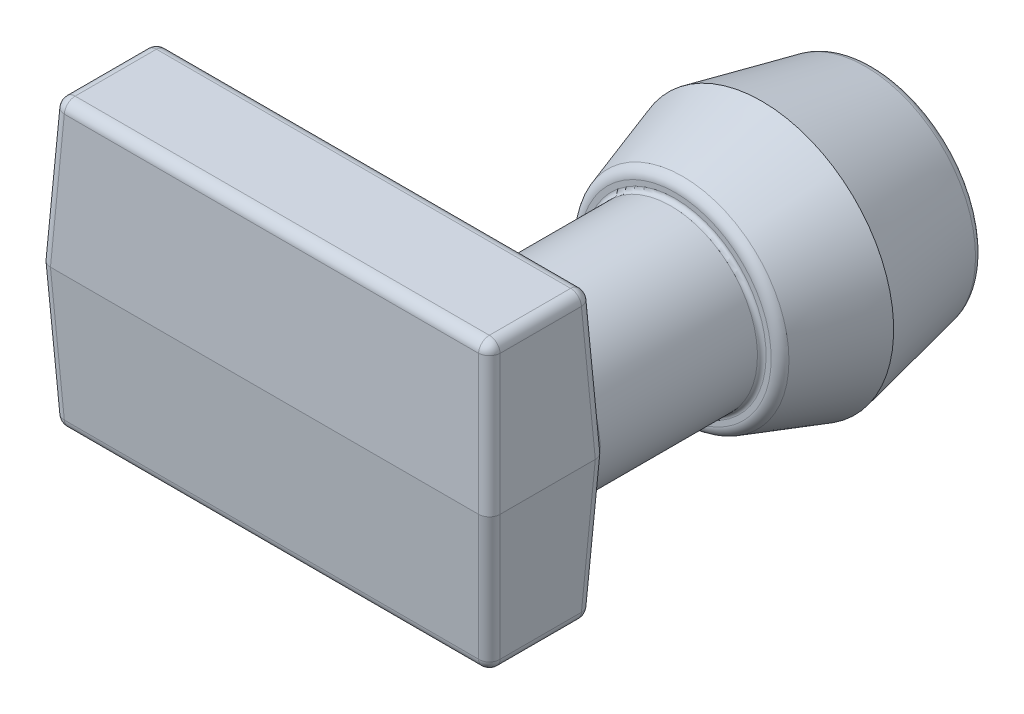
ISO-10303-21;
HEADER;
FILE_DESCRIPTION(('STEP AP214'),'2;1');
FILE_NAME('part.step','',(''),(''),'','','');
FILE_SCHEMA(('AUTOMOTIVE_DESIGN { 1 0 10303 214 1 1 1 1 }'));
ENDSEC;
DATA;
#1=APPLICATION_CONTEXT('core data for automotive mechanical design processes');
#2=APPLICATION_PROTOCOL_DEFINITION('international standard','automotive_design',2000,#1);
#3=PRODUCT_CONTEXT('',#1,'mechanical');
#4=PRODUCT('Part','Part','',(#3));
#5=PRODUCT_RELATED_PRODUCT_CATEGORY('part','',(#4));
#6=PRODUCT_DEFINITION_FORMATION('','',#4);
#7=PRODUCT_DEFINITION_CONTEXT('part definition',#1,'design');
#8=PRODUCT_DEFINITION('design','',#6,#7);
#9=PRODUCT_DEFINITION_SHAPE('','',#8);
#10=(LENGTH_UNIT() NAMED_UNIT(*) SI_UNIT(.MILLI.,.METRE.));
#11=(NAMED_UNIT(*) PLANE_ANGLE_UNIT() SI_UNIT($,.RADIAN.));
#12=(NAMED_UNIT(*) SI_UNIT($,.STERADIAN.) SOLID_ANGLE_UNIT());
#13=UNCERTAINTY_MEASURE_WITH_UNIT(LENGTH_MEASURE(1.E-05),#10,'distance_accuracy_value','');
#14=(GEOMETRIC_REPRESENTATION_CONTEXT(3) GLOBAL_UNCERTAINTY_ASSIGNED_CONTEXT((#13)) GLOBAL_UNIT_ASSIGNED_CONTEXT((#10,
#11,#12)) REPRESENTATION_CONTEXT('',''));
#15=CARTESIAN_POINT('',(0.,0.,0.));
#16=DIRECTION('',(0.,0.,1.));
#17=DIRECTION('',(1.,0.,0.));
#18=AXIS2_PLACEMENT_3D('',#15,#16,#17);
#19=CARTESIAN_POINT('',(-85.0000000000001,2.0119205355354E-13,36.9999999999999));
#20=DIRECTION('',(-0.998629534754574,-0.0523359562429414,0.));
#21=DIRECTION('',(0.0523359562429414,-0.998629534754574,0.));
#22=AXIS2_PLACEMENT_3D('',#19,#20,#21);
#23=PLANE('',#22);
#24=DIRECTION('',(0.,0.,-1.));
#25=VECTOR('',#24,1.);
#26=CARTESIAN_POINT('',(-85.0000000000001,2.0119205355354E-13,36.9999999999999));
#27=LINE('',#26,#25);
#28=CARTESIAN_POINT('',(-85.0000000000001,2.02495041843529E-13,34.5034261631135));
#29=VERTEX_POINT('',#28);
#30=CARTESIAN_POINT('',(-85.0000000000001,2.13980650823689E-13,12.4965738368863));
#31=VERTEX_POINT('',#30);
#32=EDGE_CURVE('E499',#29,#31,#27,.T.);
#33=ORIENTED_EDGE('',*,*,#32,.T.);
#34=DIRECTION('',(0.0522644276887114,-0.997264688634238,0.0522644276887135));
#35=VECTOR('',#34,1.);
#36=CARTESIAN_POINT('',(-84.9330671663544,-1.27715454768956,12.563506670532));
#37=LINE('',#36,#35);
#38=CARTESIAN_POINT('',(-83.394705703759,-30.6308398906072,14.1018681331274));
#39=VERTEX_POINT('',#38);
#40=EDGE_CURVE('E217',#31,#39,#37,.T.);
#41=ORIENTED_EDGE('',*,*,#40,.T.);
#42=DIRECTION('',(0.,0.,-1.));
#43=VECTOR('',#42,1.);
#44=CARTESIAN_POINT('',(-83.394705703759,-30.6308398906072,36.9999999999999));
#45=LINE('',#44,#43);
#46=CARTESIAN_POINT('',(-83.394705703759,-30.6308398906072,32.8981318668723));
#47=VERTEX_POINT('',#46);
#48=EDGE_CURVE('E214',#39,#47,#45,.F.);
#49=ORIENTED_EDGE('',*,*,#48,.T.);
#50=DIRECTION('',(0.0522644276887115,-0.997264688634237,-0.0522644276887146));
#51=VECTOR('',#50,1.);
#52=CARTESIAN_POINT('',(-85.0068195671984,0.130125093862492,34.5102457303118));
#53=LINE('',#52,#51);
#54=EDGE_CURVE('E212',#47,#29,#53,.F.);
#55=ORIENTED_EDGE('',*,*,#54,.T.);
#56=EDGE_LOOP('',(#33,#41,#49,#55));
#57=FACE_BOUND('',#56,.T.);
#58=CARTESIAN_POINT('',(-84.3711066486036,-12.,20.));
#59=DIRECTION('',(-0.998629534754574,-0.0523359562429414,0.));
#60=DIRECTION('',(-0.0523359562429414,0.998629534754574,0.));
#61=AXIS2_PLACEMENT_3D('',#58,#59,#60);
#62=ELLIPSE('',#61,5.00686172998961,5.);
#63=CARTESIAN_POINT('',(-84.6331455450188,-7.,20.0000000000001));
#64=VERTEX_POINT('',#63);
#65=EDGE_CURVE('E369',#64,#64,#62,.T.);
#66=ORIENTED_EDGE('',*,*,#65,.F.);
#67=EDGE_LOOP('',(#66));
#68=FACE_BOUND('',#67,.T.);
#69=ADVANCED_FACE('F29',(#57,#68),#23,.T.);
#70=CARTESIAN_POINT('',(-85.0000000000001,2.15283639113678E-13,9.99999999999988));
#71=DIRECTION('',(0.,-0.0523359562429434,-0.998629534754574));
#72=DIRECTION('',(0.,0.998629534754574,-0.0523359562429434));
#73=AXIS2_PLACEMENT_3D('',#70,#71,#72);
#74=PLANE('',#73);
#75=DIRECTION('',(1.,0.,0.));
#76=VECTOR('',#75,1.);
#77=CARTESIAN_POINT('',(-85.0000000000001,2.15283639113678E-13,9.99999999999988));
#78=LINE('',#77,#76);
#79=CARTESIAN_POINT('',(-82.5034261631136,2.08807152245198E-13,9.99999999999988));
#80=VERTEX_POINT('',#79);
#81=CARTESIAN_POINT('',(-23.9999347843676,0.,9.99999999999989));
#82=VERTEX_POINT('',#81);
#83=EDGE_CURVE('E197',#80,#82,#78,.T.);
#84=ORIENTED_EDGE('',*,*,#83,.T.);
#85=CARTESIAN_POINT('',(-3.,0.0523359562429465,9.99725718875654));
#86=DIRECTION('',(0.,-0.0523359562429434,-0.998629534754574));
#87=DIRECTION('',(0.,-0.998629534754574,0.0523359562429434));
#88=AXIS2_PLACEMENT_3D('',#85,#86,#87);
#89=ELLIPSE('',#88,21.0288192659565,21.0000000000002);
#90=CARTESIAN_POINT('',(16.0421398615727,-8.80186697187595,10.4612863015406));
#91=VERTEX_POINT('',#90);
#92=EDGE_CURVE('E45',#82,#91,#89,.F.);
#93=ORIENTED_EDGE('',*,*,#92,.T.);
#94=DIRECTION('',(-0.0522644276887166,-0.997264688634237,0.0522644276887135));
#95=VECTOR('',#94,1.);
#96=CARTESIAN_POINT('',(16.2261624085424,-5.29050759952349,10.277263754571));
#97=LINE('',#96,#95);
#98=CARTESIAN_POINT('',(14.8981318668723,-30.6308398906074,11.605294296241));
#99=VERTEX_POINT('',#98);
#100=EDGE_CURVE('E203',#91,#99,#97,.T.);
#101=ORIENTED_EDGE('',*,*,#100,.T.);
#102=DIRECTION('',(1.,0.,0.));
#103=VECTOR('',#102,1.);
#104=CARTESIAN_POINT('',(-85.0000000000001,-30.6308398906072,11.605294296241));
#105=LINE('',#104,#103);
#106=CARTESIAN_POINT('',(-80.8981318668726,-30.6308398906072,11.605294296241));
#107=VERTEX_POINT('',#106);
#108=EDGE_CURVE('E173',#99,#107,#105,.F.);
#109=ORIENTED_EDGE('',*,*,#108,.T.);
#110=DIRECTION('',(0.0522644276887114,-0.997264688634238,0.0522644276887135));
#111=VECTOR('',#110,1.);
#112=CARTESIAN_POINT('',(-82.510245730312,0.130125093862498,9.99318043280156));
#113=LINE('',#112,#111);
#114=EDGE_CURVE('E210',#107,#80,#113,.F.);
#115=ORIENTED_EDGE('',*,*,#114,.T.);
#116=EDGE_LOOP('',(#84,#93,#101,#109,#115));
#117=FACE_BOUND('',#116,.T.);
#118=ADVANCED_FACE('F389',(#117),#74,.T.);
#119=CARTESIAN_POINT('',(-85.0000000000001,2.15283639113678E-13,9.99999999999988));
#120=DIRECTION('',(0.,0.0523359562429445,-0.998629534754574));
#121=DIRECTION('',(0.,0.998629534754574,0.0523359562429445));
#122=AXIS2_PLACEMENT_3D('',#119,#120,#121);
#123=PLANE('',#122);
#124=DIRECTION('',(0.0522644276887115,-0.997264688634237,-0.0522644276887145));
#125=VECTOR('',#124,1.);
#126=CARTESIAN_POINT('',(16.2261624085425,5.2905075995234,10.277263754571));
#127=LINE('',#126,#125);
#128=CARTESIAN_POINT('',(14.8981318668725,30.6308398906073,11.605294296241));
#129=VERTEX_POINT('',#128);
#130=CARTESIAN_POINT('',(16.0421398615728,8.80186697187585,10.4612863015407));
#131=VERTEX_POINT('',#130);
#132=EDGE_CURVE('E255',#129,#131,#127,.T.);
#133=ORIENTED_EDGE('',*,*,#132,.T.);
#134=CARTESIAN_POINT('',(-3.,-0.0523359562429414,9.99725718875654));
#135=DIRECTION('',(0.,0.0523359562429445,-0.998629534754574));
#136=DIRECTION('',(0.,0.998629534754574,0.0523359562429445));
#137=AXIS2_PLACEMENT_3D('',#134,#135,#136);
#138=ELLIPSE('',#137,21.0288192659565,21.0000000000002);
#139=EDGE_CURVE('E53',#131,#82,#138,.F.);
#140=ORIENTED_EDGE('',*,*,#139,.T.);
#141=ORIENTED_EDGE('',*,*,#83,.F.);
#142=DIRECTION('',(-0.0522644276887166,-0.997264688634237,-0.0522644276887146));
#143=VECTOR('',#142,1.);
#144=CARTESIAN_POINT('',(-82.510245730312,-0.13012509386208,9.99318043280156));
#145=LINE('',#144,#143);
#146=CARTESIAN_POINT('',(-80.8981318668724,30.6308398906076,11.605294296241));
#147=VERTEX_POINT('',#146);
#148=EDGE_CURVE('E259',#80,#147,#145,.F.);
#149=ORIENTED_EDGE('',*,*,#148,.T.);
#150=DIRECTION('',(1.,0.,0.));
#151=VECTOR('',#150,1.);
#152=CARTESIAN_POINT('',(-85.,30.6308398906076,11.605294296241));
#153=LINE('',#152,#151);
#154=EDGE_CURVE('E257',#147,#129,#153,.T.);
#155=ORIENTED_EDGE('',*,*,#154,.T.);
#156=EDGE_LOOP('',(#133,#140,#141,#149,#155));
#157=FACE_BOUND('',#156,.T.);
#158=ADVANCED_FACE('F394',(#157),#123,.T.);
#159=CARTESIAN_POINT('',(16.2261624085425,5.15966770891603,12.7738375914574));
#160=DIRECTION('',(0.0522644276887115,-0.997264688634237,-0.0522644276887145));
#161=DIRECTION('',(0.,0.0523359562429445,-0.998629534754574));
#162=AXIS2_PLACEMENT_3D('',#159,#160,#161);
#163=CYLINDRICAL_SURFACE('',#162,2.5);
#164=CARTESIAN_POINT('',(16.4965691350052,0.,12.5034308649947));
#165=DIRECTION('',(0.,-1.,0.));
#166=DIRECTION('',(0.707106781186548,0.,-0.707106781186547));
#167=AXIS2_PLACEMENT_3D('',#164,#165,#166);
#168=ELLIPSE('',#167,2.50685703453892,2.5);
#169=CARTESIAN_POINT('',(17.5729722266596,0.,10.2402869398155));
#170=VERTEX_POINT('',#169);
#171=CARTESIAN_POINT('',(19.,0.,12.4965738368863));
#172=VERTEX_POINT('',#171);
#173=EDGE_CURVE('E432',#170,#172,#168,.T.);
#174=ORIENTED_EDGE('',*,*,#173,.F.);
#175=CARTESIAN_POINT('',(13.3594404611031,11.5051600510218,10.0685661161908));
#176=CARTESIAN_POINT('',(13.6341209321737,11.1145858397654,11.4876977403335));
#177=CARTESIAN_POINT('',(14.6602192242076,12.0598386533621,10.9440512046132));
#178=CARTESIAN_POINT('',(13.4312829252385,11.4030127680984,10.0244608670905));
#179=CARTESIAN_POINT('',(13.6844118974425,11.037966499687,11.4267315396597));
#180=CARTESIAN_POINT('',(14.7157915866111,11.9509712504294,10.910856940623));
#181=CARTESIAN_POINT('',(13.5027340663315,11.2993738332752,9.98360643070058));
#182=CARTESIAN_POINT('',(13.737039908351,10.9569333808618,11.3678705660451));
#183=CARTESIAN_POINT('',(14.7710909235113,11.8405945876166,10.8799642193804));
#184=CARTESIAN_POINT('',(13.6445081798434,11.0894700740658,9.90779906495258));
#185=CARTESIAN_POINT('',(13.8446640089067,10.7887814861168,11.2560897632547));
#186=CARTESIAN_POINT('',(14.8808790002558,11.6171939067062,10.8223586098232));
#187=CARTESIAN_POINT('',(13.7148316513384,10.9832064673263,9.87284345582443));
#188=CARTESIAN_POINT('',(13.8996447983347,10.7017418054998,11.2029914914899));
#189=CARTESIAN_POINT('',(14.9353680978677,11.5041711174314,10.7956438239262));
#190=CARTESIAN_POINT('',(13.9234264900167,10.6612800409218,9.77599273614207));
#191=CARTESIAN_POINT('',(14.0647974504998,10.4358452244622,11.0540958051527));
#192=CARTESIAN_POINT('',(15.0970945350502,11.161972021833,10.7211844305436));
#193=CARTESIAN_POINT('',(14.0595970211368,10.4420919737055,9.72195124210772));
#194=CARTESIAN_POINT('',(14.1790162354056,10.2464202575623,10.9643166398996));
#195=CARTESIAN_POINT('',(15.2028035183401,10.9292497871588,10.6790022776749));
#196=CARTESIAN_POINT('',(14.3235515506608,9.99804248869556,9.63107248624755));
#197=CARTESIAN_POINT('',(14.4066854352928,9.85318435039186,10.8061359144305));
#198=CARTESIAN_POINT('',(15.4079999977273,10.4582449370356,10.6068582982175));
#199=CARTESIAN_POINT('',(14.4513914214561,9.77323684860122,9.59410759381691));
#200=CARTESIAN_POINT('',(14.5204410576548,9.64952560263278,10.7366211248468));
#201=CARTESIAN_POINT('',(15.5075286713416,10.2200180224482,10.5768060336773));
#202=CARTESIAN_POINT('',(14.698879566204,9.31755804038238,9.53334538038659));
#203=CARTESIAN_POINT('',(14.7445355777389,9.23018102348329,10.61479035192));
#204=CARTESIAN_POINT('',(15.7005202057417,9.73752740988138,10.5260290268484));
#205=CARTESIAN_POINT('',(14.8185265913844,9.08668395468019,9.50955006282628));
#206=CARTESIAN_POINT('',(14.8553061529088,9.01426542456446,10.5617582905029));
#207=CARTESIAN_POINT('',(15.7939821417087,9.49326279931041,10.505305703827));
#208=CARTESIAN_POINT('',(14.9681341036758,8.78363258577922,9.48531172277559));
#209=CARTESIAN_POINT('',(14.9967742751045,8.72500663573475,10.5014697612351));
#210=CARTESIAN_POINT('',(15.9110679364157,9.17285526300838,10.4831124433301));
#211=CARTESIAN_POINT('',(15.0021350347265,8.71373489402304,9.48019629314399));
#212=CARTESIAN_POINT('',(15.0287455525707,8.65872741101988,10.4883448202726));
#213=CARTESIAN_POINT('',(15.9376934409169,9.09896941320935,10.4783337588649));
#214=CARTESIAN_POINT('',(15.0693491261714,8.5734866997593,9.47081106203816));
#215=CARTESIAN_POINT('',(15.0921748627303,8.52534475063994,10.4632313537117));
#216=CARTESIAN_POINT('',(15.9903593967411,8.95074791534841,10.4693746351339));
#217=CARTESIAN_POINT('',(15.1025620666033,8.5031360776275,9.46654149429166));
#218=CARTESIAN_POINT('',(15.1236448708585,8.45823086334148,10.4512308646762));
#219=CARTESIAN_POINT('',(16.0163996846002,8.87641214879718,10.4651943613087));
#220=CARTESIAN_POINT('',(15.3544805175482,7.96134236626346,9.43671346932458));
#221=CARTESIAN_POINT('',(15.3579506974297,7.95105105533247,10.3651169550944));
#222=CARTESIAN_POINT('',(16.2140399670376,8.30403341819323,10.4351871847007));
#223=CARTESIAN_POINT('',(15.555584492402,7.48068941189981,9.42793382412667));
#224=CARTESIAN_POINT('',(15.5554492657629,7.48109128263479,10.3108566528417));
#225=CARTESIAN_POINT('',(16.3725553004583,7.79686028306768,10.4212286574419));
#226=CARTESIAN_POINT('',(15.9197782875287,6.50491697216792,9.4268303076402));
#227=CARTESIAN_POINT('',(15.9136866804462,6.52119978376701,10.232253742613));
#228=CARTESIAN_POINT('',(16.661257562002,6.76818732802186,10.404883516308));
#229=CARTESIAN_POINT('',(16.0828231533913,6.00978114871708,9.43452578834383));
#230=CARTESIAN_POINT('',(16.0775077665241,6.02724399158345,10.2064537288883));
#231=CARTESIAN_POINT('',(16.7914109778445,6.24667137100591,10.4025105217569));
#232=CARTESIAN_POINT('',(16.3702616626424,5.00658256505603,9.45157558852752));
#233=CARTESIAN_POINT('',(16.3653323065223,5.02484892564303,10.1674289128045));
#234=CARTESIAN_POINT('',(17.022898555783,5.19071643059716,10.3987802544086));
#235=CARTESIAN_POINT('',(16.4945280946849,4.4984830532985,9.46093521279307));
#236=CARTESIAN_POINT('',(16.4916222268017,4.51198442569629,10.1537283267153));
#237=CARTESIAN_POINT('',(17.1241377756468,4.65624098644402,10.3974263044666));
#238=CARTESIAN_POINT('',(16.6507580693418,3.73041528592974,9.46706437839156));
#239=CARTESIAN_POINT('',(16.6500526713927,3.73427070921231,10.1327137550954));
#240=CARTESIAN_POINT('',(17.2534433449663,3.84867704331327,10.3896711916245));
#241=CARTESIAN_POINT('',(16.6977998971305,3.47345954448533,9.46778971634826));
#242=CARTESIAN_POINT('',(16.6976791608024,3.47444448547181,10.1256547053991));
#243=CARTESIAN_POINT('',(17.2927805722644,3.57856988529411,10.3861334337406));
#244=CARTESIAN_POINT('',(16.7817808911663,2.9579245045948,9.46547116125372));
#245=CARTESIAN_POINT('',(16.7825304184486,2.95308116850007,10.1102165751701));
#246=CARTESIAN_POINT('',(17.3638980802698,3.03675533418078,10.3763455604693));
#247=CARTESIAN_POINT('',(16.8187210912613,2.69934537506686,9.46242765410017));
#248=CARTESIAN_POINT('',(16.8199149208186,2.69096014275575,10.101827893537));
#249=CARTESIAN_POINT('',(17.3956791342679,2.76504810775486,10.3700957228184));
#250=CARTESIAN_POINT('',(16.8823676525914,2.18159232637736,9.45170407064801));
#251=CARTESIAN_POINT('',(16.8840909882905,2.16625454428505,10.082878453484));
#252=CARTESIAN_POINT('',(17.4515703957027,2.22110107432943,10.3542796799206));
#253=CARTESIAN_POINT('',(16.909096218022,1.92242094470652,9.44403414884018));
#254=CARTESIAN_POINT('',(16.9110163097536,1.90308305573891,10.0723090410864));
#255=CARTESIAN_POINT('',(17.4756972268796,1.94886373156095,10.3447207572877));
#256=CARTESIAN_POINT('',(16.952399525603,1.40341084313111,9.42357981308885));
#257=CARTESIAN_POINT('',(16.9543469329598,1.37640016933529,10.048515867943));
#258=CARTESIAN_POINT('',(17.5163416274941,1.40377204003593,10.3219435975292));
#259=CARTESIAN_POINT('',(16.9689742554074,1.14357212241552,9.41079539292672));
#260=CARTESIAN_POINT('',(16.9708158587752,1.11229116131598,10.0352687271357));
#261=CARTESIAN_POINT('',(17.5328591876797,1.13091769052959,10.3087253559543));
#262=CARTESIAN_POINT('',(16.9919709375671,0.623589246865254,9.38002384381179));
#263=CARTESIAN_POINT('',(16.9932502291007,0.584287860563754,10.0060553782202));
#264=CARTESIAN_POINT('',(17.558280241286,0.584970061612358,10.2785721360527));
#265=CARTESIAN_POINT('',(16.9983875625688,0.363445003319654,9.36203399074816));
#266=CARTESIAN_POINT('',(16.9992262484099,0.319791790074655,9.99005197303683));
#267=CARTESIAN_POINT('',(17.5671797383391,0.311876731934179,10.2616352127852));
#268=CARTESIAN_POINT('',(17.0010773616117,-0.156549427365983,9.32118982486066));
#269=CARTESIAN_POINT('',(17.0007296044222,-0.208186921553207,9.9556915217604));
#270=CARTESIAN_POINT('',(17.5773620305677,-0.23391548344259,10.2242958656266));
#271=CARTESIAN_POINT('',(16.9973504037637,-0.416399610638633,9.29833544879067));
#272=CARTESIAN_POINT('',(16.9962250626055,-0.47227225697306,9.93728747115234));
#273=CARTESIAN_POINT('',(17.578644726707,-0.506614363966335,10.2038933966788));
#274=CARTESIAN_POINT('',(16.9797693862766,-0.936336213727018,9.24838731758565));
#275=CARTESIAN_POINT('',(16.9768533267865,-0.999773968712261,9.89880205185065));
#276=CARTESIAN_POINT('',(17.5736134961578,-1.05216456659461,10.1600616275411));
#277=CARTESIAN_POINT('',(16.965878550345,-1.19642005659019,9.22127844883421));
#278=CARTESIAN_POINT('',(16.9618682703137,-1.2637853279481,9.87866131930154));
#279=CARTESIAN_POINT('',(17.5672719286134,-1.32501283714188,10.1366215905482));
#280=CARTESIAN_POINT('',(16.9279866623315,-1.71554120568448,9.16393352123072));
#281=CARTESIAN_POINT('',(16.9216666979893,-1.78960131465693,9.83785480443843));
#282=CARTESIAN_POINT('',(17.5469839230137,-1.86950071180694,10.0875300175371));
#283=CARTESIAN_POINT('',(16.9039852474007,-1.97457847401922,9.13369735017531));
#284=CARTESIAN_POINT('',(16.8963204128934,-2.05200982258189,9.81713656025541));
#285=CARTESIAN_POINT('',(17.5330372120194,-2.1411402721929,10.061878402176));
#286=CARTESIAN_POINT('',(16.8459525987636,-2.49111758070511,9.07142356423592));
#287=CARTESIAN_POINT('',(16.8356112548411,-2.5738658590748,9.77656676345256));
#288=CARTESIAN_POINT('',(17.4975906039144,-2.68267970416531,10.0093192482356));
#289=CARTESIAN_POINT('',(16.8119292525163,-2.74862046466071,9.03938738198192));
#290=CARTESIAN_POINT('',(16.800077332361,-2.83391673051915,9.75667450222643));
#291=CARTESIAN_POINT('',(17.476096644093,-2.95258077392,9.98241271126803));
#292=CARTESIAN_POINT('',(16.7338902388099,-3.26205011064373,8.97504274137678));
#293=CARTESIAN_POINT('',(16.7192880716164,-3.35070632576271,9.71936310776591));
#294=CARTESIAN_POINT('',(17.4255818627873,-3.49057837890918,9.92843777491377));
#295=CARTESIAN_POINT('',(16.6898755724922,-3.51797702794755,8.94273431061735));
#296=CARTESIAN_POINT('',(16.6738052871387,-3.60804138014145,9.70193020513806));
#297=CARTESIAN_POINT('',(17.3965617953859,-3.75867509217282,9.90136939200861));
#298=CARTESIAN_POINT('',(16.6408840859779,-3.77301899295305,8.91106169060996));
#299=CARTESIAN_POINT('',(16.6239044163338,-3.86140861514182,9.6867507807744));
#300=CARTESIAN_POINT('',(17.3637907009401,-4.02575676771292,9.87477357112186));
#301=(BOUNDED_SURFACE() B_SPLINE_SURFACE(3,2,((#175,#176,#177),(#178,#179,#180),(#181,#182,
#183),(#184,#185,#186),(#187,#188,#189),(#190,#191,#192),(#193,#194,#195),(#196,#197,#198),
(#199,#200,#201),(#202,#203,#204),(#205,#206,#207),(#208,#209,#210),(#211,#212,#213),(#214,#215,
#216),(#217,#218,#219),(#220,#221,#222),(#223,#224,#225),(#226,#227,#228),(#229,#230,#231),
(#232,#233,#234),(#235,#236,#237),(#238,#239,#240),(#241,#242,#243),(#244,#245,#246),(#247,#248,
#249),(#250,#251,#252),(#253,#254,#255),(#256,#257,#258),(#259,#260,#261),(#262,#263,#264),
(#265,#266,#267),(#268,#269,#270),(#271,#272,#273),(#274,#275,#276),(#277,#278,#279),(#280,#281,
#282),(#283,#284,#285),(#286,#287,#288),(#289,#290,#291),(#292,#293,#294),(#295,#296,#297),
(#298,#299,#300)),.UNSPECIFIED.,.F.,.F.,.F.) B_SPLINE_SURFACE_WITH_KNOTS((4,2,2,2,2,2,2,2,2,2,2,
2,2,2,2,2,2,2,2,2,4),(3,3),(0.,0.414912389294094,0.829635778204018,1.65750948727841,
2.4790913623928,3.30079818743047,3.54611875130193,3.79150700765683,5.43027845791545,
7.07097589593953,8.71700034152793,9.53967544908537,10.3622663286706,11.18305824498,
12.0038511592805,12.8250743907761,13.6463083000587,14.4705284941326,15.2947782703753,
16.1183810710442,16.9419013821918),(0.,1.),
.UNSPECIFIED.) GEOMETRIC_REPRESENTATION_ITEM() RATIONAL_B_SPLINE_SURFACE(((1.,0.555389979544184,
1.),(1.,0.56229254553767,1.),(1.,0.569090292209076,1.),(1.,0.582460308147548,1.),(1.,
0.589032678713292,1.),(1.,0.608372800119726,1.),(1.,0.620789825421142,1.),(1.,0.644536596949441,
1.),(1.,0.655873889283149,1.),(1.,0.677557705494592,1.),(1.,0.687904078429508,1.),(1.,
0.700692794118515,1.),(1.,0.703588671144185,1.),(1.,0.709292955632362,1.),(1.,0.712101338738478,
1.),(1.,0.733327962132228,1.),(1.,0.749833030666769,1.),(1.,0.778995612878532,1.),(1.,
0.791648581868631,1.),(1.,0.813176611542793,1.),(1.,0.82203927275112,1.),(1.,0.832451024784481,
1.),(1.,0.835440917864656,1.),(1.,0.840459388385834,1.),(1.,0.842488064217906,1.),(1.,
0.845577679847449,1.),(1.,0.846640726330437,1.),(1.,0.847803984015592,1.),(1.,0.847904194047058,
1.),(1.,0.847139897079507,1.),(1.,0.84627488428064,1.),(1.,0.843578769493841,1.),(1.,
0.841747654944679,1.),(1.,0.837110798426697,1.),(1.,0.834301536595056,1.),(1.,0.827708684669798,
1.),(1.,0.823925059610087,1.),(1.,0.815384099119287,1.),(1.,0.810627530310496,1.),(1.,
0.800132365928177,1.),(1.,0.794393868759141,1.),(1.,0.78816068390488,1.))) REPRESENTATION_ITEM('') SURFACE());
#302=CARTESIAN_POINT('',(17.3637907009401,-4.02575676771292,9.87477357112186));
#303=CARTESIAN_POINT('',(17.3965617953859,-3.75867509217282,9.90136939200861));
#304=CARTESIAN_POINT('',(17.4255818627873,-3.49057837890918,9.92843777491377));
#305=CARTESIAN_POINT('',(17.476096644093,-2.95258077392,9.98241271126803));
#306=CARTESIAN_POINT('',(17.4975906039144,-2.68267970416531,10.0093192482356));
#307=CARTESIAN_POINT('',(17.5330372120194,-2.1411402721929,10.061878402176));
#308=CARTESIAN_POINT('',(17.5469839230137,-1.86950071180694,10.0875300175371));
#309=CARTESIAN_POINT('',(17.5672719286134,-1.32501283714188,10.1366215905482));
#310=CARTESIAN_POINT('',(17.5736134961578,-1.05216456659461,10.1600616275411));
#311=CARTESIAN_POINT('',(17.578644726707,-0.506614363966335,10.2038933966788));
#312=CARTESIAN_POINT('',(17.5773620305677,-0.23391548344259,10.2242958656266));
#313=CARTESIAN_POINT('',(17.5671797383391,0.311876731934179,10.2616352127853));
#314=CARTESIAN_POINT('',(17.558280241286,0.584970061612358,10.2785721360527));
#315=CARTESIAN_POINT('',(17.5328591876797,1.13091769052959,10.3087253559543));
#316=CARTESIAN_POINT('',(17.5163416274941,1.40377204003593,10.3219435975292));
#317=CARTESIAN_POINT('',(17.4756972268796,1.94886373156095,10.3447207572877));
#318=CARTESIAN_POINT('',(17.4515703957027,2.22110107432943,10.3542796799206));
#319=CARTESIAN_POINT('',(17.3956791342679,2.76504810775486,10.3700957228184));
#320=CARTESIAN_POINT('',(17.3638980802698,3.03675533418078,10.3763455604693));
#321=CARTESIAN_POINT('',(17.2927805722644,3.57856988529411,10.3861334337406));
#322=CARTESIAN_POINT('',(17.2534433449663,3.84867704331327,10.3896711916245));
#323=CARTESIAN_POINT('',(17.1241377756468,4.65624098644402,10.3974263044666));
#324=CARTESIAN_POINT('',(17.022898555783,5.19071643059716,10.3987802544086));
#325=CARTESIAN_POINT('',(16.7914109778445,6.24667137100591,10.4025105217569));
#326=CARTESIAN_POINT('',(16.661257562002,6.76818732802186,10.404883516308));
#327=CARTESIAN_POINT('',(16.3725553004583,7.79686028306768,10.4212286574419));
#328=CARTESIAN_POINT('',(16.2140399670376,8.30403341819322,10.4351871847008));
#329=CARTESIAN_POINT('',(16.0163996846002,8.87641214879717,10.4651943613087));
#330=CARTESIAN_POINT('',(15.9903593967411,8.95074791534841,10.4693746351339));
#331=CARTESIAN_POINT('',(15.9376934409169,9.09896941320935,10.4783337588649));
#332=CARTESIAN_POINT('',(15.9110679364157,9.17285526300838,10.4831124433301));
#333=CARTESIAN_POINT('',(15.7939821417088,9.49326279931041,10.505305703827));
#334=CARTESIAN_POINT('',(15.7005202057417,9.73752740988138,10.5260290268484));
#335=CARTESIAN_POINT('',(15.5075286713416,10.2200180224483,10.5768060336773));
#336=CARTESIAN_POINT('',(15.4079999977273,10.4582449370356,10.6068582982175));
#337=CARTESIAN_POINT('',(15.2028035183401,10.9292497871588,10.6790022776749));
#338=CARTESIAN_POINT('',(15.0970945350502,11.161972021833,10.7211844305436));
#339=CARTESIAN_POINT('',(14.9353680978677,11.5041711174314,10.7956438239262));
#340=CARTESIAN_POINT('',(14.8808790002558,11.6171939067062,10.8223586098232));
#341=CARTESIAN_POINT('',(14.7710909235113,11.8405945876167,10.8799642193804));
#342=CARTESIAN_POINT('',(14.7157915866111,11.9509712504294,10.910856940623));
#343=CARTESIAN_POINT('',(14.6602192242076,12.0598386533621,10.9440512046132));
#344=B_SPLINE_CURVE_WITH_KNOTS('',3,(#302,#303,#304,#305,#306,#307,#308,#309,#310,#311,#312,
#313,#314,#315,#316,#317,#318,#319,#320,#321,#322,#323,#324,#325,#326,#327,#328,#329,#330,#331,
#332,#333,#334,#335,#336,#337,#338,#339,#340,#341,#342,#343),.UNSPECIFIED.,.F.,.F.,(4,2,2,2,2,2,
2,2,2,2,2,2,2,2,2,2,2,2,2,2,4),(0.,0.823520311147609,1.64712311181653,2.47137288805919,
3.29559308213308,4.11682699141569,4.9380502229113,5.75884313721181,6.57963505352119,
7.40222593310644,8.22490104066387,9.87092548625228,11.5116229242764,13.150394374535,
13.3957826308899,13.6411031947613,14.462810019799,15.2843918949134,16.1122656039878,
16.5269889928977,16.9419013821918),.UNSPECIFIED.);
#345=EDGE_CURVE('E273',#170,#131,#344,.T.);
#346=ORIENTED_EDGE('',*,*,#345,.T.);
#347=ORIENTED_EDGE('',*,*,#132,.F.);
#348=CARTESIAN_POINT('',(14.8981318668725,30.5,14.1018681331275));
#349=DIRECTION('',(-0.052264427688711,0.997264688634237,0.0522644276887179));
#350=DIRECTION('',(0.,-0.0523359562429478,0.998629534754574));
#351=AXIS2_PLACEMENT_3D('',#348,#349,#350);
#352=CIRCLE('',#351,2.5);
#353=CARTESIAN_POINT('',(17.3947057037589,30.6308398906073,14.1018681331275));
#354=VERTEX_POINT('',#353);
#355=EDGE_CURVE('E440',#129,#354,#352,.F.);
#356=ORIENTED_EDGE('',*,*,#355,.T.);
#357=DIRECTION('',(0.0522644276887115,-0.997264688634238,-0.0522644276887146));
#358=VECTOR('',#357,1.);
#359=CARTESIAN_POINT('',(19.0068195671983,-0.130125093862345,12.489754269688));
#360=LINE('',#359,#358);
#361=EDGE_CURVE('E261',#172,#354,#360,.F.);
#362=ORIENTED_EDGE('',*,*,#361,.F.);
#363=EDGE_LOOP('',(#174,#346,#347,#356,#362));
#364=FACE_BOUND('',#363,.T.);
#365=ADVANCED_FACE('F283',(#364),#163,.T.);
#366=CARTESIAN_POINT('',(16.5102457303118,0.2609649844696,12.489754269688));
#367=DIRECTION('',(0.0522644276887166,0.997264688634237,-0.0522644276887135));
#368=DIRECTION('',(-0.998629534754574,0.0523359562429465,0.));
#369=AXIS2_PLACEMENT_3D('',#366,#367,#368);
#370=CYLINDRICAL_SURFACE('',#369,2.5);
#371=ORIENTED_EDGE('',*,*,#100,.F.);
#372=CARTESIAN_POINT('',(14.6602192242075,-12.0598386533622,10.9440512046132));
#373=CARTESIAN_POINT('',(13.6341209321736,-11.1145858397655,11.4876977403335));
#374=CARTESIAN_POINT('',(13.3594404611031,-11.5051600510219,10.0685661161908));
#375=CARTESIAN_POINT('',(14.715791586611,-11.9509712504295,10.910856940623));
#376=CARTESIAN_POINT('',(13.6844118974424,-11.0379664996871,11.4267315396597));
#377=CARTESIAN_POINT('',(13.4312829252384,-11.4030127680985,10.0244608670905));
#378=CARTESIAN_POINT('',(14.7710909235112,-11.8405945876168,10.8799642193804));
#379=CARTESIAN_POINT('',(13.7370399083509,-10.9569333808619,11.3678705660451));
#380=CARTESIAN_POINT('',(13.5027340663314,-11.2993738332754,9.98360643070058));
#381=CARTESIAN_POINT('',(14.8808790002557,-11.6171939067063,10.8223586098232));
#382=CARTESIAN_POINT('',(13.8446640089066,-10.7887814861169,11.2560897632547));
#383=CARTESIAN_POINT('',(13.6445081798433,-11.0894700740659,9.90779906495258));
#384=CARTESIAN_POINT('',(14.9353680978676,-11.5041711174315,10.7956438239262));
#385=CARTESIAN_POINT('',(13.8996447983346,-10.7017418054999,11.2029914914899));
#386=CARTESIAN_POINT('',(13.7148316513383,-10.9832064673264,9.87284345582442));
#387=CARTESIAN_POINT('',(15.0970945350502,-11.1619720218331,10.7211844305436));
#388=CARTESIAN_POINT('',(14.0647974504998,-10.4358452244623,11.0540958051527));
#389=CARTESIAN_POINT('',(13.9234264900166,-10.6612800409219,9.77599273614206));
#390=CARTESIAN_POINT('',(15.20280351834,-10.929249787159,10.6790022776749));
#391=CARTESIAN_POINT('',(14.1790162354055,-10.2464202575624,10.9643166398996));
#392=CARTESIAN_POINT('',(14.0595970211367,-10.4420919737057,9.72195124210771));
#393=CARTESIAN_POINT('',(15.4079999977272,-10.4582449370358,10.6068582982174));
#394=CARTESIAN_POINT('',(14.4066854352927,-9.85318435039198,10.8061359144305));
#395=CARTESIAN_POINT('',(14.3235515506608,-9.99804248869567,9.63107248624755));
#396=CARTESIAN_POINT('',(15.5075286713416,-10.2200180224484,10.5768060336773));
#397=CARTESIAN_POINT('',(14.5204410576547,-9.6495256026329,10.7366211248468));
#398=CARTESIAN_POINT('',(14.451391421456,-9.77323684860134,9.59410759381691));
#399=CARTESIAN_POINT('',(15.7005202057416,-9.73752740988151,10.5260290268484));
#400=CARTESIAN_POINT('',(14.7445355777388,-9.23018102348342,10.61479035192));
#401=CARTESIAN_POINT('',(14.698879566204,-9.31755804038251,9.53334538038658));
#402=CARTESIAN_POINT('',(15.7939821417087,-9.49326279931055,10.505305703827));
#403=CARTESIAN_POINT('',(14.8553061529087,-9.01426542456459,10.5617582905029));
#404=CARTESIAN_POINT('',(14.8185265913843,-9.08668395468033,9.50955006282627));
#405=CARTESIAN_POINT('',(15.9110679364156,-9.1728552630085,10.4831124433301));
#406=CARTESIAN_POINT('',(14.9967742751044,-8.72500663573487,10.5014697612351));
#407=CARTESIAN_POINT('',(14.9681341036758,-8.78363258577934,9.48531172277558));
#408=CARTESIAN_POINT('',(15.9376934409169,-9.09896941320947,10.4783337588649));
#409=CARTESIAN_POINT('',(15.0287455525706,-8.65872741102,10.4883448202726));
#410=CARTESIAN_POINT('',(15.0021350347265,-8.71373489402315,9.48019629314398));
#411=CARTESIAN_POINT('',(15.990359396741,-8.95074791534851,10.4693746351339));
#412=CARTESIAN_POINT('',(15.0921748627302,-8.52534475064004,10.4632313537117));
#413=CARTESIAN_POINT('',(15.0693491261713,-8.57348669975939,9.47081106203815));
#414=CARTESIAN_POINT('',(16.0163996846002,-8.87641214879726,10.4651943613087));
#415=CARTESIAN_POINT('',(15.1236448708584,-8.45823086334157,10.4512308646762));
#416=CARTESIAN_POINT('',(15.1025620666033,-8.50313607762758,9.46654149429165));
#417=CARTESIAN_POINT('',(16.2140399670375,-8.30403341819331,10.4351871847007));
#418=CARTESIAN_POINT('',(15.3579506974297,-7.95105105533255,10.3651169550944));
#419=CARTESIAN_POINT('',(15.3544805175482,-7.96134236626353,9.43671346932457));
#420=CARTESIAN_POINT('',(16.3725553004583,-7.79686028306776,10.4212286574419));
#421=CARTESIAN_POINT('',(15.5554492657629,-7.48109128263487,10.3108566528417));
#422=CARTESIAN_POINT('',(15.555584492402,-7.48068941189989,9.42793382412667));
#423=CARTESIAN_POINT('',(16.6612575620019,-6.76818732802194,10.404883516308));
#424=CARTESIAN_POINT('',(15.9136866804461,-6.52119978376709,10.232253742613));
#425=CARTESIAN_POINT('',(15.9197782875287,-6.504916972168,9.4268303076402));
#426=CARTESIAN_POINT('',(16.7914109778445,-6.24667137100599,10.4025105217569));
#427=CARTESIAN_POINT('',(16.077507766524,-6.02724399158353,10.2064537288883));
#428=CARTESIAN_POINT('',(16.0828231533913,-6.00978114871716,9.43452578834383));
#429=CARTESIAN_POINT('',(17.022898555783,-5.19071643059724,10.3987802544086));
#430=CARTESIAN_POINT('',(16.3653323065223,-5.0248489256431,10.1674289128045));
#431=CARTESIAN_POINT('',(16.3702616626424,-5.00658256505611,9.45157558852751));
#432=CARTESIAN_POINT('',(17.1241377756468,-4.6562409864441,10.3974263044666));
#433=CARTESIAN_POINT('',(16.4916222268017,-4.51198442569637,10.1537283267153));
#434=CARTESIAN_POINT('',(16.4945280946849,-4.49848305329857,9.46093521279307));
#435=CARTESIAN_POINT('',(17.2534433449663,-3.84867704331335,10.3896711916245));
#436=CARTESIAN_POINT('',(16.6500526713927,-3.73427070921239,10.1327137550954));
#437=CARTESIAN_POINT('',(16.6507580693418,-3.73041528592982,9.46706437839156));
#438=CARTESIAN_POINT('',(17.2927805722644,-3.57856988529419,10.3861334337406));
#439=CARTESIAN_POINT('',(16.6976791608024,-3.47444448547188,10.1256547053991));
#440=CARTESIAN_POINT('',(16.6977998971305,-3.4734595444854,9.46778971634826));
#441=CARTESIAN_POINT('',(17.3638980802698,-3.03675533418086,10.3763455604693));
#442=CARTESIAN_POINT('',(16.7825304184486,-2.95308116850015,10.1102165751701));
#443=CARTESIAN_POINT('',(16.7817808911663,-2.95792450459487,9.46547116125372));
#444=CARTESIAN_POINT('',(17.3956791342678,-2.76504810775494,10.3700957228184));
#445=CARTESIAN_POINT('',(16.8199149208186,-2.69096014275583,10.101827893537));
#446=CARTESIAN_POINT('',(16.8187210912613,-2.69934537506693,9.46242765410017));
#447=CARTESIAN_POINT('',(17.4515703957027,-2.22110107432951,10.3542796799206));
#448=CARTESIAN_POINT('',(16.8840909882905,-2.16625454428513,10.082878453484));
#449=CARTESIAN_POINT('',(16.8823676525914,-2.18159232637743,9.45170407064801));
#450=CARTESIAN_POINT('',(17.4756972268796,-1.94886373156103,10.3447207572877));
#451=CARTESIAN_POINT('',(16.9110163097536,-1.90308305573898,10.0723090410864));
#452=CARTESIAN_POINT('',(16.9090962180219,-1.92242094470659,9.44403414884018));
#453=CARTESIAN_POINT('',(17.5163416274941,-1.40377204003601,10.3219435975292));
#454=CARTESIAN_POINT('',(16.9543469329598,-1.37640016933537,10.048515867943));
#455=CARTESIAN_POINT('',(16.952399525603,-1.40341084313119,9.42357981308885));
#456=CARTESIAN_POINT('',(17.5328591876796,-1.13091769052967,10.3087253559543));
#457=CARTESIAN_POINT('',(16.9708158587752,-1.11229116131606,10.0352687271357));
#458=CARTESIAN_POINT('',(16.9689742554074,-1.14357212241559,9.41079539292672));
#459=CARTESIAN_POINT('',(17.558280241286,-0.584970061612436,10.2785721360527));
#460=CARTESIAN_POINT('',(16.9932502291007,-0.58428786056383,10.0060553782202));
#461=CARTESIAN_POINT('',(16.9919709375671,-0.623589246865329,9.38002384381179));
#462=CARTESIAN_POINT('',(17.5671797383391,-0.311876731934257,10.2616352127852));
#463=CARTESIAN_POINT('',(16.9992262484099,-0.31979179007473,9.99005197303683));
#464=CARTESIAN_POINT('',(16.9983875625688,-0.363445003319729,9.36203399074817));
#465=CARTESIAN_POINT('',(17.5773620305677,0.233915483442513,10.2242958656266));
#466=CARTESIAN_POINT('',(17.0007296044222,0.208186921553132,9.9556915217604));
#467=CARTESIAN_POINT('',(17.0010773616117,0.156549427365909,9.32118982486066));
#468=CARTESIAN_POINT('',(17.578644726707,0.506614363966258,10.2038933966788));
#469=CARTESIAN_POINT('',(16.9962250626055,0.472272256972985,9.93728747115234));
#470=CARTESIAN_POINT('',(16.9973504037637,0.416399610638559,9.29833544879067));
#471=CARTESIAN_POINT('',(17.5736134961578,1.05216456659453,10.1600616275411));
#472=CARTESIAN_POINT('',(16.9768533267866,0.999773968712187,9.89880205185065));
#473=CARTESIAN_POINT('',(16.9797693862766,0.936336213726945,9.24838731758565));
#474=CARTESIAN_POINT('',(17.5672719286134,1.3250128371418,10.1366215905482));
#475=CARTESIAN_POINT('',(16.9618682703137,1.26378532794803,9.87866131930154));
#476=CARTESIAN_POINT('',(16.965878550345,1.19642005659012,9.22127844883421));
#477=CARTESIAN_POINT('',(17.5469839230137,1.86950071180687,10.0875300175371));
#478=CARTESIAN_POINT('',(16.9216666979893,1.78960131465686,9.83785480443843));
#479=CARTESIAN_POINT('',(16.9279866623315,1.71554120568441,9.16393352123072));
#480=CARTESIAN_POINT('',(17.5330372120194,2.14114027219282,10.061878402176));
#481=CARTESIAN_POINT('',(16.8963204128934,2.05200982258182,9.81713656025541));
#482=CARTESIAN_POINT('',(16.9039852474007,1.97457847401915,9.13369735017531));
#483=CARTESIAN_POINT('',(17.4975906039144,2.68267970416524,10.0093192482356));
#484=CARTESIAN_POINT('',(16.8356112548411,2.57386585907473,9.77656676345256));
#485=CARTESIAN_POINT('',(16.8459525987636,2.49111758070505,9.07142356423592));
#486=CARTESIAN_POINT('',(17.4760966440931,2.95258077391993,9.98241271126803));
#487=CARTESIAN_POINT('',(16.800077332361,2.83391673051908,9.75667450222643));
#488=CARTESIAN_POINT('',(16.8119292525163,2.74862046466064,9.03938738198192));
#489=CARTESIAN_POINT('',(17.4255818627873,3.49057837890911,9.92843777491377));
#490=CARTESIAN_POINT('',(16.7192880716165,3.35070632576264,9.71936310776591));
#491=CARTESIAN_POINT('',(16.7338902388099,3.26205011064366,8.97504274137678));
#492=CARTESIAN_POINT('',(17.3965617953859,3.75867509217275,9.90136939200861));
#493=CARTESIAN_POINT('',(16.6738052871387,3.60804138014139,9.70193020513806));
#494=CARTESIAN_POINT('',(16.6898755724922,3.51797702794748,8.94273431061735));
#495=CARTESIAN_POINT('',(17.3637907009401,4.02575676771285,9.87477357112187));
#496=CARTESIAN_POINT('',(16.6239044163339,3.86140861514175,9.68675078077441));
#497=CARTESIAN_POINT('',(16.640884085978,3.77301899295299,8.91106169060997));
#498=(BOUNDED_SURFACE() B_SPLINE_SURFACE(3,2,((#372,#373,#374),(#375,#376,#377),(#378,#379,
#380),(#381,#382,#383),(#384,#385,#386),(#387,#388,#389),(#390,#391,#392),(#393,#394,#395),
(#396,#397,#398),(#399,#400,#401),(#402,#403,#404),(#405,#406,#407),(#408,#409,#410),(#411,#412,
#413),(#414,#415,#416),(#417,#418,#419),(#420,#421,#422),(#423,#424,#425),(#426,#427,#428),
(#429,#430,#431),(#432,#433,#434),(#435,#436,#437),(#438,#439,#440),(#441,#442,#443),(#444,#445,
#446),(#447,#448,#449),(#450,#451,#452),(#453,#454,#455),(#456,#457,#458),(#459,#460,#461),
(#462,#463,#464),(#465,#466,#467),(#468,#469,#470),(#471,#472,#473),(#474,#475,#476),(#477,#478,
#479),(#480,#481,#482),(#483,#484,#485),(#486,#487,#488),(#489,#490,#491),(#492,#493,#494),
(#495,#496,#497)),.UNSPECIFIED.,.F.,.F.,.F.) B_SPLINE_SURFACE_WITH_KNOTS((4,2,2,2,2,2,2,2,2,2,2,
2,2,2,2,2,2,2,2,2,4),(3,3),(0.,0.414912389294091,0.82963577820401,1.6575094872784,
2.47909136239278,3.30079818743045,3.54611875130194,3.79150700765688,5.4302784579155,
7.07097589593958,8.71700034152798,9.53967544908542,10.3622663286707,11.18305824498,
12.0038511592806,12.8250743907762,13.6463083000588,14.4705284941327,15.2947782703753,
16.1183810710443,16.9419013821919),(0.,1.),
.UNSPECIFIED.) GEOMETRIC_REPRESENTATION_ITEM() RATIONAL_B_SPLINE_SURFACE(((1.,0.555389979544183,
1.),(1.,0.562292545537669,1.),(1.,0.569090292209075,1.),(1.,0.582460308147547,1.),(1.,
0.58903267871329,1.),(1.,0.608372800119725,1.),(1.,0.62078982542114,1.),(1.,0.644536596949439,
1.),(1.,0.655873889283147,1.),(1.,0.67755770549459,1.),(1.,0.687904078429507,1.),(1.,
0.700692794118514,1.),(1.,0.703588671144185,1.),(1.,0.709292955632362,1.),(1.,0.712101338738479,
1.),(1.,0.733327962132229,1.),(1.,0.749833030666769,1.),(1.,0.778995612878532,1.),(1.,
0.791648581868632,1.),(1.,0.813176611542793,1.),(1.,0.82203927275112,1.),(1.,0.832451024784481,
1.),(1.,0.835440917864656,1.),(1.,0.840459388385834,1.),(1.,0.842488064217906,1.),(1.,
0.845577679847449,1.),(1.,0.846640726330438,1.),(1.,0.847803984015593,1.),(1.,0.847904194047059,
1.),(1.,0.847139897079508,1.),(1.,0.84627488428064,1.),(1.,0.843578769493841,1.),(1.,
0.841747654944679,1.),(1.,0.837110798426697,1.),(1.,0.834301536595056,1.),(1.,0.827708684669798,
1.),(1.,0.823925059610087,1.),(1.,0.815384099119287,1.),(1.,0.810627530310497,1.),(1.,
0.800132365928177,1.),(1.,0.79439386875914,1.),(1.,0.788160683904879,1.))) REPRESENTATION_ITEM('') SURFACE());
#499=CARTESIAN_POINT('',(14.6602192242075,-12.0598386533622,10.9440512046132));
#500=CARTESIAN_POINT('',(14.715791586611,-11.9509712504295,10.910856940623));
#501=CARTESIAN_POINT('',(14.7710909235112,-11.8405945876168,10.8799642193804));
#502=CARTESIAN_POINT('',(14.8808790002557,-11.6171939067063,10.8223586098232));
#503=CARTESIAN_POINT('',(14.9353680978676,-11.5041711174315,10.7956438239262));
#504=CARTESIAN_POINT('',(15.0970945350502,-11.1619720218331,10.7211844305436));
#505=CARTESIAN_POINT('',(15.20280351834,-10.929249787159,10.6790022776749));
#506=CARTESIAN_POINT('',(15.4079999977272,-10.4582449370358,10.6068582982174));
#507=CARTESIAN_POINT('',(15.5075286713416,-10.2200180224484,10.5768060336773));
#508=CARTESIAN_POINT('',(15.7005202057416,-9.73752740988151,10.5260290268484));
#509=CARTESIAN_POINT('',(15.7939821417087,-9.49326279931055,10.505305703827));
#510=CARTESIAN_POINT('',(15.9110679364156,-9.1728552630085,10.4831124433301));
#511=CARTESIAN_POINT('',(15.9376934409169,-9.09896941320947,10.4783337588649));
#512=CARTESIAN_POINT('',(15.990359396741,-8.95074791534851,10.4693746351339));
#513=CARTESIAN_POINT('',(16.0163996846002,-8.87641214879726,10.4651943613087));
#514=CARTESIAN_POINT('',(16.2140399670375,-8.30403341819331,10.4351871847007));
#515=CARTESIAN_POINT('',(16.3725553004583,-7.79686028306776,10.4212286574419));
#516=CARTESIAN_POINT('',(16.6612575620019,-6.76818732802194,10.404883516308));
#517=CARTESIAN_POINT('',(16.7914109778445,-6.24667137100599,10.4025105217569));
#518=CARTESIAN_POINT('',(17.022898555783,-5.19071643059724,10.3987802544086));
#519=CARTESIAN_POINT('',(17.1241377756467,-4.6562409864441,10.3974263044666));
#520=CARTESIAN_POINT('',(17.2534433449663,-3.84867704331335,10.3896711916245));
#521=CARTESIAN_POINT('',(17.2927805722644,-3.57856988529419,10.3861334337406));
#522=CARTESIAN_POINT('',(17.3638980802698,-3.03675533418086,10.3763455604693));
#523=CARTESIAN_POINT('',(17.3956791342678,-2.76504810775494,10.3700957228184));
#524=CARTESIAN_POINT('',(17.4515703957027,-2.22110107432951,10.3542796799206));
#525=CARTESIAN_POINT('',(17.4756972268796,-1.94886373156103,10.3447207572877));
#526=CARTESIAN_POINT('',(17.5163416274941,-1.40377204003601,10.3219435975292));
#527=CARTESIAN_POINT('',(17.5328591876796,-1.13091769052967,10.3087253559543));
#528=CARTESIAN_POINT('',(17.558280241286,-0.584970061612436,10.2785721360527));
#529=CARTESIAN_POINT('',(17.5671797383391,-0.311876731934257,10.2616352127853));
#530=CARTESIAN_POINT('',(17.5773620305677,0.233915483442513,10.2242958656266));
#531=CARTESIAN_POINT('',(17.578644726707,0.506614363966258,10.2038933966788));
#532=CARTESIAN_POINT('',(17.5736134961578,1.05216456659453,10.1600616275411));
#533=CARTESIAN_POINT('',(17.5672719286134,1.3250128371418,10.1366215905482));
#534=CARTESIAN_POINT('',(17.5469839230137,1.86950071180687,10.0875300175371));
#535=CARTESIAN_POINT('',(17.5330372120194,2.14114027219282,10.061878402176));
#536=CARTESIAN_POINT('',(17.4975906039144,2.68267970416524,10.0093192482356));
#537=CARTESIAN_POINT('',(17.4760966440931,2.95258077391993,9.98241271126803));
#538=CARTESIAN_POINT('',(17.4255818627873,3.49057837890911,9.92843777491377));
#539=CARTESIAN_POINT('',(17.3965617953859,3.75867509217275,9.90136939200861));
#540=CARTESIAN_POINT('',(17.3637907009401,4.02575676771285,9.87477357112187));
#541=B_SPLINE_CURVE_WITH_KNOTS('',3,(#499,#500,#501,#502,#503,#504,#505,#506,#507,#508,#509,
#510,#511,#512,#513,#514,#515,#516,#517,#518,#519,#520,#521,#522,#523,#524,#525,#526,#527,#528,
#529,#530,#531,#532,#533,#534,#535,#536,#537,#538,#539,#540),.UNSPECIFIED.,.F.,.F.,(4,2,2,2,2,2,
2,2,2,2,2,2,2,2,2,2,2,2,2,2,4),(0.,0.414912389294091,0.82963577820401,1.6575094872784,
2.47909136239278,3.30079818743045,3.54611875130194,3.79150700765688,5.4302784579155,
7.07097589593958,8.71700034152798,9.53967544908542,10.3622663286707,11.18305824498,
12.0038511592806,12.8250743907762,13.6463083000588,14.4705284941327,15.2947782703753,
16.1183810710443,16.9419013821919),.UNSPECIFIED.);
#542=EDGE_CURVE('E353',#91,#170,#541,.T.);
#543=ORIENTED_EDGE('',*,*,#542,.T.);
#544=ORIENTED_EDGE('',*,*,#173,.T.);
#545=DIRECTION('',(-0.0522644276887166,-0.997264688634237,0.0522644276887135));
#546=VECTOR('',#545,1.);
#547=CARTESIAN_POINT('',(19.0068195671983,0.130125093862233,12.489754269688));
#548=LINE('',#547,#546);
#549=CARTESIAN_POINT('',(17.3947057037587,-30.6308398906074,14.1018681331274));
#550=VERTEX_POINT('',#549);
#551=EDGE_CURVE('E231',#550,#172,#548,.F.);
#552=ORIENTED_EDGE('',*,*,#551,.F.);
#553=CARTESIAN_POINT('',(14.8981318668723,-30.5,14.1018681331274));
#554=DIRECTION('',(-0.0522644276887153,-0.997264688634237,0.0522644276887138));
#555=DIRECTION('',(0.998629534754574,-0.0523359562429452,0.));
#556=AXIS2_PLACEMENT_3D('',#553,#554,#555);
#557=CIRCLE('',#556,2.5);
#558=EDGE_CURVE('E183',#99,#550,#557,.T.);
#559=ORIENTED_EDGE('',*,*,#558,.F.);
#560=EDGE_LOOP('',(#371,#543,#544,#552,#559));
#561=FACE_BOUND('',#560,.T.);
#562=ADVANCED_FACE('F341',(#561),#370,.T.);
#563=CARTESIAN_POINT('',(19.,0.,9.99999999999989));
#564=DIRECTION('',(0.998629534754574,-0.0523359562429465,0.));
#565=DIRECTION('',(0.0523359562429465,0.998629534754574,0.));
#566=AXIS2_PLACEMENT_3D('',#563,#564,#565);
#567=PLANE('',#566);
#568=DIRECTION('',(0.,0.,1.));
#569=VECTOR('',#568,1.);
#570=CARTESIAN_POINT('',(17.3947057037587,-30.6308398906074,9.99999999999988));
#571=LINE('',#570,#569);
#572=CARTESIAN_POINT('',(17.3947057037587,-30.6308398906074,32.8981318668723));
#573=VERTEX_POINT('',#572);
#574=EDGE_CURVE('E228',#573,#550,#571,.F.);
#575=ORIENTED_EDGE('',*,*,#574,.T.);
#576=ORIENTED_EDGE('',*,*,#551,.T.);
#577=DIRECTION('',(0.,0.,1.));
#578=VECTOR('',#577,1.);
#579=CARTESIAN_POINT('',(19.,0.,9.99999999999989));
#580=LINE('',#579,#578);
#581=CARTESIAN_POINT('',(19.,0.,34.5034261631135));
#582=VERTEX_POINT('',#581);
#583=EDGE_CURVE('E493',#172,#582,#580,.T.);
#584=ORIENTED_EDGE('',*,*,#583,.T.);
#585=DIRECTION('',(-0.0522644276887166,-0.997264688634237,-0.0522644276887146));
#586=VECTOR('',#585,1.);
#587=CARTESIAN_POINT('',(18.9330671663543,-1.27715454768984,34.4364933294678));
#588=LINE('',#587,#586);
#589=EDGE_CURVE('E226',#582,#573,#588,.T.);
#590=ORIENTED_EDGE('',*,*,#589,.T.);
#591=EDGE_LOOP('',(#575,#576,#584,#590));
#592=FACE_BOUND('',#591,.T.);
#593=ADVANCED_FACE('F346',(#592),#567,.T.);
#594=CARTESIAN_POINT('',(19.,0.,36.9999999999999));
#595=DIRECTION('',(0.,-0.0523359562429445,0.998629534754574));
#596=DIRECTION('',(0.,-0.998629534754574,-0.0523359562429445));
#597=AXIS2_PLACEMENT_3D('',#594,#595,#596);
#598=PLANE('',#597);
#599=DIRECTION('',(-1.,0.,0.));
#600=VECTOR('',#599,1.);
#601=CARTESIAN_POINT('',(18.9999999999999,-30.6308398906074,35.3947057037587));
#602=LINE('',#601,#600);
#603=CARTESIAN_POINT('',(-80.8981318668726,-30.6308398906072,35.3947057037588));
#604=VERTEX_POINT('',#603);
#605=CARTESIAN_POINT('',(14.8981318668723,-30.6308398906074,35.3947057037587));
#606=VERTEX_POINT('',#605);
#607=EDGE_CURVE('E221',#604,#606,#602,.F.);
#608=ORIENTED_EDGE('',*,*,#607,.T.);
#609=DIRECTION('',(-0.0522644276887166,-0.997264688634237,-0.0522644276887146));
#610=VECTOR('',#609,1.);
#611=CARTESIAN_POINT('',(16.5102457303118,0.130125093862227,37.0068195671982));
#612=LINE('',#611,#610);
#613=CARTESIAN_POINT('',(16.5034261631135,0.,36.9999999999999));
#614=VERTEX_POINT('',#613);
#615=EDGE_CURVE('E224',#606,#614,#612,.F.);
#616=ORIENTED_EDGE('',*,*,#615,.T.);
#617=DIRECTION('',(-1.,0.,0.));
#618=VECTOR('',#617,1.);
#619=CARTESIAN_POINT('',(19.,0.,36.9999999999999));
#620=LINE('',#619,#618);
#621=CARTESIAN_POINT('',(-82.5034261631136,1.94715566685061E-13,36.9999999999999));
#622=VERTEX_POINT('',#621);
#623=EDGE_CURVE('E496',#614,#622,#620,.T.);
#624=ORIENTED_EDGE('',*,*,#623,.T.);
#625=DIRECTION('',(0.0522644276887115,-0.997264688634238,-0.0522644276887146));
#626=VECTOR('',#625,1.);
#627=CARTESIAN_POINT('',(-82.2261624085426,-5.29050759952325,36.7227362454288));
#628=LINE('',#627,#626);
#629=EDGE_CURVE('E219',#622,#604,#628,.T.);
#630=ORIENTED_EDGE('',*,*,#629,.T.);
#631=EDGE_LOOP('',(#608,#616,#624,#630));
#632=FACE_BOUND('',#631,.T.);
#633=ADVANCED_FACE('F291',(#632),#598,.T.);
#634=CARTESIAN_POINT('',(18.9999999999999,-33.0000000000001,9.99999999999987));
#635=DIRECTION('',(0.,1.,0.));
#636=DIRECTION('',(-1.,0.,0.));
#637=AXIS2_PLACEMENT_3D('',#634,#635,#636);
#638=PLANE('',#637);
#639=DIRECTION('',(0.,0.,1.));
#640=VECTOR('',#639,1.);
#641=CARTESIAN_POINT('',(-80.8981318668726,-32.9999999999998,9.99999999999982));
#642=LINE('',#641,#640);
#643=CARTESIAN_POINT('',(-80.8981318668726,-32.9999999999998,32.8981318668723));
#644=VERTEX_POINT('',#643);
#645=CARTESIAN_POINT('',(-80.8981318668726,-32.9999999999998,14.1018681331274));
#646=VERTEX_POINT('',#645);
#647=EDGE_CURVE('E201',#644,#646,#642,.F.);
#648=ORIENTED_EDGE('',*,*,#647,.T.);
#649=DIRECTION('',(-1.,0.,0.));
#650=VECTOR('',#649,1.);
#651=CARTESIAN_POINT('',(18.9999999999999,-33.0000000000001,14.1018681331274));
#652=LINE('',#651,#650);
#653=CARTESIAN_POINT('',(14.8981318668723,-33.,14.1018681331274));
#654=VERTEX_POINT('',#653);
#655=EDGE_CURVE('E171',#646,#654,#652,.F.);
#656=ORIENTED_EDGE('',*,*,#655,.T.);
#657=DIRECTION('',(0.,0.,-1.));
#658=VECTOR('',#657,1.);
#659=CARTESIAN_POINT('',(14.8981318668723,-33.,9.99999999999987));
#660=LINE('',#659,#658);
#661=CARTESIAN_POINT('',(14.8981318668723,-33.0000000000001,32.8981318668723));
#662=VERTEX_POINT('',#661);
#663=EDGE_CURVE('E190',#654,#662,#660,.F.);
#664=ORIENTED_EDGE('',*,*,#663,.T.);
#665=DIRECTION('',(1.,0.,0.));
#666=VECTOR('',#665,1.);
#667=CARTESIAN_POINT('',(18.9999999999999,-33.0000000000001,32.8981318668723));
#668=LINE('',#667,#666);
#669=EDGE_CURVE('E196',#662,#644,#668,.F.);
#670=ORIENTED_EDGE('',*,*,#669,.T.);
#671=EDGE_LOOP('',(#648,#656,#664,#670));
#672=FACE_BOUND('',#671,.T.);
#673=ADVANCED_FACE('F199',(#672),#638,.F.);
#674=CARTESIAN_POINT('',(19.,0.,9.99999999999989));
#675=DIRECTION('',(0.998629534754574,0.0523359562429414,0.));
#676=DIRECTION('',(-0.0523359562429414,0.998629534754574,0.));
#677=AXIS2_PLACEMENT_3D('',#674,#675,#676);
#678=PLANE('',#677);
#679=DIRECTION('',(0.,0.,1.));
#680=VECTOR('',#679,1.);
#681=CARTESIAN_POINT('',(17.3947057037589,30.6308398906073,9.99999999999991));
#682=LINE('',#681,#680);
#683=CARTESIAN_POINT('',(17.3947057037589,30.6308398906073,32.8981318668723));
#684=VERTEX_POINT('',#683);
#685=EDGE_CURVE('E263',#354,#684,#682,.T.);
#686=ORIENTED_EDGE('',*,*,#685,.T.);
#687=DIRECTION('',(0.0522644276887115,-0.997264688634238,0.0522644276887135));
#688=VECTOR('',#687,1.);
#689=CARTESIAN_POINT('',(18.9330671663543,1.27715454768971,34.4364933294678));
#690=LINE('',#689,#688);
#691=EDGE_CURVE('E265',#684,#582,#690,.T.);
#692=ORIENTED_EDGE('',*,*,#691,.T.);
#693=ORIENTED_EDGE('',*,*,#583,.F.);
#694=ORIENTED_EDGE('',*,*,#361,.T.);
#695=EDGE_LOOP('',(#686,#692,#693,#694));
#696=FACE_BOUND('',#695,.T.);
#697=ADVANCED_FACE('F598',(#696),#678,.T.);
#698=CARTESIAN_POINT('',(-85.0000000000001,2.0119205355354E-13,36.9999999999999));
#699=DIRECTION('',(-0.998629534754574,0.0523359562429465,0.));
#700=DIRECTION('',(-0.0523359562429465,-0.998629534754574,0.));
#701=AXIS2_PLACEMENT_3D('',#698,#699,#700);
#702=PLANE('',#701);
#703=DIRECTION('',(0.,0.,-1.));
#704=VECTOR('',#703,1.);
#705=CARTESIAN_POINT('',(-83.3947057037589,30.6308398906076,36.9999999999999));
#706=LINE('',#705,#704);
#707=CARTESIAN_POINT('',(-83.3947057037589,30.6308398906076,32.8981318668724));
#708=VERTEX_POINT('',#707);
#709=CARTESIAN_POINT('',(-83.3947057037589,30.6308398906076,14.1018681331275));
#710=VERTEX_POINT('',#709);
#711=EDGE_CURVE('E251',#708,#710,#706,.T.);
#712=ORIENTED_EDGE('',*,*,#711,.T.);
#713=DIRECTION('',(-0.0522644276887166,-0.997264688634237,-0.0522644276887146));
#714=VECTOR('',#713,1.);
#715=CARTESIAN_POINT('',(-84.9330671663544,1.27715454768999,12.563506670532));
#716=LINE('',#715,#714);
#717=EDGE_CURVE('E253',#710,#31,#716,.T.);
#718=ORIENTED_EDGE('',*,*,#717,.T.);
#719=ORIENTED_EDGE('',*,*,#32,.F.);
#720=DIRECTION('',(-0.0522644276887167,-0.997264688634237,0.0522644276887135));
#721=VECTOR('',#720,1.);
#722=CARTESIAN_POINT('',(-85.0068195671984,-0.130125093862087,34.5102457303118));
#723=LINE('',#722,#721);
#724=EDGE_CURVE('E249',#29,#708,#723,.F.);
#725=ORIENTED_EDGE('',*,*,#724,.T.);
#726=EDGE_LOOP('',(#712,#718,#719,#725));
#727=FACE_BOUND('',#726,.T.);
#728=ADVANCED_FACE('F601',(#727),#702,.T.);
#729=CARTESIAN_POINT('',(19.,0.,36.9999999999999));
#730=DIRECTION('',(0.,0.0523359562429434,0.998629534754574));
#731=DIRECTION('',(0.,-0.998629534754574,0.0523359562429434));
#732=AXIS2_PLACEMENT_3D('',#729,#730,#731);
#733=PLANE('',#732);
#734=DIRECTION('',(-1.,0.,0.));
#735=VECTOR('',#734,1.);
#736=CARTESIAN_POINT('',(19.,30.6308398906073,35.3947057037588));
#737=LINE('',#736,#735);
#738=CARTESIAN_POINT('',(14.8981318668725,30.6308398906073,35.3947057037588));
#739=VERTEX_POINT('',#738);
#740=CARTESIAN_POINT('',(-80.8981318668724,30.6308398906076,35.3947057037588));
#741=VERTEX_POINT('',#740);
#742=EDGE_CURVE('E236',#739,#741,#737,.T.);
#743=ORIENTED_EDGE('',*,*,#742,.T.);
#744=DIRECTION('',(-0.0522644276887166,-0.997264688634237,0.0522644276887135));
#745=VECTOR('',#744,1.);
#746=CARTESIAN_POINT('',(-82.2261624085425,5.29050759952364,36.7227362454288));
#747=LINE('',#746,#745);
#748=EDGE_CURVE('E238',#741,#622,#747,.T.);
#749=ORIENTED_EDGE('',*,*,#748,.T.);
#750=ORIENTED_EDGE('',*,*,#623,.F.);
#751=DIRECTION('',(0.0522644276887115,-0.997264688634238,0.0522644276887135));
#752=VECTOR('',#751,1.);
#753=CARTESIAN_POINT('',(16.5102457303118,-0.130125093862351,37.0068195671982));
#754=LINE('',#753,#752);
#755=EDGE_CURVE('E234',#614,#739,#754,.F.);
#756=ORIENTED_EDGE('',*,*,#755,.T.);
#757=EDGE_LOOP('',(#743,#749,#750,#756));
#758=FACE_BOUND('',#757,.T.);
#759=ADVANCED_FACE('F596',(#758),#733,.T.);
#760=CARTESIAN_POINT('',(19.,32.9999999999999,9.99999999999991));
#761=DIRECTION('',(0.,1.,0.));
#762=DIRECTION('',(-1.,0.,0.));
#763=AXIS2_PLACEMENT_3D('',#760,#761,#762);
#764=PLANE('',#763);
#765=DIRECTION('',(0.,0.,-1.));
#766=VECTOR('',#765,1.);
#767=CARTESIAN_POINT('',(-80.8981318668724,33.0000000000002,9.99999999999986));
#768=LINE('',#767,#766);
#769=CARTESIAN_POINT('',(-80.8981318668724,33.0000000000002,14.1018681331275));
#770=VERTEX_POINT('',#769);
#771=CARTESIAN_POINT('',(-80.8981318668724,33.0000000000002,32.8981318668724));
#772=VERTEX_POINT('',#771);
#773=EDGE_CURVE('E244',#770,#772,#768,.F.);
#774=ORIENTED_EDGE('',*,*,#773,.T.);
#775=DIRECTION('',(-1.,0.,0.));
#776=VECTOR('',#775,1.);
#777=CARTESIAN_POINT('',(19.0000000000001,32.9999999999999,32.8981318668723));
#778=LINE('',#777,#776);
#779=CARTESIAN_POINT('',(14.8981318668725,32.9999999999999,32.8981318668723));
#780=VERTEX_POINT('',#779);
#781=EDGE_CURVE('E246',#772,#780,#778,.F.);
#782=ORIENTED_EDGE('',*,*,#781,.T.);
#783=DIRECTION('',(0.,0.,1.));
#784=VECTOR('',#783,1.);
#785=CARTESIAN_POINT('',(14.8981318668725,33.,9.99999999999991));
#786=LINE('',#785,#784);
#787=CARTESIAN_POINT('',(14.8981318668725,33.,14.1018681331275));
#788=VERTEX_POINT('',#787);
#789=EDGE_CURVE('E240',#780,#788,#786,.F.);
#790=ORIENTED_EDGE('',*,*,#789,.T.);
#791=DIRECTION('',(1.,0.,0.));
#792=VECTOR('',#791,1.);
#793=CARTESIAN_POINT('',(19.,32.9999999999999,14.1018681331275));
#794=LINE('',#793,#792);
#795=EDGE_CURVE('E242',#788,#770,#794,.F.);
#796=ORIENTED_EDGE('',*,*,#795,.T.);
#797=EDGE_LOOP('',(#774,#782,#790,#796));
#798=FACE_BOUND('',#797,.T.);
#799=ADVANCED_FACE('F592',(#798),#764,.T.);
#800=CARTESIAN_POINT('',(19.,30.4999999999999,32.8981318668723));
#801=DIRECTION('',(-1.,0.,0.));
#802=DIRECTION('',(0.,-1.,0.));
#803=AXIS2_PLACEMENT_3D('',#800,#801,#802);
#804=CYLINDRICAL_SURFACE('',#803,2.5);
#805=CARTESIAN_POINT('',(-80.8981318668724,30.5000000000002,32.8981318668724));
#806=DIRECTION('',(-1.,0.,0.));
#807=DIRECTION('',(0.,0.,1.));
#808=AXIS2_PLACEMENT_3D('',#805,#806,#807);
#809=CIRCLE('',#808,2.5);
#810=EDGE_CURVE('E490',#741,#772,#809,.T.);
#811=ORIENTED_EDGE('',*,*,#810,.F.);
#812=ORIENTED_EDGE('',*,*,#742,.F.);
#813=CARTESIAN_POINT('',(14.8981318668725,30.4999999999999,32.8981318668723));
#814=DIRECTION('',(1.,0.,0.));
#815=DIRECTION('',(0.,1.,0.));
#816=AXIS2_PLACEMENT_3D('',#813,#814,#815);
#817=CIRCLE('',#816,2.5);
#818=EDGE_CURVE('E487',#780,#739,#817,.T.);
#819=ORIENTED_EDGE('',*,*,#818,.F.);
#820=ORIENTED_EDGE('',*,*,#781,.F.);
#821=EDGE_LOOP('',(#811,#812,#819,#820));
#822=FACE_BOUND('',#821,.T.);
#823=ADVANCED_FACE('F588',(#822),#804,.T.);
#824=CARTESIAN_POINT('',(-80.8981318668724,30.5000000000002,32.8981318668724));
#825=DIRECTION('',(0.,0.,1.));
#826=DIRECTION('',(1.,0.,0.));
#827=AXIS2_PLACEMENT_3D('',#824,#825,#826);
#828=SPHERICAL_SURFACE('',#827,2.5);
#829=CARTESIAN_POINT('',(-80.8981318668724,30.5000000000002,32.8981318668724));
#830=DIRECTION('',(0.0522644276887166,0.997264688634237,-0.0522644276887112));
#831=DIRECTION('',(-0.998629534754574,0.0523359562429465,0.));
#832=AXIS2_PLACEMENT_3D('',#829,#830,#831);
#833=CIRCLE('',#832,2.5);
#834=EDGE_CURVE('E481',#741,#708,#833,.F.);
#835=ORIENTED_EDGE('',*,*,#834,.F.);
#836=ORIENTED_EDGE('',*,*,#810,.T.);
#837=CARTESIAN_POINT('',(-80.8981318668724,30.5000000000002,32.8981318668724));
#838=DIRECTION('',(0.,0.,1.));
#839=DIRECTION('',(1.,0.,0.));
#840=AXIS2_PLACEMENT_3D('',#837,#838,#839);
#841=CIRCLE('',#840,2.5);
#842=EDGE_CURVE('E484',#708,#772,#841,.F.);
#843=ORIENTED_EDGE('',*,*,#842,.F.);
#844=EDGE_LOOP('',(#835,#836,#843));
#845=FACE_BOUND('',#844,.T.);
#846=ADVANCED_FACE('F584',(#845),#828,.T.);
#847=CARTESIAN_POINT('',(14.8981318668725,30.4999999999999,32.8981318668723));
#848=DIRECTION('',(0.,0.,1.));
#849=DIRECTION('',(1.,0.,0.));
#850=AXIS2_PLACEMENT_3D('',#847,#848,#849);
#851=SPHERICAL_SURFACE('',#850,2.5);
#852=CARTESIAN_POINT('',(14.8981318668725,30.4999999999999,32.8981318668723));
#853=DIRECTION('',(0.,0.,1.));
#854=DIRECTION('',(0.,-1.,0.));
#855=AXIS2_PLACEMENT_3D('',#852,#853,#854);
#856=CIRCLE('',#855,2.5);
#857=EDGE_CURVE('E475',#780,#684,#856,.F.);
#858=ORIENTED_EDGE('',*,*,#857,.F.);
#859=ORIENTED_EDGE('',*,*,#818,.T.);
#860=CARTESIAN_POINT('',(14.8981318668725,30.4999999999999,32.8981318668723));
#861=DIRECTION('',(-0.052264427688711,0.997264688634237,-0.0522644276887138));
#862=DIRECTION('',(0.,0.0523359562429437,0.998629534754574));
#863=AXIS2_PLACEMENT_3D('',#860,#861,#862);
#864=CIRCLE('',#863,2.5);
#865=EDGE_CURVE('E478',#684,#739,#864,.F.);
#866=ORIENTED_EDGE('',*,*,#865,.F.);
#867=EDGE_LOOP('',(#858,#859,#866));
#868=FACE_BOUND('',#867,.T.);
#869=ADVANCED_FACE('F580',(#868),#851,.T.);
#870=CARTESIAN_POINT('',(-80.8981318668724,30.5000000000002,36.9999999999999));
#871=DIRECTION('',(0.,0.,-1.));
#872=DIRECTION('',(0.,1.,0.));
#873=AXIS2_PLACEMENT_3D('',#870,#871,#872);
#874=CYLINDRICAL_SURFACE('',#873,2.5);
#875=ORIENTED_EDGE('',*,*,#842,.T.);
#876=ORIENTED_EDGE('',*,*,#773,.F.);
#877=CARTESIAN_POINT('',(-80.8981318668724,30.5000000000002,14.1018681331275));
#878=DIRECTION('',(0.,0.,-1.));
#879=DIRECTION('',(0.,1.,0.));
#880=AXIS2_PLACEMENT_3D('',#877,#878,#879);
#881=CIRCLE('',#880,2.5);
#882=EDGE_CURVE('E469',#710,#770,#881,.T.);
#883=ORIENTED_EDGE('',*,*,#882,.F.);
#884=ORIENTED_EDGE('',*,*,#711,.F.);
#885=EDGE_LOOP('',(#875,#876,#883,#884));
#886=FACE_BOUND('',#885,.T.);
#887=ADVANCED_FACE('F576',(#886),#874,.T.);
#888=CARTESIAN_POINT('',(-82.2261624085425,5.15966770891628,34.2261624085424));
#889=DIRECTION('',(-0.0522644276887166,-0.997264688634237,0.0522644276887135));
#890=DIRECTION('',(0.998629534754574,-0.0523359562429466,0.));
#891=AXIS2_PLACEMENT_3D('',#888,#889,#890);
#892=CYLINDRICAL_SURFACE('',#891,2.5);
#893=ORIENTED_EDGE('',*,*,#834,.T.);
#894=ORIENTED_EDGE('',*,*,#724,.F.);
#895=CARTESIAN_POINT('',(-82.4965691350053,3.15909408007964E-13,34.4965691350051));
#896=DIRECTION('',(0.,-1.,0.));
#897=DIRECTION('',(-0.707106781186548,0.,0.707106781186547));
#898=AXIS2_PLACEMENT_3D('',#895,#896,#897);
#899=ELLIPSE('',#898,2.50685703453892,2.5);
#900=EDGE_CURVE('E466',#622,#29,#899,.T.);
#901=ORIENTED_EDGE('',*,*,#900,.F.);
#902=ORIENTED_EDGE('',*,*,#748,.F.);
#903=EDGE_LOOP('',(#893,#894,#901,#902));
#904=FACE_BOUND('',#903,.T.);
#905=ADVANCED_FACE('F572',(#904),#892,.T.);
#906=CARTESIAN_POINT('',(16.4364933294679,1.14631465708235,34.4364933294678));
#907=DIRECTION('',(0.0522644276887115,-0.997264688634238,0.0522644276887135));
#908=DIRECTION('',(0.,-0.0523359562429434,-0.998629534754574));
#909=AXIS2_PLACEMENT_3D('',#906,#907,#908);
#910=CYLINDRICAL_SURFACE('',#909,2.5);
#911=ORIENTED_EDGE('',*,*,#865,.T.);
#912=ORIENTED_EDGE('',*,*,#755,.F.);
#913=CARTESIAN_POINT('',(16.4965691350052,0.,34.4965691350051));
#914=DIRECTION('',(0.,-1.,0.));
#915=DIRECTION('',(0.707106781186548,0.,0.707106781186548));
#916=AXIS2_PLACEMENT_3D('',#913,#914,#915);
#917=ELLIPSE('',#916,2.50685703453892,2.5);
#918=EDGE_CURVE('E463',#582,#614,#917,.T.);
#919=ORIENTED_EDGE('',*,*,#918,.F.);
#920=ORIENTED_EDGE('',*,*,#691,.F.);
#921=EDGE_LOOP('',(#911,#912,#919,#920));
#922=FACE_BOUND('',#921,.T.);
#923=ADVANCED_FACE('F568',(#922),#910,.T.);
#924=CARTESIAN_POINT('',(14.8981318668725,30.5,9.99999999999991));
#925=DIRECTION('',(0.,0.,1.));
#926=DIRECTION('',(0.,-1.,0.));
#927=AXIS2_PLACEMENT_3D('',#924,#925,#926);
#928=CYLINDRICAL_SURFACE('',#927,2.5);
#929=ORIENTED_EDGE('',*,*,#857,.T.);
#930=ORIENTED_EDGE('',*,*,#685,.F.);
#931=CARTESIAN_POINT('',(14.8981318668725,30.5,14.1018681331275));
#932=DIRECTION('',(0.,0.,-1.));
#933=DIRECTION('',(-1.,0.,0.));
#934=AXIS2_PLACEMENT_3D('',#931,#932,#933);
#935=CIRCLE('',#934,2.5);
#936=EDGE_CURVE('E460',#788,#354,#935,.T.);
#937=ORIENTED_EDGE('',*,*,#936,.F.);
#938=ORIENTED_EDGE('',*,*,#789,.F.);
#939=EDGE_LOOP('',(#929,#930,#937,#938));
#940=FACE_BOUND('',#939,.T.);
#941=ADVANCED_FACE('F564',(#940),#928,.T.);
#942=CARTESIAN_POINT('',(-85.,30.5000000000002,14.1018681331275));
#943=DIRECTION('',(1.,0.,0.));
#944=DIRECTION('',(0.,1.,0.));
#945=AXIS2_PLACEMENT_3D('',#942,#943,#944);
#946=CYLINDRICAL_SURFACE('',#945,2.5);
#947=CARTESIAN_POINT('',(-80.8981318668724,30.5000000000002,14.1018681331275));
#948=DIRECTION('',(-1.,0.,0.));
#949=DIRECTION('',(0.,0.,1.));
#950=AXIS2_PLACEMENT_3D('',#947,#948,#949);
#951=CIRCLE('',#950,2.5);
#952=EDGE_CURVE('E472',#770,#147,#951,.T.);
#953=ORIENTED_EDGE('',*,*,#952,.F.);
#954=ORIENTED_EDGE('',*,*,#795,.F.);
#955=CARTESIAN_POINT('',(14.8981318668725,30.5,14.1018681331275));
#956=DIRECTION('',(1.,0.,0.));
#957=DIRECTION('',(0.,1.,0.));
#958=AXIS2_PLACEMENT_3D('',#955,#956,#957);
#959=CIRCLE('',#958,2.5);
#960=EDGE_CURVE('E457',#129,#788,#959,.T.);
#961=ORIENTED_EDGE('',*,*,#960,.F.);
#962=ORIENTED_EDGE('',*,*,#154,.F.);
#963=EDGE_LOOP('',(#953,#954,#961,#962));
#964=FACE_BOUND('',#963,.T.);
#965=ADVANCED_FACE('F560',(#964),#946,.T.);
#966=CARTESIAN_POINT('',(-80.8981318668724,30.5000000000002,14.1018681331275));
#967=DIRECTION('',(0.,0.,1.));
#968=DIRECTION('',(1.,0.,0.));
#969=AXIS2_PLACEMENT_3D('',#966,#967,#968);
#970=SPHERICAL_SURFACE('',#969,2.5);
#971=ORIENTED_EDGE('',*,*,#882,.T.);
#972=ORIENTED_EDGE('',*,*,#952,.T.);
#973=CARTESIAN_POINT('',(-80.8981318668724,30.5000000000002,14.1018681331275));
#974=DIRECTION('',(0.0522644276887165,0.997264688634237,0.0522644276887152));
#975=DIRECTION('',(-0.998629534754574,0.0523359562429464,0.));
#976=AXIS2_PLACEMENT_3D('',#973,#974,#975);
#977=CIRCLE('',#976,2.5);
#978=EDGE_CURVE('E454',#710,#147,#977,.F.);
#979=ORIENTED_EDGE('',*,*,#978,.F.);
#980=EDGE_LOOP('',(#971,#972,#979));
#981=FACE_BOUND('',#980,.T.);
#982=ADVANCED_FACE('F556',(#981),#970,.T.);
#983=CARTESIAN_POINT('',(-82.510245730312,0.260964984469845,34.5102457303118));
#984=DIRECTION('',(-0.0522644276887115,0.997264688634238,0.0522644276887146));
#985=DIRECTION('',(0.,-0.0523359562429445,0.998629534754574));
#986=AXIS2_PLACEMENT_3D('',#983,#984,#985);
#987=CYLINDRICAL_SURFACE('',#986,2.5);
#988=ORIENTED_EDGE('',*,*,#900,.T.);
#989=ORIENTED_EDGE('',*,*,#54,.F.);
#990=CARTESIAN_POINT('',(-80.8981318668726,-30.4999999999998,32.8981318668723));
#991=DIRECTION('',(0.052264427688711,-0.997264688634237,-0.0522644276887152));
#992=DIRECTION('',(0.,0.0523359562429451,-0.998629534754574));
#993=AXIS2_PLACEMENT_3D('',#990,#991,#992);
#994=CIRCLE('',#993,2.5);
#995=EDGE_CURVE('E451',#604,#47,#994,.T.);
#996=ORIENTED_EDGE('',*,*,#995,.F.);
#997=ORIENTED_EDGE('',*,*,#629,.F.);
#998=EDGE_LOOP('',(#988,#989,#996,#997));
#999=FACE_BOUND('',#998,.T.);
#1000=ADVANCED_FACE('F553',(#999),#987,.T.);
#1001=CARTESIAN_POINT('',(18.9999999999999,-30.5000000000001,32.8981318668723));
#1002=DIRECTION('',(1.,0.,0.));
#1003=DIRECTION('',(0.,1.,0.));
#1004=AXIS2_PLACEMENT_3D('',#1001,#1002,#1003);
#1005=CYLINDRICAL_SURFACE('',#1004,2.5);
#1006=CARTESIAN_POINT('',(14.8981318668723,-30.5000000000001,32.8981318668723));
#1007=DIRECTION('',(1.,0.,0.));
#1008=DIRECTION('',(0.,1.,0.));
#1009=AXIS2_PLACEMENT_3D('',#1006,#1007,#1008);
#1010=CIRCLE('',#1009,2.5);
#1011=EDGE_CURVE('E445',#606,#662,#1010,.T.);
#1012=ORIENTED_EDGE('',*,*,#1011,.F.);
#1013=ORIENTED_EDGE('',*,*,#607,.F.);
#1014=CARTESIAN_POINT('',(-80.8981318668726,-30.4999999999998,32.8981318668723));
#1015=DIRECTION('',(-1.,0.,0.));
#1016=DIRECTION('',(0.,0.,1.));
#1017=AXIS2_PLACEMENT_3D('',#1014,#1015,#1016);
#1018=CIRCLE('',#1017,2.5);
#1019=EDGE_CURVE('E448',#644,#604,#1018,.T.);
#1020=ORIENTED_EDGE('',*,*,#1019,.F.);
#1021=ORIENTED_EDGE('',*,*,#669,.F.);
#1022=EDGE_LOOP('',(#1012,#1013,#1020,#1021));
#1023=FACE_BOUND('',#1022,.T.);
#1024=ADVANCED_FACE('F506',(#1023),#1005,.T.);
#1025=CARTESIAN_POINT('',(16.5102457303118,0.260964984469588,34.5102457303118));
#1026=DIRECTION('',(0.0522644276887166,0.997264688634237,0.0522644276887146));
#1027=DIRECTION('',(-0.998629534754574,0.0523359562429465,0.));
#1028=AXIS2_PLACEMENT_3D('',#1025,#1026,#1027);
#1029=CYLINDRICAL_SURFACE('',#1028,2.5);
#1030=ORIENTED_EDGE('',*,*,#918,.T.);
#1031=ORIENTED_EDGE('',*,*,#615,.F.);
#1032=CARTESIAN_POINT('',(14.8981318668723,-30.5000000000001,32.8981318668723));
#1033=DIRECTION('',(-0.0522644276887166,-0.997264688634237,-0.0522644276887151));
#1034=DIRECTION('',(0.998629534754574,-0.0523359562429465,0.));
#1035=AXIS2_PLACEMENT_3D('',#1032,#1033,#1034);
#1036=CIRCLE('',#1035,2.5);
#1037=EDGE_CURVE('E443',#573,#606,#1036,.T.);
#1038=ORIENTED_EDGE('',*,*,#1037,.F.);
#1039=ORIENTED_EDGE('',*,*,#589,.F.);
#1040=EDGE_LOOP('',(#1030,#1031,#1038,#1039));
#1041=FACE_BOUND('',#1040,.T.);
#1042=ADVANCED_FACE('F531',(#1041),#1029,.T.);
#1043=CARTESIAN_POINT('',(14.8981318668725,30.5,14.1018681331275));
#1044=DIRECTION('',(0.,0.,1.));
#1045=DIRECTION('',(1.,0.,0.));
#1046=AXIS2_PLACEMENT_3D('',#1043,#1044,#1045);
#1047=SPHERICAL_SURFACE('',#1046,2.5);
#1048=ORIENTED_EDGE('',*,*,#960,.T.);
#1049=ORIENTED_EDGE('',*,*,#936,.T.);
#1050=ORIENTED_EDGE('',*,*,#355,.F.);
#1051=EDGE_LOOP('',(#1048,#1049,#1050));
#1052=FACE_BOUND('',#1051,.T.);
#1053=ADVANCED_FACE('F544',(#1052),#1047,.T.);
#1054=CARTESIAN_POINT('',(-82.436493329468,1.14631465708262,12.563506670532));
#1055=DIRECTION('',(-0.0522644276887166,-0.997264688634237,-0.0522644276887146));
#1056=DIRECTION('',(0.998629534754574,-0.0523359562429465,0.));
#1057=AXIS2_PLACEMENT_3D('',#1054,#1055,#1056);
#1058=CYLINDRICAL_SURFACE('',#1057,2.5);
#1059=ORIENTED_EDGE('',*,*,#978,.T.);
#1060=ORIENTED_EDGE('',*,*,#148,.F.);
#1061=CARTESIAN_POINT('',(-82.4965691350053,2.15458076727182E-13,12.5034308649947));
#1062=DIRECTION('',(0.,1.,0.));
#1063=DIRECTION('',(-0.707106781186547,0.,-0.707106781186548));
#1064=AXIS2_PLACEMENT_3D('',#1061,#1062,#1063);
#1065=ELLIPSE('',#1064,2.50685703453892,2.5);
#1066=EDGE_CURVE('E437',#31,#80,#1065,.F.);
#1067=ORIENTED_EDGE('',*,*,#1066,.F.);
#1068=ORIENTED_EDGE('',*,*,#717,.F.);
#1069=EDGE_LOOP('',(#1059,#1060,#1067,#1068));
#1070=FACE_BOUND('',#1069,.T.);
#1071=ADVANCED_FACE('F539',(#1070),#1058,.T.);
#1072=CARTESIAN_POINT('',(-80.8981318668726,-30.4999999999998,32.8981318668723));
#1073=DIRECTION('',(0.,0.,1.));
#1074=DIRECTION('',(1.,0.,0.));
#1075=AXIS2_PLACEMENT_3D('',#1072,#1073,#1074);
#1076=SPHERICAL_SURFACE('',#1075,2.5);
#1077=ORIENTED_EDGE('',*,*,#1019,.T.);
#1078=ORIENTED_EDGE('',*,*,#995,.T.);
#1079=CARTESIAN_POINT('',(-80.8981318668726,-30.4999999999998,32.8981318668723));
#1080=DIRECTION('',(0.,0.,1.));
#1081=DIRECTION('',(1.,0.,0.));
#1082=AXIS2_PLACEMENT_3D('',#1079,#1080,#1081);
#1083=CIRCLE('',#1082,2.5);
#1084=EDGE_CURVE('E435',#644,#47,#1083,.F.);
#1085=ORIENTED_EDGE('',*,*,#1084,.F.);
#1086=EDGE_LOOP('',(#1077,#1078,#1085));
#1087=FACE_BOUND('',#1086,.T.);
#1088=ADVANCED_FACE('F509',(#1087),#1076,.T.);
#1089=CARTESIAN_POINT('',(14.8981318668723,-30.5000000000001,32.8981318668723));
#1090=DIRECTION('',(0.,0.,1.));
#1091=DIRECTION('',(1.,0.,0.));
#1092=AXIS2_PLACEMENT_3D('',#1089,#1090,#1091);
#1093=SPHERICAL_SURFACE('',#1092,2.5);
#1094=ORIENTED_EDGE('',*,*,#1037,.T.);
#1095=ORIENTED_EDGE('',*,*,#1011,.T.);
#1096=CARTESIAN_POINT('',(14.8981318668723,-30.5000000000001,32.8981318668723));
#1097=DIRECTION('',(0.,0.,1.));
#1098=DIRECTION('',(1.,0.,0.));
#1099=AXIS2_PLACEMENT_3D('',#1096,#1097,#1098);
#1100=CIRCLE('',#1099,2.5);
#1101=EDGE_CURVE('E193',#573,#662,#1100,.F.);
#1102=ORIENTED_EDGE('',*,*,#1101,.F.);
#1103=EDGE_LOOP('',(#1094,#1095,#1102));
#1104=FACE_BOUND('',#1103,.T.);
#1105=ADVANCED_FACE('F533',(#1104),#1093,.T.);
#1106=CARTESIAN_POINT('',(-82.510245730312,0.260964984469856,12.489754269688));
#1107=DIRECTION('',(-0.0522644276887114,0.997264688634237,-0.0522644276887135));
#1108=DIRECTION('',(0.,0.0523359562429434,0.998629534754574));
#1109=AXIS2_PLACEMENT_3D('',#1106,#1107,#1108);
#1110=CYLINDRICAL_SURFACE('',#1109,2.5);
#1111=ORIENTED_EDGE('',*,*,#1066,.T.);
#1112=ORIENTED_EDGE('',*,*,#114,.F.);
#1113=CARTESIAN_POINT('',(-80.8981318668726,-30.4999999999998,14.1018681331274));
#1114=DIRECTION('',(0.052264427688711,-0.997264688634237,0.0522644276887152));
#1115=DIRECTION('',(0.,-0.0523359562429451,-0.998629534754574));
#1116=AXIS2_PLACEMENT_3D('',#1113,#1114,#1115);
#1117=CIRCLE('',#1116,2.5);
#1118=EDGE_CURVE('E429',#39,#107,#1117,.T.);
#1119=ORIENTED_EDGE('',*,*,#1118,.F.);
#1120=ORIENTED_EDGE('',*,*,#40,.F.);
#1121=EDGE_LOOP('',(#1111,#1112,#1119,#1120));
#1122=FACE_BOUND('',#1121,.T.);
#1123=ADVANCED_FACE('F520',(#1122),#1110,.T.);
#1124=CARTESIAN_POINT('',(-80.8981318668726,-30.4999999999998,9.99999999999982));
#1125=DIRECTION('',(0.,0.,1.));
#1126=DIRECTION('',(0.,-1.,0.));
#1127=AXIS2_PLACEMENT_3D('',#1124,#1125,#1126);
#1128=CYLINDRICAL_SURFACE('',#1127,2.5);
#1129=ORIENTED_EDGE('',*,*,#1084,.T.);
#1130=ORIENTED_EDGE('',*,*,#48,.F.);
#1131=CARTESIAN_POINT('',(-80.8981318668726,-30.4999999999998,14.1018681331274));
#1132=DIRECTION('',(0.,0.,-1.));
#1133=DIRECTION('',(0.,1.,0.));
#1134=AXIS2_PLACEMENT_3D('',#1131,#1132,#1133);
#1135=CIRCLE('',#1134,2.5);
#1136=EDGE_CURVE('E187',#646,#39,#1135,.T.);
#1137=ORIENTED_EDGE('',*,*,#1136,.F.);
#1138=ORIENTED_EDGE('',*,*,#647,.F.);
#1139=EDGE_LOOP('',(#1129,#1130,#1137,#1138));
#1140=FACE_BOUND('',#1139,.T.);
#1141=ADVANCED_FACE('F513',(#1140),#1128,.T.);
#1142=CARTESIAN_POINT('',(14.8981318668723,-30.5,9.99999999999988));
#1143=DIRECTION('',(0.,0.,-1.));
#1144=DIRECTION('',(0.,1.,0.));
#1145=AXIS2_PLACEMENT_3D('',#1142,#1143,#1144);
#1146=CYLINDRICAL_SURFACE('',#1145,2.5);
#1147=ORIENTED_EDGE('',*,*,#1101,.T.);
#1148=ORIENTED_EDGE('',*,*,#663,.F.);
#1149=CARTESIAN_POINT('',(14.8981318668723,-30.5,14.1018681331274));
#1150=DIRECTION('',(0.,0.,-1.));
#1151=DIRECTION('',(0.,1.,0.));
#1152=AXIS2_PLACEMENT_3D('',#1149,#1150,#1151);
#1153=CIRCLE('',#1152,2.5);
#1154=EDGE_CURVE('E179',#550,#654,#1153,.T.);
#1155=ORIENTED_EDGE('',*,*,#1154,.F.);
#1156=ORIENTED_EDGE('',*,*,#574,.F.);
#1157=EDGE_LOOP('',(#1147,#1148,#1155,#1156));
#1158=FACE_BOUND('',#1157,.T.);
#1159=ADVANCED_FACE('F191',(#1158),#1146,.T.);
#1160=CARTESIAN_POINT('',(-80.8981318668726,-30.4999999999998,14.1018681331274));
#1161=DIRECTION('',(0.,0.,1.));
#1162=DIRECTION('',(1.,0.,0.));
#1163=AXIS2_PLACEMENT_3D('',#1160,#1161,#1162);
#1164=SPHERICAL_SURFACE('',#1163,2.5);
#1165=ORIENTED_EDGE('',*,*,#1136,.T.);
#1166=ORIENTED_EDGE('',*,*,#1118,.T.);
#1167=CARTESIAN_POINT('',(-80.8981318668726,-30.4999999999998,14.1018681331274));
#1168=DIRECTION('',(-1.,0.,0.));
#1169=DIRECTION('',(0.,0.,1.));
#1170=AXIS2_PLACEMENT_3D('',#1167,#1168,#1169);
#1171=CIRCLE('',#1170,2.5);
#1172=EDGE_CURVE('E175',#646,#107,#1171,.F.);
#1173=ORIENTED_EDGE('',*,*,#1172,.F.);
#1174=EDGE_LOOP('',(#1165,#1166,#1173));
#1175=FACE_BOUND('',#1174,.T.);
#1176=ADVANCED_FACE('F348',(#1175),#1164,.T.);
#1177=CARTESIAN_POINT('',(14.8981318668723,-30.5,14.1018681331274));
#1178=DIRECTION('',(0.,0.,1.));
#1179=DIRECTION('',(1.,0.,0.));
#1180=AXIS2_PLACEMENT_3D('',#1177,#1178,#1179);
#1181=SPHERICAL_SURFACE('',#1180,2.5);
#1182=ORIENTED_EDGE('',*,*,#558,.T.);
#1183=ORIENTED_EDGE('',*,*,#1154,.T.);
#1184=CARTESIAN_POINT('',(14.8981318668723,-30.5,14.1018681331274));
#1185=DIRECTION('',(1.,0.,0.));
#1186=DIRECTION('',(0.,1.,0.));
#1187=AXIS2_PLACEMENT_3D('',#1184,#1185,#1186);
#1188=CIRCLE('',#1187,2.5);
#1189=EDGE_CURVE('E167',#99,#654,#1188,.F.);
#1190=ORIENTED_EDGE('',*,*,#1189,.F.);
#1191=EDGE_LOOP('',(#1182,#1183,#1190));
#1192=FACE_BOUND('',#1191,.T.);
#1193=ADVANCED_FACE('F181',(#1192),#1181,.T.);
#1194=CARTESIAN_POINT('',(18.9999999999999,-30.5000000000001,14.1018681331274));
#1195=DIRECTION('',(-1.,0.,0.));
#1196=DIRECTION('',(0.,-1.,0.));
#1197=AXIS2_PLACEMENT_3D('',#1194,#1195,#1196);
#1198=CYLINDRICAL_SURFACE('',#1197,2.5);
#1199=ORIENTED_EDGE('',*,*,#1172,.T.);
#1200=ORIENTED_EDGE('',*,*,#108,.F.);
#1201=ORIENTED_EDGE('',*,*,#1189,.T.);
#1202=ORIENTED_EDGE('',*,*,#655,.F.);
#1203=EDGE_LOOP('',(#1199,#1200,#1201,#1202));
#1204=FACE_BOUND('',#1203,.T.);
#1205=ADVANCED_FACE('F169',(#1204),#1198,.T.);
#1206=CARTESIAN_POINT('',(-3.,0.,10.));
#1207=DIRECTION('',(0.,0.,1.));
#1208=DIRECTION('',(0.,-1.,0.));
#1209=AXIS2_PLACEMENT_3D('',#1206,#1207,#1208);
#1210=CYLINDRICAL_SURFACE('',#1209,20.0000000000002);
#1211=CARTESIAN_POINT('',(-3.,0.,8.99862765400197));
#1212=DIRECTION('',(0.,-0.0549450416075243,0.998489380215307));
#1213=DIRECTION('',(0.,0.998489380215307,0.0549450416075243));
#1214=AXIS2_PLACEMENT_3D('',#1211,#1212,#1213);
#1215=ELLIPSE('',#1214,20.0302581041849,20.0000000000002);
#1216=CARTESIAN_POINT('',(-23.0000000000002,0.,8.99862765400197));
#1217=VERTEX_POINT('',#1216);
#1218=CARTESIAN_POINT('',(15.135371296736,8.432574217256,9.46265676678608));
#1219=VERTEX_POINT('',#1218);
#1220=EDGE_CURVE('E662',#1217,#1219,#1215,.F.);
#1221=ORIENTED_EDGE('',*,*,#1220,.T.);
#1222=CARTESIAN_POINT('',(13.3594404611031,11.5051600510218,10.0685661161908));
#1223=CARTESIAN_POINT('',(13.4312829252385,11.4030127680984,10.0244608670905));
#1224=CARTESIAN_POINT('',(13.5027340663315,11.2993738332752,9.98360643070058));
#1225=CARTESIAN_POINT('',(13.6445081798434,11.0894700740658,9.90779906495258));
#1226=CARTESIAN_POINT('',(13.7148316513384,10.9832064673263,9.87284345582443));
#1227=CARTESIAN_POINT('',(13.9234264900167,10.6612800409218,9.77599273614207));
#1228=CARTESIAN_POINT('',(14.0595970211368,10.4420919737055,9.72195124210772));
#1229=CARTESIAN_POINT('',(14.3235515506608,9.99804248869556,9.63107248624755));
#1230=CARTESIAN_POINT('',(14.4513914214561,9.77323684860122,9.59410759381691));
#1231=CARTESIAN_POINT('',(14.698879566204,9.31755804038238,9.53334538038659));
#1232=CARTESIAN_POINT('',(14.8185265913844,9.08668395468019,9.50955006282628));
#1233=CARTESIAN_POINT('',(14.9681341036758,8.78363258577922,9.48531172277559));
#1234=CARTESIAN_POINT('',(15.0021350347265,8.71373489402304,9.48019629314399));
#1235=CARTESIAN_POINT('',(15.0693491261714,8.5734866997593,9.47081106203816));
#1236=CARTESIAN_POINT('',(15.1025620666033,8.5031360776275,9.46654149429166));
#1237=CARTESIAN_POINT('',(15.3544805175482,7.96134236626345,9.43671346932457));
#1238=CARTESIAN_POINT('',(15.5555844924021,7.48068941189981,9.42793382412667));
#1239=CARTESIAN_POINT('',(15.9197782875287,6.50491697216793,9.4268303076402));
#1240=CARTESIAN_POINT('',(16.0828231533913,6.00978114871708,9.43452578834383));
#1241=CARTESIAN_POINT('',(16.3702616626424,5.00658256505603,9.45157558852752));
#1242=CARTESIAN_POINT('',(16.4945280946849,4.49848305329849,9.46093521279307));
#1243=CARTESIAN_POINT('',(16.6507580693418,3.73041528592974,9.46706437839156));
#1244=CARTESIAN_POINT('',(16.6977998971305,3.47345954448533,9.46778971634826));
#1245=CARTESIAN_POINT('',(16.7817808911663,2.9579245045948,9.46547116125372));
#1246=CARTESIAN_POINT('',(16.8187210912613,2.69934537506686,9.46242765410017));
#1247=CARTESIAN_POINT('',(16.8823676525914,2.18159232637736,9.45170407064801));
#1248=CARTESIAN_POINT('',(16.909096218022,1.92242094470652,9.44403414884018));
#1249=CARTESIAN_POINT('',(16.952399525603,1.40341084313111,9.42357981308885));
#1250=CARTESIAN_POINT('',(16.9689742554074,1.14357212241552,9.41079539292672));
#1251=CARTESIAN_POINT('',(16.9919709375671,0.623589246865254,9.38002384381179));
#1252=CARTESIAN_POINT('',(16.9983875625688,0.363445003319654,9.36203399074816));
#1253=CARTESIAN_POINT('',(17.0010773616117,-0.156549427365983,9.32118982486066));
#1254=CARTESIAN_POINT('',(16.9973504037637,-0.416399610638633,9.29833544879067));
#1255=CARTESIAN_POINT('',(16.9797693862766,-0.936336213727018,9.24838731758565));
#1256=CARTESIAN_POINT('',(16.965878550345,-1.19642005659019,9.22127844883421));
#1257=CARTESIAN_POINT('',(16.9279866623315,-1.71554120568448,9.16393352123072));
#1258=CARTESIAN_POINT('',(16.9039852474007,-1.97457847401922,9.13369735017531));
#1259=CARTESIAN_POINT('',(16.8459525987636,-2.49111758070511,9.07142356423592));
#1260=CARTESIAN_POINT('',(16.8119292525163,-2.74862046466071,9.03938738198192));
#1261=CARTESIAN_POINT('',(16.7338902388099,-3.26205011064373,8.97504274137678));
#1262=CARTESIAN_POINT('',(16.6898755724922,-3.51797702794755,8.94273431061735));
#1263=CARTESIAN_POINT('',(16.6408840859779,-3.77301899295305,8.91106169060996));
#1264=B_SPLINE_CURVE_WITH_KNOTS('',3,(#1222,#1223,#1224,#1225,#1226,#1227,#1228,#1229,#1230,
#1231,#1232,#1233,#1234,#1235,#1236,#1237,#1238,#1239,#1240,#1241,#1242,#1243,#1244,#1245,#1246,
#1247,#1248,#1249,#1250,#1251,#1252,#1253,#1254,#1255,#1256,#1257,#1258,#1259,#1260,#1261,#1262,
#1263),.UNSPECIFIED.,.F.,.F.,(4,2,2,2,2,2,2,2,2,2,2,2,2,2,2,2,2,2,2,2,4),(0.,0.414912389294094,
0.829635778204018,1.65750948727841,2.4790913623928,3.30079818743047,3.54611875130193,
3.79150700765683,5.43027845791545,7.07097589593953,8.71700034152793,9.53967544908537,
10.3622663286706,11.18305824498,12.0038511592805,12.8250743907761,13.6463083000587,
14.4705284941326,15.2947782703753,16.1183810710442,16.9419013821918),.UNSPECIFIED.);
#1265=CARTESIAN_POINT('',(17.0000000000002,0.,9.33335869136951));
#1266=VERTEX_POINT('',#1265);
#1267=EDGE_CURVE('E657',#1219,#1266,#1264,.T.);
#1268=ORIENTED_EDGE('',*,*,#1267,.T.);
#1269=CARTESIAN_POINT('',(16.640884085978,3.77301899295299,8.91106169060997));
#1270=CARTESIAN_POINT('',(16.6898755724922,3.51797702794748,8.94273431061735));
#1271=CARTESIAN_POINT('',(16.7338902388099,3.26205011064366,8.97504274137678));
#1272=CARTESIAN_POINT('',(16.8119292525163,2.74862046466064,9.03938738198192));
#1273=CARTESIAN_POINT('',(16.8459525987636,2.49111758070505,9.07142356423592));
#1274=CARTESIAN_POINT('',(16.9039852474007,1.97457847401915,9.13369735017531));
#1275=CARTESIAN_POINT('',(16.9279866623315,1.71554120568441,9.16393352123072));
#1276=CARTESIAN_POINT('',(16.965878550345,1.19642005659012,9.22127844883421));
#1277=CARTESIAN_POINT('',(16.9797693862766,0.936336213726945,9.24838731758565));
#1278=CARTESIAN_POINT('',(16.9973504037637,0.416399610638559,9.29833544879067));
#1279=CARTESIAN_POINT('',(17.0010773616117,0.156549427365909,9.32118982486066));
#1280=CARTESIAN_POINT('',(16.9983875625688,-0.363445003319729,9.36203399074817));
#1281=CARTESIAN_POINT('',(16.9919709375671,-0.623589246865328,9.38002384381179));
#1282=CARTESIAN_POINT('',(16.9689742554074,-1.14357212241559,9.41079539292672));
#1283=CARTESIAN_POINT('',(16.952399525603,-1.40341084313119,9.42357981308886));
#1284=CARTESIAN_POINT('',(16.9090962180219,-1.92242094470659,9.44403414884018));
#1285=CARTESIAN_POINT('',(16.8823676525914,-2.18159232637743,9.45170407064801));
#1286=CARTESIAN_POINT('',(16.8187210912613,-2.69934537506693,9.46242765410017));
#1287=CARTESIAN_POINT('',(16.7817808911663,-2.95792450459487,9.46547116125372));
#1288=CARTESIAN_POINT('',(16.6977998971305,-3.4734595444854,9.46778971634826));
#1289=CARTESIAN_POINT('',(16.6507580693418,-3.73041528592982,9.46706437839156));
#1290=CARTESIAN_POINT('',(16.4945280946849,-4.49848305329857,9.46093521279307));
#1291=CARTESIAN_POINT('',(16.3702616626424,-5.00658256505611,9.45157558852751));
#1292=CARTESIAN_POINT('',(16.0828231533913,-6.00978114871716,9.43452578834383));
#1293=CARTESIAN_POINT('',(15.9197782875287,-6.504916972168,9.4268303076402));
#1294=CARTESIAN_POINT('',(15.555584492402,-7.48068941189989,9.42793382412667));
#1295=CARTESIAN_POINT('',(15.3544805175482,-7.96134236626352,9.43671346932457));
#1296=CARTESIAN_POINT('',(15.1025620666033,-8.50313607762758,9.46654149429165));
#1297=CARTESIAN_POINT('',(15.0693491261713,-8.57348669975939,9.47081106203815));
#1298=CARTESIAN_POINT('',(15.0021350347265,-8.71373489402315,9.48019629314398));
#1299=CARTESIAN_POINT('',(14.9681341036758,-8.78363258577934,9.48531172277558));
#1300=CARTESIAN_POINT('',(14.8185265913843,-9.08668395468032,9.50955006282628));
#1301=CARTESIAN_POINT('',(14.698879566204,-9.31755804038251,9.53334538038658));
#1302=CARTESIAN_POINT('',(14.451391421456,-9.77323684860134,9.59410759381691));
#1303=CARTESIAN_POINT('',(14.3235515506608,-9.99804248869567,9.63107248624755));
#1304=CARTESIAN_POINT('',(14.0595970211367,-10.4420919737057,9.72195124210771));
#1305=CARTESIAN_POINT('',(13.9234264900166,-10.6612800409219,9.77599273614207));
#1306=CARTESIAN_POINT('',(13.7148316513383,-10.9832064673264,9.87284345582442));
#1307=CARTESIAN_POINT('',(13.6445081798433,-11.0894700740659,9.90779906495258));
#1308=CARTESIAN_POINT('',(13.5027340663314,-11.2993738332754,9.98360643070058));
#1309=CARTESIAN_POINT('',(13.4312829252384,-11.4030127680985,10.0244608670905));
#1310=CARTESIAN_POINT('',(13.3594404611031,-11.5051600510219,10.0685661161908));
#1311=B_SPLINE_CURVE_WITH_KNOTS('',3,(#1269,#1270,#1271,#1272,#1273,#1274,#1275,#1276,#1277,
#1278,#1279,#1280,#1281,#1282,#1283,#1284,#1285,#1286,#1287,#1288,#1289,#1290,#1291,#1292,#1293,
#1294,#1295,#1296,#1297,#1298,#1299,#1300,#1301,#1302,#1303,#1304,#1305,#1306,#1307,#1308,#1309,
#1310),.UNSPECIFIED.,.F.,.F.,(4,2,2,2,2,2,2,2,2,2,2,2,2,2,2,2,2,2,2,2,4),(0.,0.823520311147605,
1.64712311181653,2.47137288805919,3.29559308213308,4.1168269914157,4.9380502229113,
5.75884313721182,6.57963505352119,7.40222593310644,8.22490104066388,9.87092548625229,
11.5116229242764,13.150394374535,13.3957826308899,13.6411031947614,14.4628100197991,
15.2843918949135,16.1122656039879,16.5269889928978,16.9419013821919),.UNSPECIFIED.);
#1312=CARTESIAN_POINT('',(15.135371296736,-8.43257421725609,9.46265676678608));
#1313=VERTEX_POINT('',#1312);
#1314=EDGE_CURVE('E671',#1266,#1313,#1311,.T.);
#1315=ORIENTED_EDGE('',*,*,#1314,.T.);
#1316=CARTESIAN_POINT('',(-3.,0.,8.99862765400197));
#1317=DIRECTION('',(0.,0.0549450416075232,0.998489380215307));
#1318=DIRECTION('',(0.,-0.998489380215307,0.0549450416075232));
#1319=AXIS2_PLACEMENT_3D('',#1316,#1317,#1318);
#1320=ELLIPSE('',#1319,20.0302581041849,20.0000000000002);
#1321=EDGE_CURVE('E670',#1313,#1217,#1320,.F.);
#1322=ORIENTED_EDGE('',*,*,#1321,.T.);
#1323=EDGE_LOOP('',(#1221,#1268,#1315,#1322));
#1324=FACE_BOUND('',#1323,.T.);
#1325=CARTESIAN_POINT('',(-3.,0.,-27.0000000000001));
#1326=DIRECTION('',(0.,0.,-1.));
#1327=DIRECTION('',(0.,1.,0.));
#1328=AXIS2_PLACEMENT_3D('',#1325,#1326,#1327);
#1329=CIRCLE('',#1328,20.0000000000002);
#1330=CARTESIAN_POINT('',(-3.,20.0000000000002,-27.0000000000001));
#1331=VERTEX_POINT('',#1330);
#1332=EDGE_CURVE('E281',#1331,#1331,#1329,.F.);
#1333=ORIENTED_EDGE('',*,*,#1332,.T.);
#1334=EDGE_LOOP('',(#1333));
#1335=FACE_BOUND('',#1334,.T.);
#1336=ADVANCED_FACE('F310',(#1324,#1335),#1210,.T.);
#1337=CARTESIAN_POINT('',(21.0000000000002,0.,-28.0000000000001));
#1338=DIRECTION('',(0.,0.,-1.));
#1339=DIRECTION('',(0.,1.,0.));
#1340=AXIS2_PLACEMENT_3D('',#1337,#1338,#1339);
#1341=PLANE('',#1340);
#1342=CARTESIAN_POINT('',(-3.,0.,-28.0000000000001));
#1343=DIRECTION('',(0.,0.,-1.));
#1344=DIRECTION('',(0.,1.,0.));
#1345=AXIS2_PLACEMENT_3D('',#1342,#1343,#1344);
#1346=CIRCLE('',#1345,22.1837823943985);
#1347=CARTESIAN_POINT('',(-3.,22.1837823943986,-28.0000000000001));
#1348=VERTEX_POINT('',#1347);
#1349=EDGE_CURVE('E363',#1348,#1348,#1346,.F.);
#1350=ORIENTED_EDGE('',*,*,#1349,.T.);
#1351=EDGE_LOOP('',(#1350));
#1352=FACE_BOUND('',#1351,.T.);
#1353=CARTESIAN_POINT('',(-3.,0.,-28.0000000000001));
#1354=DIRECTION('',(0.,0.,-1.));
#1355=DIRECTION('',(0.,1.,0.));
#1356=AXIS2_PLACEMENT_3D('',#1353,#1354,#1355);
#1357=CIRCLE('',#1356,21.0000000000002);
#1358=CARTESIAN_POINT('',(-3.,21.0000000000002,-28.0000000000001));
#1359=VERTEX_POINT('',#1358);
#1360=EDGE_CURVE('E359',#1359,#1359,#1357,.T.);
#1361=ORIENTED_EDGE('',*,*,#1360,.T.);
#1362=EDGE_LOOP('',(#1361));
#1363=FACE_BOUND('',#1362,.T.);
#1364=ADVANCED_FACE('F690',(#1352,#1363),#1341,.F.);
#1365=CARTESIAN_POINT('',(-2.99999999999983,0.,-74.0000000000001));
#1366=DIRECTION('',(0.,0.,1.));
#1367=DIRECTION('',(0.,-1.,0.));
#1368=AXIS2_PLACEMENT_3D('',#1365,#1366,#1367);
#1369=PLANE('',#1368);
#1370=CARTESIAN_POINT('',(-3.,0.,-74.0000000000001));
#1371=DIRECTION('',(0.,0.,1.));
#1372=DIRECTION('',(0.,-1.,0.));
#1373=AXIS2_PLACEMENT_3D('',#1370,#1371,#1372);
#1374=CIRCLE('',#1373,22.9735226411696);
#1375=CARTESIAN_POINT('',(-3.,-22.9735226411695,-74.0000000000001));
#1376=VERTEX_POINT('',#1375);
#1377=EDGE_CURVE('E270',#1376,#1376,#1374,.F.);
#1378=ORIENTED_EDGE('',*,*,#1377,.T.);
#1379=EDGE_LOOP('',(#1378));
#1380=FACE_BOUND('',#1379,.T.);
#1381=ADVANCED_FACE('F692',(#1380),#1369,.F.);
#1382=CARTESIAN_POINT('',(-3.,0.,-74.0000000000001));
#1383=DIRECTION('',(0.,0.,1.));
#1384=DIRECTION('',(0.,-1.,0.));
#1385=AXIS2_PLACEMENT_3D('',#1382,#1383,#1384);
#1386=CONICAL_SURFACE('',#1385,25.,0.208465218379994);
#1387=CARTESIAN_POINT('',(-3.,0.,-72.0173964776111));
#1388=DIRECTION('',(0.,0.,-1.));
#1389=DIRECTION('',(0.,1.,0.));
#1390=AXIS2_PLACEMENT_3D('',#1387,#1388,#1389);
#1391=CIRCLE('',#1390,25.4193968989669);
#1392=CARTESIAN_POINT('',(-3.,25.419396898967,-72.0173964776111));
#1393=VERTEX_POINT('',#1392);
#1394=EDGE_CURVE('E267',#1393,#1393,#1391,.F.);
#1395=ORIENTED_EDGE('',*,*,#1394,.T.);
#1396=EDGE_LOOP('',(#1395));
#1397=FACE_BOUND('',#1396,.T.);
#1398=CARTESIAN_POINT('',(-3.,0.,-48.0000000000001));
#1399=DIRECTION('',(0.,0.,1.));
#1400=DIRECTION('',(0.,-1.,0.));
#1401=AXIS2_PLACEMENT_3D('',#1398,#1399,#1400);
#1402=CIRCLE('',#1401,30.5000000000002);
#1403=CARTESIAN_POINT('',(-3.,-30.5000000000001,-48.0000000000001));
#1404=VERTEX_POINT('',#1403);
#1405=EDGE_CURVE('E176',#1404,#1404,#1402,.T.);
#1406=ORIENTED_EDGE('',*,*,#1405,.F.);
#1407=EDGE_LOOP('',(#1406));
#1408=FACE_BOUND('',#1407,.T.);
#1409=ADVANCED_FACE('F698',(#1397,#1408),#1386,.T.);
#1410=CARTESIAN_POINT('',(-3.,0.,-48.0000000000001));
#1411=DIRECTION('',(0.,0.,-1.));
#1412=DIRECTION('',(0.,1.,0.));
#1413=AXIS2_PLACEMENT_3D('',#1410,#1411,#1412);
#1414=CONICAL_SURFACE('',#1413,30.5000000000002,0.314231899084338);
#1415=CARTESIAN_POINT('',(-3.,0.,-29.7272848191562));
#1416=DIRECTION('',(0.,0.,1.));
#1417=DIRECTION('',(0.,-1.,0.));
#1418=AXIS2_PLACEMENT_3D('',#1415,#1416,#1417);
#1419=CIRCLE('',#1418,24.5613675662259);
#1420=CARTESIAN_POINT('',(-3.,-24.5613675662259,-29.7272848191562));
#1421=VERTEX_POINT('',#1420);
#1422=EDGE_CURVE('E366',#1421,#1421,#1419,.F.);
#1423=ORIENTED_EDGE('',*,*,#1422,.T.);
#1424=EDGE_LOOP('',(#1423));
#1425=FACE_BOUND('',#1424,.T.);
#1426=ORIENTED_EDGE('',*,*,#1405,.T.);
#1427=EDGE_LOOP('',(#1426));
#1428=FACE_BOUND('',#1427,.T.);
#1429=ADVANCED_FACE('F947',(#1425,#1428),#1414,.T.);
#1430=CARTESIAN_POINT('',(-3.,0.,-71.5000000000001));
#1431=DIRECTION('',(0.,0.,1.));
#1432=DIRECTION('',(0.,-1.,0.));
#1433=AXIS2_PLACEMENT_3D('',#1430,#1431,#1432);
#1434=TOROIDAL_SURFACE('',#1433,22.9735226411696,2.5);
#1435=ORIENTED_EDGE('',*,*,#1377,.F.);
#1436=EDGE_LOOP('',(#1435));
#1437=FACE_BOUND('',#1436,.T.);
#1438=ORIENTED_EDGE('',*,*,#1394,.F.);
#1439=EDGE_LOOP('',(#1438));
#1440=FACE_BOUND('',#1439,.T.);
#1441=ADVANCED_FACE('F406',(#1437,#1440),#1434,.T.);
#1442=CARTESIAN_POINT('',(-3.00000000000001,-20.0000000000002,10.0991910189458));
#1443=CARTESIAN_POINT('',(-3.00000000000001,-20.0000000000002,11.0481555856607));
#1444=CARTESIAN_POINT('',(-3.00000000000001,-20.9476640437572,11.0978205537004));
#1445=CARTESIAN_POINT('',(-3.87266998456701,-20.0000000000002,10.0991910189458));
#1446=CARTESIAN_POINT('',(-3.87483943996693,-20.0000000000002,11.0481555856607));
#1447=CARTESIAN_POINT('',(-3.91630348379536,-20.9476640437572,11.0978205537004));
#1448=CARTESIAN_POINT('',(-4.74533996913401,-19.9428008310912,10.0960434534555));
#1449=CARTESIAN_POINT('',(-4.74980330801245,-19.9424989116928,11.0451420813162));
#1450=CARTESIAN_POINT('',(-4.83260696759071,-20.8876049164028,11.0946729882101));
#1451=CARTESIAN_POINT('',(-6.47574785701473,-19.7149883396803,10.0835073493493));
#1452=CARTESIAN_POINT('',(-6.484407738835,-19.7135624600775,11.0331440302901));
#1453=CARTESIAN_POINT('',(-6.64953524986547,-20.6484018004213,11.0821368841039));
#1454=CARTESIAN_POINT('',(-7.33348506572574,-19.5443697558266,10.0741185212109));
#1455=CARTESIAN_POINT('',(-7.34428810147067,-19.5420571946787,11.0241558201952));
#1456=CARTESIAN_POINT('',(-7.55015931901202,-20.469252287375,11.0727480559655));
#1457=CARTESIAN_POINT('',(-9.01935227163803,-19.0926430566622,10.0492608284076));
#1458=CARTESIAN_POINT('',(-9.03393347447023,-19.0881535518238,11.0003677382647));
#1459=CARTESIAN_POINT('',(-9.32031988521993,-19.9949392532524,11.0478903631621));
#1460=CARTESIAN_POINT('',(-9.84747960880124,-18.8115250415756,10.0337914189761));
#1461=CARTESIAN_POINT('',(-9.86391177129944,-18.8056202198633,10.9855607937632));
#1462=CARTESIAN_POINT('',(-10.1898535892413,-19.6997653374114,11.0324209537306));
#1463=CARTESIAN_POINT('',(-11.4599598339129,-18.1436139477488,9.9970374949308));
#1464=CARTESIAN_POINT('',(-11.4795015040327,-18.1346170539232,10.9503950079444));
#1465=CARTESIAN_POINT('',(-11.8829578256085,-18.9984586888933,10.9956670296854));
#1466=CARTESIAN_POINT('',(-12.2443071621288,-17.7568074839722,9.975752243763));
#1467=CARTESIAN_POINT('',(-12.2652841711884,-17.7459565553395,10.9300261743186));
#1468=CARTESIAN_POINT('',(-12.7065225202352,-18.5923119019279,10.9743817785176));
#1469=CARTESIAN_POINT('',(-13.755810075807,-16.8841409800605,9.92773100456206));
#1470=CARTESIAN_POINT('',(-13.7790190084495,-16.8694795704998,10.8840919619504));
#1471=CARTESIAN_POINT('',(-14.2936005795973,-17.6760120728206,10.9263605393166));
#1472=CARTESIAN_POINT('',(-14.4829567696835,-16.3982655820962,9.90099417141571));
#1473=CARTESIAN_POINT('',(-14.5070878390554,-16.3814298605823,10.8585143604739));
#1474=CARTESIAN_POINT('',(-15.0571046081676,-17.1658429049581,10.8996237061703));
#1475=CARTESIAN_POINT('',(-15.8676201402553,-15.335776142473,9.84252732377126));
#1476=CARTESIAN_POINT('',(-15.892951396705,-15.314655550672,10.8026070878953));
#1477=CARTESIAN_POINT('',(-16.511001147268,-16.0502289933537,10.8411568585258));
#1478=CARTESIAN_POINT('',(-16.5251247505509,-14.7591464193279,9.8107964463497));
#1479=CARTESIAN_POINT('',(-16.550799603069,-14.7356711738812,10.7722638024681));
#1480=CARTESIAN_POINT('',(-17.2013809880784,-15.4447677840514,10.8094259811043));
#1481=CARTESIAN_POINT('',(-17.7592569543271,-13.5250143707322,9.74288442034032));
#1482=CARTESIAN_POINT('',(-17.7850112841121,-13.4970566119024,10.7073507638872));
#1483=CARTESIAN_POINT('',(-18.4972198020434,-14.1489291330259,10.7415139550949));
#1484=CARTESIAN_POINT('',(-18.3358700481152,-12.8674975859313,9.70670247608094));
#1485=CARTESIAN_POINT('',(-18.3613609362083,-12.8371578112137,10.6727669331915));
#1486=CARTESIAN_POINT('',(-19.102663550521,-13.4585365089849,10.7053320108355));
#1487=CARTESIAN_POINT('',(-19.3983553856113,-11.4828399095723,9.6305073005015));
#1488=CARTESIAN_POINT('',(-19.4227879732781,-11.4481125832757,10.5999701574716));
#1489=CARTESIAN_POINT('',(-20.2182731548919,-12.004645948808,10.6291368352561));
#1490=CARTESIAN_POINT('',(-19.8842119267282,-10.7556870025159,9.59049340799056));
#1491=CARTESIAN_POINT('',(-19.907784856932,-10.7187068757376,10.5617436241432));
#1492=CARTESIAN_POINT('',(-20.7284225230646,-11.2411353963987,10.5891229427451));
#1493=CARTESIAN_POINT('',(-20.7568718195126,-9.24419591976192,9.50731882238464));
#1494=CARTESIAN_POINT('',(-20.7783060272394,-9.20321337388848,10.4823199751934));
#1495=CARTESIAN_POINT('',(-21.6447154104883,-9.65406975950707,10.5059483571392));
#1496=CARTESIAN_POINT('',(-21.143659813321,-8.45984890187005,9.4641576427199));
#1497=CARTESIAN_POINT('',(-21.1636884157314,-8.41689300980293,10.4411106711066));
#1498=CARTESIAN_POINT('',(-22.050842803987,-8.8305053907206,10.4627871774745));
#1499=CARTESIAN_POINT('',(-21.811563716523,-6.84738644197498,9.37542678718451));
#1500=CARTESIAN_POINT('',(-21.8285029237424,-6.80108228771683,10.3564296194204));
#1501=CARTESIAN_POINT('',(-22.7521419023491,-7.13741980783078,10.3740563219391));
#1502=CARTESIAN_POINT('',(-22.0926662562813,-6.0192654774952,9.32985680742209));
#1503=CARTESIAN_POINT('',(-22.1077412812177,-5.97140146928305,10.3129478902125));
#1504=CARTESIAN_POINT('',(-23.0472995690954,-6.26789279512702,10.3284863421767));
#1505=CARTESIAN_POINT('',(-22.5443869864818,-4.3334209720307,9.23708787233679));
#1506=CARTESIAN_POINT('',(-22.5556173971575,-4.28309271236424,10.2244673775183));
#1507=CARTESIAN_POINT('',(-23.5216063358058,-4.49775606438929,10.2357174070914));
#1508=CARTESIAN_POINT('',(-22.7149952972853,-3.47569479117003,9.18988877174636));
#1509=CARTESIAN_POINT('',(-22.7240226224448,-3.4243288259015,10.1794614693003));
#1510=CARTESIAN_POINT('',(-23.7007450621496,-3.59714357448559,10.1885183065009));
#1511=CARTESIAN_POINT('',(-22.9428044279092,-1.74531286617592,9.09466902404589));
#1512=CARTESIAN_POINT('',(-22.9474818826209,-1.69254116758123,10.0887023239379));
#1513=CARTESIAN_POINT('',(-23.9399446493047,-1.78024255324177,10.0932985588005));
#1514=CARTESIAN_POINT('',(-23.0000000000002,-0.872656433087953,9.04664833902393));
#1515=CARTESIAN_POINT('',(-23.0022803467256,-0.819444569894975,10.0429452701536));
#1516=CARTESIAN_POINT('',(-24.0000000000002,-0.863953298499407,10.0452778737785));
#1517=CARTESIAN_POINT('',(-23.0000000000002,0.872656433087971,8.95060696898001));
#1518=CARTESIAN_POINT('',(-22.9977144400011,0.926109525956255,9.95146465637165));
#1519=CARTESIAN_POINT('',(-24.0000000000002,0.968625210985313,9.94923650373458));
#1520=CARTESIAN_POINT('',(-22.9428044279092,1.74531286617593,8.90258628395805));
#1521=CARTESIAN_POINT('',(-22.9380887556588,1.7985724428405,9.90574081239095));
#1522=CARTESIAN_POINT('',(-23.9399446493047,1.88491446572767,9.90121581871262));
#1523=CARTESIAN_POINT('',(-22.7149952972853,3.47569479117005,8.80736653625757));
#1524=CARTESIAN_POINT('',(-22.7058076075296,3.52800273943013,9.81510521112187));
#1525=CARTESIAN_POINT('',(-23.7007450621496,3.7018154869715,9.80599607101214));
#1526=CARTESIAN_POINT('',(-22.5443869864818,4.33342097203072,8.76016743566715));
#1527=CARTESIAN_POINT('',(-22.5329027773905,4.38490840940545,9.77019668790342));
#1528=CARTESIAN_POINT('',(-23.5216063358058,4.6024279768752,9.75879697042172));
#1529=CARTESIAN_POINT('',(-22.0926662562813,6.01926547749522,8.66739850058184));
#1530=CARTESIAN_POINT('',(-22.0771137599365,6.06866185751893,9.68195490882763));
#1531=CARTESIAN_POINT('',(-23.0472995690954,6.37256470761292,9.66602803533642));
#1532=CARTESIAN_POINT('',(-21.811563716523,6.84738644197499,8.62182852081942));
#1533=CARTESIAN_POINT('',(-21.7940090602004,6.8953855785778,9.63862815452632));
#1534=CARTESIAN_POINT('',(-22.7521419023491,7.24209172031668,9.62045805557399));
#1535=CARTESIAN_POINT('',(-21.143659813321,8.45984890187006,8.53309766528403));
#1536=CARTESIAN_POINT('',(-21.122728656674,8.50475133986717,9.55428486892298));
#1537=CARTESIAN_POINT('',(-22.050842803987,8.9351773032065,9.53172720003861));
#1538=CARTESIAN_POINT('',(-20.7568718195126,9.24419591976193,8.4899364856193));
#1539=CARTESIAN_POINT('',(-20.7343763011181,9.28721590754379,9.51327763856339));
#1540=CARTESIAN_POINT('',(-21.6447154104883,9.75874167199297,9.48856602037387));
#1541=CARTESIAN_POINT('',(-19.8842119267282,10.7556870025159,8.40676190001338));
#1542=CARTESIAN_POINT('',(-19.8592768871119,10.794811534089,9.43426789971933));
#1543=CARTESIAN_POINT('',(-20.7284225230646,11.3458073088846,9.40539143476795));
#1544=CARTESIAN_POINT('',(-19.3983553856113,11.4828399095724,8.36674800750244));
#1545=CARTESIAN_POINT('',(-19.3724091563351,11.5197241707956,9.39627683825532));
#1546=CARTESIAN_POINT('',(-20.2182731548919,12.1093178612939,9.36537754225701));
#1547=CARTESIAN_POINT('',(-18.3358700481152,12.8674975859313,8.29055283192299));
#1548=CARTESIAN_POINT('',(-18.3086047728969,12.8999546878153,9.32394202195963));
#1549=CARTESIAN_POINT('',(-19.102663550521,13.5632084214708,9.28918236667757));
#1550=CARTESIAN_POINT('',(-17.759256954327,13.5250143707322,8.25437088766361));
#1551=CARTESIAN_POINT('',(-17.7316118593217,13.5550283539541,9.2896110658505));
#1552=CARTESIAN_POINT('',(-18.4972198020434,14.2536010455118,9.25300042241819));
#1553=CARTESIAN_POINT('',(-16.5251247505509,14.759146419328,8.18645886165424));
#1554=CARTESIAN_POINT('',(-16.4973878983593,14.784510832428,9.22517661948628));
#1555=CARTESIAN_POINT('',(-17.2013809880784,15.5494396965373,9.18508839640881));
#1556=CARTESIAN_POINT('',(-15.8676201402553,15.335776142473,8.15472798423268));
#1557=CARTESIAN_POINT('',(-15.8401691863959,15.3586664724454,9.19508639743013));
#1558=CARTESIAN_POINT('',(-16.511001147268,16.1549009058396,9.15335751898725));
#1559=CARTESIAN_POINT('',(-14.4829567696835,16.3982655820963,8.09626113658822));
#1560=CARTESIAN_POINT('',(-14.4566617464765,16.4166136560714,9.13964173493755));
#1561=CARTESIAN_POINT('',(-15.0571046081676,17.270514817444,9.0948906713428));
#1562=CARTESIAN_POINT('',(-13.755810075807,16.8841409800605,8.06952430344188));
#1563=CARTESIAN_POINT('',(-13.7304536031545,16.9001604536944,9.1143001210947));
#1564=CARTESIAN_POINT('',(-14.2936005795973,17.7806839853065,9.06815383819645));
#1565=CARTESIAN_POINT('',(-12.2443071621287,17.7568074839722,8.02150306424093));
#1566=CARTESIAN_POINT('',(-12.221284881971,17.7687180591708,9.06878094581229));
#1567=CARTESIAN_POINT('',(-12.7065225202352,18.6969838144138,9.0201325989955));
#1568=CARTESIAN_POINT('',(-11.4599598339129,18.1436139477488,8.00021781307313));
#1569=CARTESIAN_POINT('',(-11.4384682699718,18.1535093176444,9.04861489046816));
#1570=CARTESIAN_POINT('',(-11.8829578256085,19.1031306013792,8.9988473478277));
#1571=CARTESIAN_POINT('',(-9.84747960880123,18.8115250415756,7.96346388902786));
#1572=CARTESIAN_POINT('',(-9.82934473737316,18.8180426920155,9.0137881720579));
#1573=CARTESIAN_POINT('',(-10.1898535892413,19.8044372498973,8.96209342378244));
#1574=CARTESIAN_POINT('',(-9.01935227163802,19.0926430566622,7.94799447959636));
#1575=CARTESIAN_POINT('',(-9.00323608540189,19.0976054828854,8.99913690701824));
#1576=CARTESIAN_POINT('',(-9.32031988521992,20.0996111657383,8.94662401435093));
#1577=CARTESIAN_POINT('',(-7.33348506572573,19.5443697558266,7.92313678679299));
#1578=CARTESIAN_POINT('',(-7.3215163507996,19.5469323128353,8.97558868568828));
#1579=CARTESIAN_POINT('',(-7.55015931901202,20.5739241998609,8.92176632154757));
#1580=CARTESIAN_POINT('',(-6.47574785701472,19.7149883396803,7.9137479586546));
#1581=CARTESIAN_POINT('',(-6.46614514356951,19.7165695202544,8.96669837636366));
#1582=CARTESIAN_POINT('',(-6.64953524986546,20.7530737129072,8.91237749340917));
#1583=CARTESIAN_POINT('',(-4.745339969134,19.9428008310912,7.90121185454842));
#1584=CARTESIAN_POINT('',(-4.74038443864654,19.9431361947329,8.9548245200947));
#1585=CARTESIAN_POINT('',(-4.8326069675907,20.9922768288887,8.899841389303));
#1586=CARTESIAN_POINT('',(-3.872669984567,20.0000000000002,7.8980642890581));
#1587=CARTESIAN_POINT('',(-3.8702609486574,20.0000000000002,8.95184441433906));
#1588=CARTESIAN_POINT('',(-3.91630348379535,21.0523359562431,8.89669382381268));
#1589=CARTESIAN_POINT('',(-2.12733001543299,20.0000000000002,7.8980642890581));
#1590=CARTESIAN_POINT('',(-2.12973905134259,20.0000000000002,8.95184441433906));
#1591=CARTESIAN_POINT('',(-2.08369651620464,21.0523359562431,8.89669382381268));
#1592=CARTESIAN_POINT('',(-1.25466003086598,19.9428008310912,7.90121185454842));
#1593=CARTESIAN_POINT('',(-1.25961556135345,19.9431361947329,8.9548245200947));
#1594=CARTESIAN_POINT('',(-1.16739303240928,20.9922768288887,8.899841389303));
#1595=CARTESIAN_POINT('',(0.475747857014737,19.7149883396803,7.9137479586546));
#1596=CARTESIAN_POINT('',(0.466145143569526,19.7165695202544,8.96669837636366));
#1597=CARTESIAN_POINT('',(0.649535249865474,20.7530737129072,8.91237749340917));
#1598=CARTESIAN_POINT('',(1.33348506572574,19.5443697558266,7.92313678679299));
#1599=CARTESIAN_POINT('',(1.3215163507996,19.5469323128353,8.97558868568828));
#1600=CARTESIAN_POINT('',(1.55015931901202,20.5739241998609,8.92176632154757));
#1601=CARTESIAN_POINT('',(3.01935227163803,19.0926430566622,7.94799447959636));
#1602=CARTESIAN_POINT('',(3.00323608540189,19.0976054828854,8.99913690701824));
#1603=CARTESIAN_POINT('',(3.32031988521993,20.0996111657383,8.94662401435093));
#1604=CARTESIAN_POINT('',(3.84747960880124,18.8115250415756,7.96346388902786));
#1605=CARTESIAN_POINT('',(3.82934473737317,18.8180426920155,9.0137881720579));
#1606=CARTESIAN_POINT('',(4.1898535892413,19.8044372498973,8.96209342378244));
#1607=CARTESIAN_POINT('',(5.45995983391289,18.1436139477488,8.00021781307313));
#1608=CARTESIAN_POINT('',(5.43846826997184,18.1535093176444,9.04861489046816));
#1609=CARTESIAN_POINT('',(5.88295782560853,19.1031306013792,8.9988473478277));
#1610=CARTESIAN_POINT('',(6.24430716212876,17.7568074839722,8.02150306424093));
#1611=CARTESIAN_POINT('',(6.22128488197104,17.7687180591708,9.06878094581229));
#1612=CARTESIAN_POINT('',(6.7065225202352,18.6969838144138,9.0201325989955));
#1613=CARTESIAN_POINT('',(7.75581007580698,16.8841409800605,8.06952430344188));
#1614=CARTESIAN_POINT('',(7.73045360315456,16.9001604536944,9.1143001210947));
#1615=CARTESIAN_POINT('',(8.29360057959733,17.7806839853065,9.06815383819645));
#1616=CARTESIAN_POINT('',(8.48295676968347,16.3982655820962,8.09626113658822));
#1617=CARTESIAN_POINT('',(8.45666174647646,16.4166136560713,9.13964173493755));
#1618=CARTESIAN_POINT('',(9.05710460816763,17.270514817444,9.0948906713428));
#1619=CARTESIAN_POINT('',(9.86762014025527,15.335776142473,8.15472798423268));
#1620=CARTESIAN_POINT('',(9.84016918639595,15.3586664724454,9.19508639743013));
#1621=CARTESIAN_POINT('',(10.511001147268,16.1549009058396,9.15335751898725));
#1622=CARTESIAN_POINT('',(10.5251247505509,14.759146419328,8.18645886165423));
#1623=CARTESIAN_POINT('',(10.4973878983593,14.784510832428,9.22517661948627));
#1624=CARTESIAN_POINT('',(11.2013809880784,15.5494396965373,9.18508839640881));
#1625=CARTESIAN_POINT('',(11.759256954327,13.5250143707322,8.25437088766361));
#1626=CARTESIAN_POINT('',(11.7316118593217,13.5550283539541,9.2896110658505));
#1627=CARTESIAN_POINT('',(12.4972198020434,14.2536010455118,9.25300042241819));
#1628=CARTESIAN_POINT('',(12.3358700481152,12.8674975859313,8.29055283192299));
#1629=CARTESIAN_POINT('',(12.3086047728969,12.8999546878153,9.32394202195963));
#1630=CARTESIAN_POINT('',(13.102663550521,13.5632084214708,9.28918236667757));
#1631=CARTESIAN_POINT('',(13.3983553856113,11.4828399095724,8.36674800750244));
#1632=CARTESIAN_POINT('',(13.3724091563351,11.5197241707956,9.39627683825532));
#1633=CARTESIAN_POINT('',(14.2182731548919,12.1093178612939,9.36537754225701));
#1634=CARTESIAN_POINT('',(13.8842119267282,10.7556870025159,8.40676190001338));
#1635=CARTESIAN_POINT('',(13.8592768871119,10.794811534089,9.43426789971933));
#1636=CARTESIAN_POINT('',(14.7284225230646,11.3458073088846,9.40539143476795));
#1637=CARTESIAN_POINT('',(14.7568718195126,9.24419591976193,8.4899364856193));
#1638=CARTESIAN_POINT('',(14.7343763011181,9.28721590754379,9.51327763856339));
#1639=CARTESIAN_POINT('',(15.6447154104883,9.75874167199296,9.48856602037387));
#1640=CARTESIAN_POINT('',(15.143659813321,8.45984890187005,8.53309766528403));
#1641=CARTESIAN_POINT('',(15.1227286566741,8.50475133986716,9.55428486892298));
#1642=CARTESIAN_POINT('',(16.050842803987,8.93517730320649,9.53172720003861));
#1643=CARTESIAN_POINT('',(15.811563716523,6.84738644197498,8.62182852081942));
#1644=CARTESIAN_POINT('',(15.7940090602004,6.89538557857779,9.63862815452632));
#1645=CARTESIAN_POINT('',(16.7521419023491,7.24209172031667,9.62045805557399));
#1646=CARTESIAN_POINT('',(16.0926662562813,6.0192654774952,8.66739850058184));
#1647=CARTESIAN_POINT('',(16.0771137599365,6.06866185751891,9.68195490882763));
#1648=CARTESIAN_POINT('',(17.0472995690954,6.37256470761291,9.66602803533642));
#1649=CARTESIAN_POINT('',(16.5443869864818,4.33342097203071,8.76016743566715));
#1650=CARTESIAN_POINT('',(16.5329027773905,4.38490840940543,9.77019668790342));
#1651=CARTESIAN_POINT('',(17.5216063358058,4.60242797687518,9.75879697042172));
#1652=CARTESIAN_POINT('',(16.7149952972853,3.47569479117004,8.80736653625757));
#1653=CARTESIAN_POINT('',(16.7058076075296,3.52800273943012,9.81510521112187));
#1654=CARTESIAN_POINT('',(17.7007450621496,3.70181548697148,9.80599607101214));
#1655=CARTESIAN_POINT('',(16.9428044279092,1.74531286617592,8.90258628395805));
#1656=CARTESIAN_POINT('',(16.9380887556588,1.79857244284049,9.90574081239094));
#1657=CARTESIAN_POINT('',(17.9399446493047,1.88491446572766,9.90121581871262));
#1658=CARTESIAN_POINT('',(17.0000000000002,0.872656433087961,8.95060696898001));
#1659=CARTESIAN_POINT('',(16.9977144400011,0.926109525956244,9.95146465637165));
#1660=CARTESIAN_POINT('',(18.0000000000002,0.968625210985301,9.94923650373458));
#1661=CARTESIAN_POINT('',(17.0000000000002,-0.872656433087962,9.04664833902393));
#1662=CARTESIAN_POINT('',(17.0022803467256,-0.819444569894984,10.0429452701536));
#1663=CARTESIAN_POINT('',(18.0000000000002,-0.863953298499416,10.0452778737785));
#1664=CARTESIAN_POINT('',(16.9428044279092,-1.74531286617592,9.09466902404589));
#1665=CARTESIAN_POINT('',(16.9474818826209,-1.69254116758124,10.0887023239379));
#1666=CARTESIAN_POINT('',(17.9399446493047,-1.78024255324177,10.0932985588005));
#1667=CARTESIAN_POINT('',(16.7149952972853,-3.47569479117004,9.18988877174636));
#1668=CARTESIAN_POINT('',(16.7240226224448,-3.42432882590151,10.1794614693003));
#1669=CARTESIAN_POINT('',(17.7007450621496,-3.5971435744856,10.1885183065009));
#1670=CARTESIAN_POINT('',(16.5443869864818,-4.33342097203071,9.23708787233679));
#1671=CARTESIAN_POINT('',(16.5556173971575,-4.28309271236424,10.2244673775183));
#1672=CARTESIAN_POINT('',(17.5216063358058,-4.4977560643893,10.2357174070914));
#1673=CARTESIAN_POINT('',(16.0926662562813,-6.01926547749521,9.32985680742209));
#1674=CARTESIAN_POINT('',(16.1077412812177,-5.97140146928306,10.3129478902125));
#1675=CARTESIAN_POINT('',(17.0472995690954,-6.26789279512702,10.3284863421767));
#1676=CARTESIAN_POINT('',(15.811563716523,-6.84738644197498,9.37542678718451));
#1677=CARTESIAN_POINT('',(15.8285029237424,-6.80108228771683,10.3564296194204));
#1678=CARTESIAN_POINT('',(16.7521419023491,-7.13741980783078,10.3740563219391));
#1679=CARTESIAN_POINT('',(15.143659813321,-8.45984890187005,9.4641576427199));
#1680=CARTESIAN_POINT('',(15.1636884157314,-8.41689300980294,10.4411106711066));
#1681=CARTESIAN_POINT('',(16.050842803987,-8.83050539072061,10.4627871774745));
#1682=CARTESIAN_POINT('',(14.7568718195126,-9.24419591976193,9.50731882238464));
#1683=CARTESIAN_POINT('',(14.7783060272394,-9.20321337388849,10.4823199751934));
#1684=CARTESIAN_POINT('',(15.6447154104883,-9.65406975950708,10.5059483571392));
#1685=CARTESIAN_POINT('',(13.8842119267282,-10.7556870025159,9.59049340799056));
#1686=CARTESIAN_POINT('',(13.907784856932,-10.7187068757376,10.5617436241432));
#1687=CARTESIAN_POINT('',(14.7284225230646,-11.2411353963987,10.5891229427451));
#1688=CARTESIAN_POINT('',(13.3983553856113,-11.4828399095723,9.63050730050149));
#1689=CARTESIAN_POINT('',(13.4227879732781,-11.4481125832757,10.5999701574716));
#1690=CARTESIAN_POINT('',(14.2182731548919,-12.004645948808,10.6291368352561));
#1691=CARTESIAN_POINT('',(12.3358700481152,-12.8674975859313,9.70670247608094));
#1692=CARTESIAN_POINT('',(12.3613609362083,-12.8371578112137,10.6727669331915));
#1693=CARTESIAN_POINT('',(13.102663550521,-13.4585365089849,10.7053320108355));
#1694=CARTESIAN_POINT('',(11.7592569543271,-13.5250143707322,9.74288442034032));
#1695=CARTESIAN_POINT('',(11.7850112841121,-13.4970566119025,10.7073507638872));
#1696=CARTESIAN_POINT('',(12.4972198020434,-14.1489291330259,10.7415139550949));
#1697=CARTESIAN_POINT('',(10.5251247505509,-14.759146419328,9.8107964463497));
#1698=CARTESIAN_POINT('',(10.550799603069,-14.7356711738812,10.7722638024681));
#1699=CARTESIAN_POINT('',(11.2013809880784,-15.4447677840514,10.8094259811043));
#1700=CARTESIAN_POINT('',(9.86762014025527,-15.335776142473,9.84252732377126));
#1701=CARTESIAN_POINT('',(9.89295139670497,-15.314655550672,10.8026070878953));
#1702=CARTESIAN_POINT('',(10.511001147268,-16.0502289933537,10.8411568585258));
#1703=CARTESIAN_POINT('',(8.48295676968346,-16.3982655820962,9.90099417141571));
#1704=CARTESIAN_POINT('',(8.50708783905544,-16.3814298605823,10.8585143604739));
#1705=CARTESIAN_POINT('',(9.05710460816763,-17.1658429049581,10.8996237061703));
#1706=CARTESIAN_POINT('',(7.75581007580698,-16.8841409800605,9.92773100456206));
#1707=CARTESIAN_POINT('',(7.77901900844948,-16.8694795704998,10.8840919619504));
#1708=CARTESIAN_POINT('',(8.29360057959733,-17.6760120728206,10.9263605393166));
#1709=CARTESIAN_POINT('',(6.24430716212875,-17.7568074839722,9.975752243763));
#1710=CARTESIAN_POINT('',(6.26528417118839,-17.7459565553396,10.9300261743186));
#1711=CARTESIAN_POINT('',(6.70652252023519,-18.5923119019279,10.9743817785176));
#1712=CARTESIAN_POINT('',(5.45995983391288,-18.1436139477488,9.9970374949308));
#1713=CARTESIAN_POINT('',(5.47950150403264,-18.1346170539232,10.9503950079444));
#1714=CARTESIAN_POINT('',(5.88295782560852,-18.9984586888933,10.9956670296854));
#1715=CARTESIAN_POINT('',(3.84747960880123,-18.8115250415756,10.0337914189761));
#1716=CARTESIAN_POINT('',(3.86391177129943,-18.8056202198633,10.9855607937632));
#1717=CARTESIAN_POINT('',(4.18985358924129,-19.6997653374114,11.0324209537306));
#1718=CARTESIAN_POINT('',(3.01935227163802,-19.0926430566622,10.0492608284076));
#1719=CARTESIAN_POINT('',(3.03393347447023,-19.0881535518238,11.0003677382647));
#1720=CARTESIAN_POINT('',(3.32031988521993,-19.9949392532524,11.0478903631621));
#1721=CARTESIAN_POINT('',(1.33348506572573,-19.5443697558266,10.0741185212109));
#1722=CARTESIAN_POINT('',(1.34428810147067,-19.5420571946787,11.0241558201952));
#1723=CARTESIAN_POINT('',(1.55015931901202,-20.469252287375,11.0727480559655));
#1724=CARTESIAN_POINT('',(0.475747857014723,-19.7149883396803,10.0835073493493));
#1725=CARTESIAN_POINT('',(0.484407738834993,-19.7135624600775,11.0331440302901));
#1726=CARTESIAN_POINT('',(0.649535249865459,-20.6484018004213,11.0821368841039));
#1727=CARTESIAN_POINT('',(-1.254660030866,-19.9428008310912,10.0960434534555));
#1728=CARTESIAN_POINT('',(-1.25019669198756,-19.9424989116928,11.0451420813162));
#1729=CARTESIAN_POINT('',(-1.1673930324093,-20.8876049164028,11.0946729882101));
#1730=CARTESIAN_POINT('',(-2.127330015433,-20.0000000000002,10.0991910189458));
#1731=CARTESIAN_POINT('',(-2.12516056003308,-20.0000000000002,11.0481555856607));
#1732=CARTESIAN_POINT('',(-2.08369651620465,-20.9476640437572,11.0978205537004));
#1733=CARTESIAN_POINT('',(-3.00000000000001,-20.0000000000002,10.0991910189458));
#1734=CARTESIAN_POINT('',(-3.00000000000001,-20.0000000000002,11.0481555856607));
#1735=CARTESIAN_POINT('',(-3.00000000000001,-20.9476640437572,11.0978205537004));
#1736=(BOUNDED_SURFACE() B_SPLINE_SURFACE(3,2,((#1442,#1443,#1444),(#1445,#1446,#1447),(#1448,
#1449,#1450),(#1451,#1452,#1453),(#1454,#1455,#1456),(#1457,#1458,#1459),(#1460,#1461,#1462),
(#1463,#1464,#1465),(#1466,#1467,#1468),(#1469,#1470,#1471),(#1472,#1473,#1474),(#1475,#1476,
#1477),(#1478,#1479,#1480),(#1481,#1482,#1483),(#1484,#1485,#1486),(#1487,#1488,#1489),(#1490,
#1491,#1492),(#1493,#1494,#1495),(#1496,#1497,#1498),(#1499,#1500,#1501),(#1502,#1503,#1504),
(#1505,#1506,#1507),(#1508,#1509,#1510),(#1511,#1512,#1513),(#1514,#1515,#1516),(#1517,#1518,
#1519),(#1520,#1521,#1522),(#1523,#1524,#1525),(#1526,#1527,#1528),(#1529,#1530,#1531),(#1532,
#1533,#1534),(#1535,#1536,#1537),(#1538,#1539,#1540),(#1541,#1542,#1543),(#1544,#1545,#1546),
(#1547,#1548,#1549),(#1550,#1551,#1552),(#1553,#1554,#1555),(#1556,#1557,#1558),(#1559,#1560,
#1561),(#1562,#1563,#1564),(#1565,#1566,#1567),(#1568,#1569,#1570),(#1571,#1572,#1573),(#1574,
#1575,#1576),(#1577,#1578,#1579),(#1580,#1581,#1582),(#1583,#1584,#1585),(#1586,#1587,#1588),
(#1589,#1590,#1591),(#1592,#1593,#1594),(#1595,#1596,#1597),(#1598,#1599,#1600),(#1601,#1602,
#1603),(#1604,#1605,#1606),(#1607,#1608,#1609),(#1610,#1611,#1612),(#1613,#1614,#1615),(#1616,
#1617,#1618),(#1619,#1620,#1621),(#1622,#1623,#1624),(#1625,#1626,#1627),(#1628,#1629,#1630),
(#1631,#1632,#1633),(#1634,#1635,#1636),(#1637,#1638,#1639),(#1640,#1641,#1642),(#1643,#1644,
#1645),(#1646,#1647,#1648),(#1649,#1650,#1651),(#1652,#1653,#1654),(#1655,#1656,#1657),(#1658,
#1659,#1660),(#1661,#1662,#1663),(#1664,#1665,#1666),(#1667,#1668,#1669),(#1670,#1671,#1672),
(#1673,#1674,#1675),(#1676,#1677,#1678),(#1679,#1680,#1681),(#1682,#1683,#1684),(#1685,#1686,
#1687),(#1688,#1689,#1690),(#1691,#1692,#1693),(#1694,#1695,#1696),(#1697,#1698,#1699),(#1700,
#1701,#1702),(#1703,#1704,#1705),(#1706,#1707,#1708),(#1709,#1710,#1711),(#1712,#1713,#1714),
(#1715,#1716,#1717),(#1718,#1719,#1720),(#1721,#1722,#1723),(#1724,#1725,#1726),(#1727,#1728,
#1729),(#1730,#1731,#1732),(#1733,#1734,#1735)),.UNSPECIFIED.,.T.,.F.,
.F.) B_SPLINE_SURFACE_WITH_KNOTS((4,2,2,2,2,2,2,2,2,2,2,2,2,2,2,2,2,2,2,2,2,2,2,2,2,2,2,2,2,2,2,
2,2,2,2,2,2,2,2,2,2,2,2,2,2,2,2,2,4),(3,3),(0.,2.74694756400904,5.49402256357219,
8.24134373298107,10.9890130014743,13.7371085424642,16.4856794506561,19.2347424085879,
21.9842805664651,24.734244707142,27.4845566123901,30.2351143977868,32.9857994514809,
35.736484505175,38.4870422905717,41.2373541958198,43.9873183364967,46.7368564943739,
49.4859194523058,52.2344903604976,54.9825859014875,57.7302551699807,60.4775763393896,
63.2246513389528,65.9715989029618,68.7185464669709,71.465621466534,74.2129426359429,
76.9606119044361,79.7087074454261,82.4572783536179,85.2063413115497,87.9558794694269,
90.7058436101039,93.4561555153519,96.2067133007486,98.9573983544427,101.708083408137,
104.458641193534,107.208953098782,109.958917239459,112.708455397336,115.457518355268,
118.206089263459,120.954184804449,123.701854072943,126.449175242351,129.196250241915,
131.943197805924),(0.,1.),
.UNSPECIFIED.) GEOMETRIC_REPRESENTATION_ITEM() RATIONAL_B_SPLINE_SURFACE(((1.,0.725374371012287,
1.),(1.,0.725374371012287,1.),(1.,0.725322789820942,1.),(1.,0.725117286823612,1.),(1.,
0.724963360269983,1.),(1.,0.724555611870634,1.),(1.,0.724301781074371,1.),(1.,0.723698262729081,
1.),(1.,0.72334856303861,1.),(1.,0.722558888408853,1.),(1.,0.722118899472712,1.),(1.,
0.721155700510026,1.),(1.,0.720632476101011,1.),(1.,0.719511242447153,1.),(1.,0.71891321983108,
1.),(1.,0.717652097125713,1.),(1.,0.716988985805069,1.),(1.,0.715608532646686,1.),(1.,
0.714891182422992,1.),(1.,0.713414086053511,1.),(1.,0.712654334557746,1.),(1.,0.711105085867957,
1.),(1.,0.710315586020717,1.),(1.,0.708720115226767,1.),(1.,0.70791414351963,1.),(1.,
0.706299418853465,1.),(1.,0.705490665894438,1.),(1.,0.703884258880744,1.),(1.,0.703086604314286,
1.),(1.,0.701516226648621,1.),(1.,0.700743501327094,1.),(1.,0.699236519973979,1.),(1.,
0.698502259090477,1.),(1.,0.697085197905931,1.),(1.,0.696402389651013,1.),(1.,0.695100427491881,
1.),(1.,0.694481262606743,1.),(1.,0.693317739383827,1.),(1.,0.692773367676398,1.),(1.,
0.691769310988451,1.),(1.,0.691309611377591,1.),(1.,0.690483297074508,1.),(1.,0.690116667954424,
1.),(1.,0.689483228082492,1.),(1.,0.689216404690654,1.),(1.,0.688787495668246,1.),(1.,
0.688625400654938,1.),(1.,0.688408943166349,1.),(1.,0.688354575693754,1.),(1.,0.688354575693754,
1.),(1.,0.688408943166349,1.),(1.,0.688625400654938,1.),(1.,0.688787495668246,1.),(1.,
0.689216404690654,1.),(1.,0.689483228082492,1.),(1.,0.690116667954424,1.),(1.,0.690483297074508,
1.),(1.,0.691309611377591,1.),(1.,0.691769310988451,1.),(1.,0.692773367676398,1.),(1.,
0.693317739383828,1.),(1.,0.694481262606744,1.),(1.,0.695100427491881,1.),(1.,0.696402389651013,
1.),(1.,0.697085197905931,1.),(1.,0.698502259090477,1.),(1.,0.699236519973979,1.),(1.,
0.700743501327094,1.),(1.,0.701516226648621,1.),(1.,0.703086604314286,1.),(1.,0.703884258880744,
1.),(1.,0.705490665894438,1.),(1.,0.706299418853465,1.),(1.,0.70791414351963,1.),(1.,
0.708720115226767,1.),(1.,0.710315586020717,1.),(1.,0.711105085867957,1.),(1.,0.712654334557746,
1.),(1.,0.713414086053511,1.),(1.,0.714891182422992,1.),(1.,0.715608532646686,1.),(1.,
0.716988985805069,1.),(1.,0.717652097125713,1.),(1.,0.71891321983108,1.),(1.,0.719511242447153,
1.),(1.,0.720632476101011,1.),(1.,0.721155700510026,1.),(1.,0.722118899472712,1.),(1.,
0.722558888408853,1.),(1.,0.72334856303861,1.),(1.,0.723698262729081,1.),(1.,0.724301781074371,
1.),(1.,0.724555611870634,1.),(1.,0.724963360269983,1.),(1.,0.725117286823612,1.),(1.,
0.725322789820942,1.),(1.,0.725374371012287,1.),(1.,0.725374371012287,1.))) REPRESENTATION_ITEM('') SURFACE());
#1737=CARTESIAN_POINT('',(-2.9999999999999,20.0000000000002,10.0991910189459));
#1738=CARTESIAN_POINT('',(-2.9999999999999,20.0000000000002,11.0481555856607));
#1739=CARTESIAN_POINT('',(-2.9999999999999,20.9476640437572,11.0978205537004));
#1740=CARTESIAN_POINT('',(-2.1273300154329,20.0000000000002,10.0991910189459));
#1741=CARTESIAN_POINT('',(-2.12516056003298,20.0000000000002,11.0481555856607));
#1742=CARTESIAN_POINT('',(-2.08369651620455,20.9476640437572,11.0978205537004));
#1743=CARTESIAN_POINT('',(-1.2546600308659,19.9428008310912,10.0960434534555));
#1744=CARTESIAN_POINT('',(-1.25019669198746,19.9424989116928,11.0451420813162));
#1745=CARTESIAN_POINT('',(-1.16739303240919,20.8876049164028,11.0946729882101));
#1746=CARTESIAN_POINT('',(0.475747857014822,19.7149883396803,10.0835073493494));
#1747=CARTESIAN_POINT('',(0.484407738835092,19.7135624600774,11.0331440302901));
#1748=CARTESIAN_POINT('',(0.649535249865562,20.6484018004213,11.0821368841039));
#1749=CARTESIAN_POINT('',(1.33348506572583,19.5443697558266,10.074118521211));
#1750=CARTESIAN_POINT('',(1.34428810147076,19.5420571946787,11.0241558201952));
#1751=CARTESIAN_POINT('',(1.55015931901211,20.4692522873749,11.0727480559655));
#1752=CARTESIAN_POINT('',(3.01935227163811,19.0926430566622,10.0492608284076));
#1753=CARTESIAN_POINT('',(3.03393347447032,19.0881535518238,11.0003677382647));
#1754=CARTESIAN_POINT('',(3.32031988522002,19.9949392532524,11.0478903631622));
#1755=CARTESIAN_POINT('',(3.84747960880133,18.8115250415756,10.0337914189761));
#1756=CARTESIAN_POINT('',(3.86391177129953,18.8056202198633,10.9855607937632));
#1757=CARTESIAN_POINT('',(4.18985358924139,19.6997653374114,11.0324209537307));
#1758=CARTESIAN_POINT('',(5.45995983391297,18.1436139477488,9.99703749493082));
#1759=CARTESIAN_POINT('',(5.47950150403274,18.1346170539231,10.9503950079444));
#1760=CARTESIAN_POINT('',(5.88295782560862,18.9984586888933,10.9956670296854));
#1761=CARTESIAN_POINT('',(6.24430716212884,17.7568074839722,9.97575224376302));
#1762=CARTESIAN_POINT('',(6.26528417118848,17.7459565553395,10.9300261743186));
#1763=CARTESIAN_POINT('',(6.70652252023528,18.5923119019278,10.9743817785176));
#1764=CARTESIAN_POINT('',(7.75581007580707,16.8841409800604,9.92773100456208));
#1765=CARTESIAN_POINT('',(7.77901900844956,16.8694795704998,10.8840919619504));
#1766=CARTESIAN_POINT('',(8.29360057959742,17.6760120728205,10.9263605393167));
#1767=CARTESIAN_POINT('',(8.48295676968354,16.3982655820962,9.90099417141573));
#1768=CARTESIAN_POINT('',(8.50708783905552,16.3814298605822,10.8585143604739));
#1769=CARTESIAN_POINT('',(9.05710460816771,17.1658429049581,10.8996237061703));
#1770=CARTESIAN_POINT('',(9.86762014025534,15.335776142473,9.84252732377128));
#1771=CARTESIAN_POINT('',(9.89295139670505,15.314655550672,10.8026070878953));
#1772=CARTESIAN_POINT('',(10.5110011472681,16.0502289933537,10.8411568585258));
#1773=CARTESIAN_POINT('',(10.525124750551,14.7591464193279,9.81079644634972));
#1774=CARTESIAN_POINT('',(10.550799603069,14.7356711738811,10.7722638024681));
#1775=CARTESIAN_POINT('',(11.2013809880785,15.4447677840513,10.8094259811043));
#1776=CARTESIAN_POINT('',(11.7592569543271,13.5250143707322,9.74288442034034));
#1777=CARTESIAN_POINT('',(11.7850112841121,13.4970566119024,10.7073507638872));
#1778=CARTESIAN_POINT('',(12.4972198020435,14.1489291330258,10.7415139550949));
#1779=CARTESIAN_POINT('',(12.3358700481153,12.8674975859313,9.70670247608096));
#1780=CARTESIAN_POINT('',(12.3613609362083,12.8371578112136,10.6727669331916));
#1781=CARTESIAN_POINT('',(13.102663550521,13.4585365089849,10.7053320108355));
#1782=CARTESIAN_POINT('',(13.3983553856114,11.4828399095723,9.63050730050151));
#1783=CARTESIAN_POINT('',(13.4227879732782,11.4481125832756,10.5999701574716));
#1784=CARTESIAN_POINT('',(14.2182731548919,12.0046459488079,10.6291368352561));
#1785=CARTESIAN_POINT('',(13.8842119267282,10.7556870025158,9.59049340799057));
#1786=CARTESIAN_POINT('',(13.907784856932,10.7187068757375,10.5617436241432));
#1787=CARTESIAN_POINT('',(14.7284225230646,11.2411353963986,10.5891229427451));
#1788=CARTESIAN_POINT('',(14.7568718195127,9.24419591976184,9.50731882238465));
#1789=CARTESIAN_POINT('',(14.7783060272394,9.20321337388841,10.4823199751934));
#1790=CARTESIAN_POINT('',(15.6447154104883,9.65406975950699,10.5059483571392));
#1791=CARTESIAN_POINT('',(15.143659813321,8.45984890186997,9.46415764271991));
#1792=CARTESIAN_POINT('',(15.1636884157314,8.41689300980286,10.4411106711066));
#1793=CARTESIAN_POINT('',(16.0508428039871,8.83050539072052,10.4627871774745));
#1794=CARTESIAN_POINT('',(15.811563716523,6.8473864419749,9.37542678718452));
#1795=CARTESIAN_POINT('',(15.8285029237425,6.80108228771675,10.3564296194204));
#1796=CARTESIAN_POINT('',(16.7521419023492,7.1374198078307,10.3740563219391));
#1797=CARTESIAN_POINT('',(16.0926662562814,6.01926547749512,9.3298568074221));
#1798=CARTESIAN_POINT('',(16.1077412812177,5.97140146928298,10.3129478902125));
#1799=CARTESIAN_POINT('',(17.0472995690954,6.26789279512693,10.3284863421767));
#1800=CARTESIAN_POINT('',(16.5443869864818,4.33342097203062,9.23708787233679));
#1801=CARTESIAN_POINT('',(16.5556173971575,4.28309271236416,10.2244673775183));
#1802=CARTESIAN_POINT('',(17.5216063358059,4.49775606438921,10.2357174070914));
#1803=CARTESIAN_POINT('',(16.7149952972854,3.47569479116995,9.18988877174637));
#1804=CARTESIAN_POINT('',(16.7240226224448,3.42432882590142,10.1794614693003));
#1805=CARTESIAN_POINT('',(17.7007450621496,3.5971435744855,10.1885183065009));
#1806=CARTESIAN_POINT('',(16.9428044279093,1.74531286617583,9.09466902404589));
#1807=CARTESIAN_POINT('',(16.9474818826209,1.69254116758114,10.0887023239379));
#1808=CARTESIAN_POINT('',(17.9399446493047,1.78024255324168,10.0932985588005));
#1809=CARTESIAN_POINT('',(17.0000000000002,0.87265643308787,9.04664833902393));
#1810=CARTESIAN_POINT('',(17.0022803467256,0.819444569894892,10.0429452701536));
#1811=CARTESIAN_POINT('',(18.0000000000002,0.863953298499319,10.0452778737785));
#1812=CARTESIAN_POINT('',(17.0000000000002,-0.872656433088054,8.95060696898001));
#1813=CARTESIAN_POINT('',(16.9977144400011,-0.926109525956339,9.95146465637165));
#1814=CARTESIAN_POINT('',(18.0000000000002,-0.968625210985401,9.94923650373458));
#1815=CARTESIAN_POINT('',(16.9428044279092,-1.74531286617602,8.90258628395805));
#1816=CARTESIAN_POINT('',(16.9380887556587,-1.79857244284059,9.90574081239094));
#1817=CARTESIAN_POINT('',(17.9399446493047,-1.88491446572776,9.90121581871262));
#1818=CARTESIAN_POINT('',(16.7149952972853,-3.47569479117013,8.80736653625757));
#1819=CARTESIAN_POINT('',(16.7058076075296,-3.52800273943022,9.81510521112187));
#1820=CARTESIAN_POINT('',(17.7007450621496,-3.70181548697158,9.80599607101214));
#1821=CARTESIAN_POINT('',(16.5443869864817,-4.3334209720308,8.76016743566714));
#1822=CARTESIAN_POINT('',(16.5329027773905,-4.38490840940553,9.77019668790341));
#1823=CARTESIAN_POINT('',(17.5216063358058,-4.60242797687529,9.75879697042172));
#1824=CARTESIAN_POINT('',(16.0926662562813,-6.0192654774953,8.66739850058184));
#1825=CARTESIAN_POINT('',(16.0771137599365,-6.06866185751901,9.68195490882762));
#1826=CARTESIAN_POINT('',(17.0472995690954,-6.37256470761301,9.66602803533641));
#1827=CARTESIAN_POINT('',(15.811563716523,-6.84738644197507,8.62182852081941));
#1828=CARTESIAN_POINT('',(15.7940090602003,-6.89538557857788,9.63862815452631));
#1829=CARTESIAN_POINT('',(16.7521419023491,-7.24209172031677,9.62045805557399));
#1830=CARTESIAN_POINT('',(15.143659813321,-8.45984890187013,8.53309766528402));
#1831=CARTESIAN_POINT('',(15.122728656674,-8.50475133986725,9.55428486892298));
#1832=CARTESIAN_POINT('',(16.050842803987,-8.93517730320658,9.5317272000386));
#1833=CARTESIAN_POINT('',(14.7568718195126,-9.24419591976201,8.48993648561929));
#1834=CARTESIAN_POINT('',(14.7343763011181,-9.28721590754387,9.51327763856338));
#1835=CARTESIAN_POINT('',(15.6447154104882,-9.75874167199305,9.48856602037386));
#1836=CARTESIAN_POINT('',(13.8842119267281,-10.755687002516,8.40676190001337));
#1837=CARTESIAN_POINT('',(13.8592768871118,-10.7948115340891,9.43426789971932));
#1838=CARTESIAN_POINT('',(14.7284225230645,-11.3458073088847,9.40539143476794));
#1839=CARTESIAN_POINT('',(13.3983553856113,-11.4828399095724,8.36674800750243));
#1840=CARTESIAN_POINT('',(13.3724091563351,-11.5197241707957,9.39627683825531));
#1841=CARTESIAN_POINT('',(14.2182731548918,-12.109317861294,9.365377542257));
#1842=CARTESIAN_POINT('',(12.3358700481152,-12.8674975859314,8.29055283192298));
#1843=CARTESIAN_POINT('',(12.3086047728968,-12.8999546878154,9.32394202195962));
#1844=CARTESIAN_POINT('',(13.1026635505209,-13.5632084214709,9.28918236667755));
#1845=CARTESIAN_POINT('',(11.759256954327,-13.5250143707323,8.2543708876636));
#1846=CARTESIAN_POINT('',(11.7316118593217,-13.5550283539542,9.28961106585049));
#1847=CARTESIAN_POINT('',(12.4972198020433,-14.2536010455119,9.25300042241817));
#1848=CARTESIAN_POINT('',(10.5251247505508,-14.759146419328,8.18645886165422));
#1849=CARTESIAN_POINT('',(10.4973878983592,-14.7845108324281,9.22517661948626));
#1850=CARTESIAN_POINT('',(11.2013809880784,-15.5494396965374,9.18508839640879));
#1851=CARTESIAN_POINT('',(9.86762014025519,-15.3357761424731,8.15472798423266));
#1852=CARTESIAN_POINT('',(9.84016918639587,-15.3586664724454,9.19508639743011));
#1853=CARTESIAN_POINT('',(10.511001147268,-16.1549009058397,9.15335751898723));
#1854=CARTESIAN_POINT('',(8.48295676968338,-16.3982655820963,8.09626113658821));
#1855=CARTESIAN_POINT('',(8.45666174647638,-16.4166136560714,9.13964173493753));
#1856=CARTESIAN_POINT('',(9.05710460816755,-17.270514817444,9.09489067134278));
#1857=CARTESIAN_POINT('',(7.7558100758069,-16.8841409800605,8.06952430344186));
#1858=CARTESIAN_POINT('',(7.73045360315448,-16.9001604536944,9.11430012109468));
#1859=CARTESIAN_POINT('',(8.29360057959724,-17.7806839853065,9.06815383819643));
#1860=CARTESIAN_POINT('',(6.24430716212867,-17.7568074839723,8.02150306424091));
#1861=CARTESIAN_POINT('',(6.22128488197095,-17.7687180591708,9.06878094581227));
#1862=CARTESIAN_POINT('',(6.7065225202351,-18.6969838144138,9.02013259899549));
#1863=CARTESIAN_POINT('',(5.4599598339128,-18.1436139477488,8.00021781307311));
#1864=CARTESIAN_POINT('',(5.43846826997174,-18.1535093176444,9.04861489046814));
#1865=CARTESIAN_POINT('',(5.88295782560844,-19.1031306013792,8.99884734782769));
#1866=CARTESIAN_POINT('',(3.84747960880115,-18.8115250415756,7.96346388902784));
#1867=CARTESIAN_POINT('',(3.82934473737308,-18.8180426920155,9.01378817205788));
#1868=CARTESIAN_POINT('',(4.1898535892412,-19.8044372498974,8.96209342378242));
#1869=CARTESIAN_POINT('',(3.01935227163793,-19.0926430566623,7.94799447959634));
#1870=CARTESIAN_POINT('',(3.0032360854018,-19.0976054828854,8.99913690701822));
#1871=CARTESIAN_POINT('',(3.32031988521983,-20.0996111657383,8.94662401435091));
#1872=CARTESIAN_POINT('',(1.33348506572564,-19.5443697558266,7.92313678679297));
#1873=CARTESIAN_POINT('',(1.32151635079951,-19.5469323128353,8.97558868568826));
#1874=CARTESIAN_POINT('',(1.55015931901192,-20.5739241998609,8.92176632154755));
#1875=CARTESIAN_POINT('',(0.475747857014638,-19.7149883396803,7.91374795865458));
#1876=CARTESIAN_POINT('',(0.466145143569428,-19.7165695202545,8.96669837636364));
#1877=CARTESIAN_POINT('',(0.64953524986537,-20.7530737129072,8.91237749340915));
#1878=CARTESIAN_POINT('',(-1.25466003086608,-19.9428008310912,7.9012118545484));
#1879=CARTESIAN_POINT('',(-1.25961556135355,-19.9431361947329,8.95482452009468));
#1880=CARTESIAN_POINT('',(-1.16739303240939,-20.9922768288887,8.89984138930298));
#1881=CARTESIAN_POINT('',(-2.12733001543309,-20.0000000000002,7.89806428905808));
#1882=CARTESIAN_POINT('',(-2.12973905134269,-20.0000000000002,8.95184441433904));
#1883=CARTESIAN_POINT('',(-2.08369651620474,-21.0523359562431,8.89669382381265));
#1884=CARTESIAN_POINT('',(-3.8726699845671,-20.0000000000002,7.89806428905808));
#1885=CARTESIAN_POINT('',(-3.8702609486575,-20.0000000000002,8.95184441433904));
#1886=CARTESIAN_POINT('',(-3.91630348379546,-21.0523359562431,8.89669382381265));
#1887=CARTESIAN_POINT('',(-4.74533996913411,-19.9428008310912,7.9012118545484));
#1888=CARTESIAN_POINT('',(-4.74038443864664,-19.9431361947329,8.95482452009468));
#1889=CARTESIAN_POINT('',(-4.83260696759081,-20.9922768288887,8.89984138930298));
#1890=CARTESIAN_POINT('',(-6.47574785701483,-19.7149883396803,7.91374795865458));
#1891=CARTESIAN_POINT('',(-6.46614514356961,-19.7165695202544,8.96669837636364));
#1892=CARTESIAN_POINT('',(-6.64953524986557,-20.7530737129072,8.91237749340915));
#1893=CARTESIAN_POINT('',(-7.33348506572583,-19.5443697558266,7.92313678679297));
#1894=CARTESIAN_POINT('',(-7.32151635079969,-19.5469323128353,8.97558868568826));
#1895=CARTESIAN_POINT('',(-7.55015931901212,-20.5739241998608,8.92176632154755));
#1896=CARTESIAN_POINT('',(-9.01935227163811,-19.0926430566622,7.94799447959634));
#1897=CARTESIAN_POINT('',(-9.00323608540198,-19.0976054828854,8.99913690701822));
#1898=CARTESIAN_POINT('',(-9.32031988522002,-20.0996111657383,8.94662401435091));
#1899=CARTESIAN_POINT('',(-9.84747960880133,-18.8115250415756,7.96346388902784));
#1900=CARTESIAN_POINT('',(-9.82934473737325,-18.8180426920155,9.01378817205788));
#1901=CARTESIAN_POINT('',(-10.1898535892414,-19.8044372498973,8.96209342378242));
#1902=CARTESIAN_POINT('',(-11.459959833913,-18.1436139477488,8.00021781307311));
#1903=CARTESIAN_POINT('',(-11.4384682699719,-18.1535093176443,9.04861489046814));
#1904=CARTESIAN_POINT('',(-11.8829578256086,-19.1031306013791,8.99884734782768));
#1905=CARTESIAN_POINT('',(-12.2443071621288,-17.7568074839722,8.02150306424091));
#1906=CARTESIAN_POINT('',(-12.2212848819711,-17.7687180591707,9.06878094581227));
#1907=CARTESIAN_POINT('',(-12.7065225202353,-18.6969838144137,9.02013259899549));
#1908=CARTESIAN_POINT('',(-13.7558100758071,-16.8841409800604,8.06952430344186));
#1909=CARTESIAN_POINT('',(-13.7304536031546,-16.9001604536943,9.11430012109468));
#1910=CARTESIAN_POINT('',(-14.2936005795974,-17.7806839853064,9.06815383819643));
#1911=CARTESIAN_POINT('',(-14.4829567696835,-16.3982655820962,8.09626113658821));
#1912=CARTESIAN_POINT('',(-14.4566617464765,-16.4166136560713,9.13964173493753));
#1913=CARTESIAN_POINT('',(-15.0571046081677,-17.2705148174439,9.09489067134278));
#1914=CARTESIAN_POINT('',(-15.8676201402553,-15.3357761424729,8.15472798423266));
#1915=CARTESIAN_POINT('',(-15.840169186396,-15.3586664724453,9.19508639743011));
#1916=CARTESIAN_POINT('',(-16.5110011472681,-16.1549009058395,9.15335751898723));
#1917=CARTESIAN_POINT('',(-16.525124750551,-14.7591464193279,8.18645886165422));
#1918=CARTESIAN_POINT('',(-16.4973878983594,-14.7845108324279,9.22517661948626));
#1919=CARTESIAN_POINT('',(-17.2013809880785,-15.5494396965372,9.18508839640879));
#1920=CARTESIAN_POINT('',(-17.7592569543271,-13.5250143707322,8.2543708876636));
#1921=CARTESIAN_POINT('',(-17.7316118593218,-13.5550283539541,9.28961106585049));
#1922=CARTESIAN_POINT('',(-18.4972198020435,-14.2536010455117,9.25300042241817));
#1923=CARTESIAN_POINT('',(-18.3358700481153,-12.8674975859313,8.29055283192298));
#1924=CARTESIAN_POINT('',(-18.308604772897,-12.8999546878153,9.32394202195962));
#1925=CARTESIAN_POINT('',(-19.102663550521,-13.5632084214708,9.28918236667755));
#1926=CARTESIAN_POINT('',(-19.3983553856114,-11.4828399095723,8.36674800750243));
#1927=CARTESIAN_POINT('',(-19.3724091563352,-11.5197241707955,9.39627683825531));
#1928=CARTESIAN_POINT('',(-20.2182731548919,-12.1093178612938,9.365377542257));
#1929=CARTESIAN_POINT('',(-19.8842119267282,-10.7556870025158,8.40676190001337));
#1930=CARTESIAN_POINT('',(-19.8592768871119,-10.7948115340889,9.43426789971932));
#1931=CARTESIAN_POINT('',(-20.7284225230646,-11.3458073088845,9.40539143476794));
#1932=CARTESIAN_POINT('',(-20.7568718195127,-9.24419591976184,8.48993648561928));
#1933=CARTESIAN_POINT('',(-20.7343763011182,-9.2872159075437,9.51327763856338));
#1934=CARTESIAN_POINT('',(-21.6447154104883,-9.75874167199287,9.48856602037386));
#1935=CARTESIAN_POINT('',(-21.143659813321,-8.45984890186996,8.53309766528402));
#1936=CARTESIAN_POINT('',(-21.1227286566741,-8.50475133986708,9.55428486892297));
#1937=CARTESIAN_POINT('',(-22.0508428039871,-8.9351773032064,9.5317272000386));
#1938=CARTESIAN_POINT('',(-21.811563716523,-6.84738644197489,8.62182852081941));
#1939=CARTESIAN_POINT('',(-21.7940090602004,-6.8953855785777,9.63862815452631));
#1940=CARTESIAN_POINT('',(-22.7521419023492,-7.24209172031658,9.62045805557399));
#1941=CARTESIAN_POINT('',(-22.0926662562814,-6.01926547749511,8.66739850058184));
#1942=CARTESIAN_POINT('',(-22.0771137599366,-6.06866185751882,9.68195490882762));
#1943=CARTESIAN_POINT('',(-23.0472995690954,-6.37256470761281,9.66602803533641));
#1944=CARTESIAN_POINT('',(-22.5443869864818,-4.33342097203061,8.76016743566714));
#1945=CARTESIAN_POINT('',(-22.5329027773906,-4.38490840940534,9.77019668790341));
#1946=CARTESIAN_POINT('',(-23.5216063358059,-4.60242797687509,9.75879697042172));
#1947=CARTESIAN_POINT('',(-22.7149952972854,-3.47569479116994,8.80736653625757));
#1948=CARTESIAN_POINT('',(-22.7058076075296,-3.52800273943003,9.81510521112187));
#1949=CARTESIAN_POINT('',(-23.7007450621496,-3.70181548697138,9.80599607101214));
#1950=CARTESIAN_POINT('',(-22.9428044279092,-1.74531286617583,8.90258628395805));
#1951=CARTESIAN_POINT('',(-22.9380887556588,-1.7985724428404,9.90574081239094));
#1952=CARTESIAN_POINT('',(-23.9399446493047,-1.88491446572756,9.90121581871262));
#1953=CARTESIAN_POINT('',(-23.0000000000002,-0.872656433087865,8.95060696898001));
#1954=CARTESIAN_POINT('',(-22.9977144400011,-0.92610952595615,9.95146465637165));
#1955=CARTESIAN_POINT('',(-24.0000000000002,-0.968625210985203,9.94923650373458));
#1956=CARTESIAN_POINT('',(-23.0000000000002,0.872656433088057,9.04664833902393));
#1957=CARTESIAN_POINT('',(-23.0022803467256,0.819444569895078,10.0429452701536));
#1958=CARTESIAN_POINT('',(-24.0000000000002,0.863953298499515,10.0452778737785));
#1959=CARTESIAN_POINT('',(-22.9428044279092,1.74531286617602,9.09466902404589));
#1960=CARTESIAN_POINT('',(-22.9474818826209,1.69254116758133,10.0887023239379));
#1961=CARTESIAN_POINT('',(-23.9399446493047,1.78024255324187,10.0932985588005));
#1962=CARTESIAN_POINT('',(-22.7149952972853,3.47569479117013,9.18988877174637));
#1963=CARTESIAN_POINT('',(-22.7240226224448,3.4243288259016,10.1794614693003));
#1964=CARTESIAN_POINT('',(-23.7007450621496,3.59714357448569,10.1885183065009));
#1965=CARTESIAN_POINT('',(-22.5443869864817,4.3334209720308,9.23708787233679));
#1966=CARTESIAN_POINT('',(-22.5556173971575,4.28309271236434,10.2244673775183));
#1967=CARTESIAN_POINT('',(-23.5216063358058,4.4977560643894,10.2357174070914));
#1968=CARTESIAN_POINT('',(-22.0926662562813,6.0192654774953,9.3298568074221));
#1969=CARTESIAN_POINT('',(-22.1077412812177,5.97140146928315,10.3129478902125));
#1970=CARTESIAN_POINT('',(-23.0472995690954,6.26789279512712,10.3284863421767));
#1971=CARTESIAN_POINT('',(-21.811563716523,6.84738644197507,9.37542678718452));
#1972=CARTESIAN_POINT('',(-21.8285029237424,6.80108228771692,10.3564296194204));
#1973=CARTESIAN_POINT('',(-22.7521419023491,7.13741980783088,10.3740563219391));
#1974=CARTESIAN_POINT('',(-21.143659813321,8.45984890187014,9.46415764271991));
#1975=CARTESIAN_POINT('',(-21.1636884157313,8.41689300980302,10.4411106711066));
#1976=CARTESIAN_POINT('',(-22.050842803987,8.8305053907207,10.4627871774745));
#1977=CARTESIAN_POINT('',(-20.7568718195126,9.24419591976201,9.50731882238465));
#1978=CARTESIAN_POINT('',(-20.7783060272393,9.20321337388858,10.4823199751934));
#1979=CARTESIAN_POINT('',(-21.6447154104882,9.65406975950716,10.5059483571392));
#1980=CARTESIAN_POINT('',(-19.8842119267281,10.755687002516,9.59049340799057));
#1981=CARTESIAN_POINT('',(-19.9077848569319,10.7187068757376,10.5617436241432));
#1982=CARTESIAN_POINT('',(-20.7284225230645,11.2411353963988,10.5891229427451));
#1983=CARTESIAN_POINT('',(-19.3983553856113,11.4828399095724,9.63050730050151));
#1984=CARTESIAN_POINT('',(-19.4227879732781,11.4481125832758,10.5999701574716));
#1985=CARTESIAN_POINT('',(-20.2182731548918,12.0046459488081,10.6291368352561));
#1986=CARTESIAN_POINT('',(-18.3358700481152,12.8674975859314,9.70670247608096));
#1987=CARTESIAN_POINT('',(-18.3613609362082,12.8371578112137,10.6727669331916));
#1988=CARTESIAN_POINT('',(-19.1026635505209,13.458536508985,10.7053320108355));
#1989=CARTESIAN_POINT('',(-17.759256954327,13.5250143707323,9.74288442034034));
#1990=CARTESIAN_POINT('',(-17.785011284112,13.4970566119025,10.7073507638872));
#1991=CARTESIAN_POINT('',(-18.4972198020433,14.148929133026,10.7415139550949));
#1992=CARTESIAN_POINT('',(-16.5251247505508,14.759146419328,9.81079644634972));
#1993=CARTESIAN_POINT('',(-16.5507996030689,14.7356711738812,10.7722638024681));
#1994=CARTESIAN_POINT('',(-17.2013809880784,15.4447677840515,10.8094259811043));
#1995=CARTESIAN_POINT('',(-15.8676201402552,15.3357761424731,9.84252732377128));
#1996=CARTESIAN_POINT('',(-15.8929513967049,15.3146555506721,10.8026070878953));
#1997=CARTESIAN_POINT('',(-16.511001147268,16.0502289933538,10.8411568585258));
#1998=CARTESIAN_POINT('',(-14.4829567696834,16.3982655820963,9.90099417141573));
#1999=CARTESIAN_POINT('',(-14.5070878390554,16.3814298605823,10.8585143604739));
#2000=CARTESIAN_POINT('',(-15.0571046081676,17.1658429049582,10.8996237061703));
#2001=CARTESIAN_POINT('',(-13.7558100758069,16.8841409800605,9.92773100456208));
#2002=CARTESIAN_POINT('',(-13.7790190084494,16.8694795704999,10.8840919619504));
#2003=CARTESIAN_POINT('',(-14.2936005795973,17.6760120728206,10.9263605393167));
#2004=CARTESIAN_POINT('',(-12.2443071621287,17.7568074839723,9.97575224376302));
#2005=CARTESIAN_POINT('',(-12.2652841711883,17.7459565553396,10.9300261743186));
#2006=CARTESIAN_POINT('',(-12.7065225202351,18.5923119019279,10.9743817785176));
#2007=CARTESIAN_POINT('',(-11.4599598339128,18.1436139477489,9.99703749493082));
#2008=CARTESIAN_POINT('',(-11.4795015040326,18.1346170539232,10.9503950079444));
#2009=CARTESIAN_POINT('',(-11.8829578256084,18.9984586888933,10.9956670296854));
#2010=CARTESIAN_POINT('',(-9.84747960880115,18.8115250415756,10.0337914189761));
#2011=CARTESIAN_POINT('',(-9.86391177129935,18.8056202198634,10.9855607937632));
#2012=CARTESIAN_POINT('',(-10.1898535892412,19.6997653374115,11.0324209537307));
#2013=CARTESIAN_POINT('',(-9.01935227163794,19.0926430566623,10.0492608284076));
#2014=CARTESIAN_POINT('',(-9.03393347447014,19.0881535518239,11.0003677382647));
#2015=CARTESIAN_POINT('',(-9.32031988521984,19.9949392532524,11.0478903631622));
#2016=CARTESIAN_POINT('',(-7.33348506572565,19.5443697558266,10.074118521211));
#2017=CARTESIAN_POINT('',(-7.34428810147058,19.5420571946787,11.0241558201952));
#2018=CARTESIAN_POINT('',(-7.55015931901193,20.469252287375,11.0727480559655));
#2019=CARTESIAN_POINT('',(-6.47574785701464,19.7149883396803,10.0835073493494));
#2020=CARTESIAN_POINT('',(-6.48440773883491,19.7135624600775,11.0331440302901));
#2021=CARTESIAN_POINT('',(-6.64953524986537,20.6484018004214,11.0821368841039));
#2022=CARTESIAN_POINT('',(-4.74533996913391,19.9428008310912,10.0960434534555));
#2023=CARTESIAN_POINT('',(-4.74980330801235,19.9424989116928,11.0451420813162));
#2024=CARTESIAN_POINT('',(-4.8326069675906,20.8876049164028,11.0946729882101));
#2025=CARTESIAN_POINT('',(-3.87266998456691,20.0000000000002,10.0991910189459));
#2026=CARTESIAN_POINT('',(-3.87483943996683,20.0000000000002,11.0481555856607));
#2027=CARTESIAN_POINT('',(-3.91630348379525,20.9476640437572,11.0978205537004));
#2028=CARTESIAN_POINT('',(-2.9999999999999,20.0000000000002,10.0991910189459));
#2029=CARTESIAN_POINT('',(-2.9999999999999,20.0000000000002,11.0481555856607));
#2030=CARTESIAN_POINT('',(-2.9999999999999,20.9476640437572,11.0978205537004));
#2031=(BOUNDED_SURFACE() B_SPLINE_SURFACE(3,2,((#1737,#1738,#1739),(#1740,#1741,#1742),(#1743,
#1744,#1745),(#1746,#1747,#1748),(#1749,#1750,#1751),(#1752,#1753,#1754),(#1755,#1756,#1757),
(#1758,#1759,#1760),(#1761,#1762,#1763),(#1764,#1765,#1766),(#1767,#1768,#1769),(#1770,#1771,
#1772),(#1773,#1774,#1775),(#1776,#1777,#1778),(#1779,#1780,#1781),(#1782,#1783,#1784),(#1785,
#1786,#1787),(#1788,#1789,#1790),(#1791,#1792,#1793),(#1794,#1795,#1796),(#1797,#1798,#1799),
(#1800,#1801,#1802),(#1803,#1804,#1805),(#1806,#1807,#1808),(#1809,#1810,#1811),(#1812,#1813,
#1814),(#1815,#1816,#1817),(#1818,#1819,#1820),(#1821,#1822,#1823),(#1824,#1825,#1826),(#1827,
#1828,#1829),(#1830,#1831,#1832),(#1833,#1834,#1835),(#1836,#1837,#1838),(#1839,#1840,#1841),
(#1842,#1843,#1844),(#1845,#1846,#1847),(#1848,#1849,#1850),(#1851,#1852,#1853),(#1854,#1855,
#1856),(#1857,#1858,#1859),(#1860,#1861,#1862),(#1863,#1864,#1865),(#1866,#1867,#1868),(#1869,
#1870,#1871),(#1872,#1873,#1874),(#1875,#1876,#1877),(#1878,#1879,#1880),(#1881,#1882,#1883),
(#1884,#1885,#1886),(#1887,#1888,#1889),(#1890,#1891,#1892),(#1893,#1894,#1895),(#1896,#1897,
#1898),(#1899,#1900,#1901),(#1902,#1903,#1904),(#1905,#1906,#1907),(#1908,#1909,#1910),(#1911,
#1912,#1913),(#1914,#1915,#1916),(#1917,#1918,#1919),(#1920,#1921,#1922),(#1923,#1924,#1925),
(#1926,#1927,#1928),(#1929,#1930,#1931),(#1932,#1933,#1934),(#1935,#1936,#1937),(#1938,#1939,
#1940),(#1941,#1942,#1943),(#1944,#1945,#1946),(#1947,#1948,#1949),(#1950,#1951,#1952),(#1953,
#1954,#1955),(#1956,#1957,#1958),(#1959,#1960,#1961),(#1962,#1963,#1964),(#1965,#1966,#1967),
(#1968,#1969,#1970),(#1971,#1972,#1973),(#1974,#1975,#1976),(#1977,#1978,#1979),(#1980,#1981,
#1982),(#1983,#1984,#1985),(#1986,#1987,#1988),(#1989,#1990,#1991),(#1992,#1993,#1994),(#1995,
#1996,#1997),(#1998,#1999,#2000),(#2001,#2002,#2003),(#2004,#2005,#2006),(#2007,#2008,#2009),
(#2010,#2011,#2012),(#2013,#2014,#2015),(#2016,#2017,#2018),(#2019,#2020,#2021),(#2022,#2023,
#2024),(#2025,#2026,#2027),(#2028,#2029,#2030)),.UNSPECIFIED.,.T.,.F.,
.F.) B_SPLINE_SURFACE_WITH_KNOTS((4,2,2,2,2,2,2,2,2,2,2,2,2,2,2,2,2,2,2,2,2,2,2,2,2,2,2,2,2,2,2,
2,2,2,2,2,2,2,2,2,2,2,2,2,2,2,2,2,4),(3,3),(0.,2.74694756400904,5.4940225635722,
8.24134373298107,10.9890130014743,13.7371085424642,16.4856794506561,19.2347424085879,
21.9842805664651,24.734244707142,27.4845566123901,30.2351143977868,32.9857994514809,
35.736484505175,38.4870422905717,41.2373541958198,43.9873183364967,46.7368564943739,
49.4859194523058,52.2344903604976,54.9825859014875,57.7302551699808,60.4775763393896,
63.2246513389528,65.9715989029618,68.7185464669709,71.465621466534,74.2129426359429,
76.9606119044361,79.7087074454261,82.4572783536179,85.2063413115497,87.9558794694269,
90.7058436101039,93.4561555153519,96.2067133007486,98.9573983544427,101.708083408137,
104.458641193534,107.208953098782,109.958917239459,112.708455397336,115.457518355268,
118.206089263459,120.954184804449,123.701854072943,126.449175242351,129.196250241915,
131.943197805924),(0.,1.),
.UNSPECIFIED.) GEOMETRIC_REPRESENTATION_ITEM() RATIONAL_B_SPLINE_SURFACE(((1.,0.725374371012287,
1.),(1.,0.725374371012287,1.),(1.,0.725322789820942,1.),(1.,0.725117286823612,1.),(1.,
0.724963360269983,1.),(1.,0.724555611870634,1.),(1.,0.724301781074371,1.),(1.,0.723698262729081,
1.),(1.,0.72334856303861,1.),(1.,0.722558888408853,1.),(1.,0.722118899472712,1.),(1.,
0.721155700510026,1.),(1.,0.720632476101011,1.),(1.,0.719511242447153,1.),(1.,0.71891321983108,
1.),(1.,0.717652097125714,1.),(1.,0.71698898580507,1.),(1.,0.715608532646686,1.),(1.,
0.714891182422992,1.),(1.,0.713414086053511,1.),(1.,0.712654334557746,1.),(1.,0.711105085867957,
1.),(1.,0.710315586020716,1.),(1.,0.708720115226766,1.),(1.,0.70791414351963,1.),(1.,
0.706299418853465,1.),(1.,0.705490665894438,1.),(1.,0.703884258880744,1.),(1.,0.703086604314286,
1.),(1.,0.701516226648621,1.),(1.,0.700743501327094,1.),(1.,0.699236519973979,1.),(1.,
0.698502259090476,1.),(1.,0.697085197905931,1.),(1.,0.696402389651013,1.),(1.,0.69510042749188,
1.),(1.,0.694481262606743,1.),(1.,0.693317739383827,1.),(1.,0.692773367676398,1.),(1.,
0.691769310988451,1.),(1.,0.691309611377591,1.),(1.,0.690483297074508,1.),(1.,0.690116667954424,
1.),(1.,0.689483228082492,1.),(1.,0.689216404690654,1.),(1.,0.688787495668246,1.),(1.,
0.688625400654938,1.),(1.,0.688408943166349,1.),(1.,0.688354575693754,1.),(1.,0.688354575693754,
1.),(1.,0.688408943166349,1.),(1.,0.688625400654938,1.),(1.,0.688787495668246,1.),(1.,
0.689216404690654,1.),(1.,0.689483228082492,1.),(1.,0.690116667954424,1.),(1.,0.690483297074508,
1.),(1.,0.691309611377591,1.),(1.,0.691769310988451,1.),(1.,0.692773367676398,1.),(1.,
0.693317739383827,1.),(1.,0.694481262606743,1.),(1.,0.69510042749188,1.),(1.,0.696402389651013,
1.),(1.,0.697085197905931,1.),(1.,0.698502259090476,1.),(1.,0.699236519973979,1.),(1.,
0.700743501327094,1.),(1.,0.701516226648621,1.),(1.,0.703086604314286,1.),(1.,0.703884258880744,
1.),(1.,0.705490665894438,1.),(1.,0.706299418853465,1.),(1.,0.70791414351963,1.),(1.,
0.708720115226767,1.),(1.,0.710315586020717,1.),(1.,0.711105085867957,1.),(1.,0.712654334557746,
1.),(1.,0.713414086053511,1.),(1.,0.714891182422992,1.),(1.,0.715608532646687,1.),(1.,
0.71698898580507,1.),(1.,0.717652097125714,1.),(1.,0.71891321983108,1.),(1.,0.719511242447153,
1.),(1.,0.720632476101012,1.),(1.,0.721155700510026,1.),(1.,0.722118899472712,1.),(1.,
0.722558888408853,1.),(1.,0.72334856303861,1.),(1.,0.723698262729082,1.),(1.,0.724301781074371,
1.),(1.,0.724555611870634,1.),(1.,0.724963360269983,1.),(1.,0.725117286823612,1.),(1.,
0.725322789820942,1.),(1.,0.725374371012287,1.),(1.,0.725374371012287,1.))) REPRESENTATION_ITEM('') SURFACE());
#2032=CARTESIAN_POINT('',(-23.9999347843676,0.,9.99999999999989));
#2033=CARTESIAN_POINT('',(-23.971831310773,-2.8006565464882E-12,9.99999983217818));
#2034=CARTESIAN_POINT('',(-23.9437413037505,-1.7445455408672E-12,9.99881293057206));
#2035=CARTESIAN_POINT('',(-23.8877624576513,2.38461285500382E-12,9.99407794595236));
#2036=CARTESIAN_POINT('',(-23.8598736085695,5.45755922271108E-12,9.99052998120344));
#2037=CARTESIAN_POINT('',(-23.77685551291,8.98329436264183E-12,9.97637801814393));
#2038=CARTESIAN_POINT('',(-23.7222826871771,3.77130655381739E-12,9.96226585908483));
#2039=CARTESIAN_POINT('',(-23.6162831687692,-3.65320569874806E-12,9.92508101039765));
#2040=CARTESIAN_POINT('',(-23.5648579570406,-5.86432844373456E-12,9.90200413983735));
#2041=CARTESIAN_POINT('',(-23.4666132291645,-4.62874985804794E-12,9.84755268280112));
#2042=CARTESIAN_POINT('',(-23.419792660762,-1.18334435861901E-12,9.81617999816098));
#2043=CARTESIAN_POINT('',(-23.3320545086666,1.3615791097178E-12,9.74601217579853));
#2044=CARTESIAN_POINT('',(-23.2911399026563,4.58912684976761E-13,9.70721331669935));
#2045=CARTESIAN_POINT('',(-23.2163797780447,-1.77622535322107E-13,9.62329006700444));
#2046=CARTESIAN_POINT('',(-23.1825367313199,0.,9.57816347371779));
#2047=CARTESIAN_POINT('',(-23.1228423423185,1.38364272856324E-13,9.48280658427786));
#2048=CARTESIAN_POINT('',(-23.097004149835,0.,9.43256806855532));
#2049=CARTESIAN_POINT('',(-23.0541382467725,1.45564175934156E-13,9.32849153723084));
#2050=CARTESIAN_POINT('',(-23.0371024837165,5.87923827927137E-13,9.2746568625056));
#2051=CARTESIAN_POINT('',(-23.0171917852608,0.,9.18663878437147));
#2052=CARTESIAN_POINT('',(-23.0113814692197,-5.78162123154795E-13,9.15308810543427));
#2053=CARTESIAN_POINT('',(-23.003202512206,1.41916675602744E-12,9.08560211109));
#2054=CARTESIAN_POINT('',(-23.0008287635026,3.95249548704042E-12,9.05166744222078));
#2055=CARTESIAN_POINT('',(-23.0000604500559,1.39683184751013E-12,9.01135556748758));
#2056=CARTESIAN_POINT('',(-22.9999998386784,8.2871816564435E-13,9.00499117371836));
#2057=CARTESIAN_POINT('',(-23.0000000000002,0.,8.99862765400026));
#2058=B_SPLINE_CURVE_WITH_KNOTS('',3,(#2032,#2033,#2034,#2035,#2036,#2037,#2038,#2039,#2040,
#2041,#2042,#2043,#2044,#2045,#2046,#2047,#2048,#2049,#2050,#2051,#2052,#2053,#2054,#2055,#2056,
#2057),.UNSPECIFIED.,.F.,.F.,(4,2,2,2,2,2,2,2,2,2,2,2,4),(0.,0.0842586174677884,
0.168513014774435,0.336749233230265,0.505064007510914,0.673340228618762,0.841700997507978,
1.01012051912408,1.17881525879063,1.3473554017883,1.44935593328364,1.55120470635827,
1.57029741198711),.UNSPECIFIED.);
#2059=EDGE_CURVE('E414',#1217,#82,#2058,.F.);
#2060=ORIENTED_EDGE('',*,*,#2059,.F.);
#2061=ORIENTED_EDGE('',*,*,#1321,.F.);
#2062=CARTESIAN_POINT('',(16.0421398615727,-8.85420292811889,9.46265676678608));
#2063=DIRECTION('',(-0.42115343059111,-0.905746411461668,0.047468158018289));
#2064=DIRECTION('',(0.90676856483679,-0.421628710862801,0.));
#2065=AXIS2_PLACEMENT_3D('',#2062,#2063,#2064);
#2066=CIRCLE('',#2065,1.);
#2067=EDGE_CURVE('E420',#91,#1313,#2066,.T.);
#2068=ORIENTED_EDGE('',*,*,#2067,.F.);
#2069=ORIENTED_EDGE('',*,*,#92,.F.);
#2070=EDGE_LOOP('',(#2060,#2061,#2068,#2069));
#2071=FACE_BOUND('',#2070,.T.);
#2072=ADVANCED_FACE('F336',(#2071),#1736,.F.);
#2073=ORIENTED_EDGE('',*,*,#2067,.T.);
#2074=ORIENTED_EDGE('',*,*,#1314,.F.);
#2075=CARTESIAN_POINT('',(17.5729722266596,0.,10.2402869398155));
#2076=CARTESIAN_POINT('',(17.5475250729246,4.85519383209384E-12,10.2282374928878));
#2077=CARTESIAN_POINT('',(17.522600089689,3.25044438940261E-12,10.2151170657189));
#2078=CARTESIAN_POINT('',(17.4739469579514,-3.22665635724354E-12,10.1868217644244));
#2079=CARTESIAN_POINT('',(17.4502187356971,-8.09880603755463E-12,10.1716470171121));
#2080=CARTESIAN_POINT('',(17.3811504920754,-1.29629356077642E-11,10.1232382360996));
#2081=CARTESIAN_POINT('',(17.3378183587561,-3.26416381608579E-12,10.0870681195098));
#2082=CARTESIAN_POINT('',(17.2578440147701,3.21558044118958E-12,10.0079803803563));
#2083=CARTESIAN_POINT('',(17.221203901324,0.,9.96506065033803));
#2084=CARTESIAN_POINT('',(17.1556096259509,-1.97737296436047E-12,9.87366762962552));
#2085=CARTESIAN_POINT('',(17.1266585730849,-7.22378844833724E-13,9.82519210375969));
#2086=CARTESIAN_POINT('',(17.077204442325,6.67436506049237E-13,9.72394092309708));
#2087=CARTESIAN_POINT('',(17.0567260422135,7.99007164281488E-13,9.6711532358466));
#2088=CARTESIAN_POINT('',(17.0249336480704,4.47449178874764E-13,9.56297313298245));
#2089=CARTESIAN_POINT('',(17.0136030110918,0.,9.50758564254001));
#2090=CARTESIAN_POINT('',(17.0029471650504,0.,9.41762497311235));
#2091=CARTESIAN_POINT('',(17.0006602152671,1.59995074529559E-13,9.38338007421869));
#2092=CARTESIAN_POINT('',(17.0000411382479,0.,9.34386660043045));
#2093=CARTESIAN_POINT('',(16.9999999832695,0.,9.33861249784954));
#2094=CARTESIAN_POINT('',(17.0000000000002,0.,9.33335869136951));
#2095=B_SPLINE_CURVE_WITH_KNOTS('',3,(#2075,#2076,#2077,#2078,#2079,#2080,#2081,#2082,#2083,
#2084,#2085,#2086,#2087,#2088,#2089,#2090,#2091,#2092,#2093,#2094),.UNSPECIFIED.,.F.,.F.,(4,2,2,
2,2,2,2,2,2,4),(0.,0.0844151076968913,0.16882500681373,0.337288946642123,0.505805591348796,
0.674390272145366,0.843462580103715,1.01222658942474,1.11501151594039,1.13077366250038),.UNSPECIFIED.);
#2096=EDGE_CURVE('E319',#170,#1266,#2095,.T.);
#2097=ORIENTED_EDGE('',*,*,#2096,.F.);
#2098=ORIENTED_EDGE('',*,*,#542,.F.);
#2099=EDGE_LOOP('',(#2073,#2074,#2097,#2098));
#2100=FACE_BOUND('',#2099,.T.);
#2101=ADVANCED_FACE('F332',(#2100),#498,.F.);
#2102=ORIENTED_EDGE('',*,*,#2059,.T.);
#2103=ORIENTED_EDGE('',*,*,#139,.F.);
#2104=CARTESIAN_POINT('',(16.0421398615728,8.8542029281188,9.46265676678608));
#2105=DIRECTION('',(-0.421153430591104,0.905746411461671,0.0474681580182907));
#2106=DIRECTION('',(-0.906768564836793,-0.421628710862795,0.));
#2107=AXIS2_PLACEMENT_3D('',#2104,#2105,#2106);
#2108=CIRCLE('',#2107,1.);
#2109=EDGE_CURVE('E655',#1219,#131,#2108,.T.);
#2110=ORIENTED_EDGE('',*,*,#2109,.F.);
#2111=ORIENTED_EDGE('',*,*,#1220,.F.);
#2112=EDGE_LOOP('',(#2102,#2103,#2110,#2111));
#2113=FACE_BOUND('',#2112,.T.);
#2114=ADVANCED_FACE('F302',(#2113),#2031,.F.);
#2115=ORIENTED_EDGE('',*,*,#2096,.T.);
#2116=ORIENTED_EDGE('',*,*,#1267,.F.);
#2117=ORIENTED_EDGE('',*,*,#2109,.T.);
#2118=ORIENTED_EDGE('',*,*,#345,.F.);
#2119=EDGE_LOOP('',(#2115,#2116,#2117,#2118));
#2120=FACE_BOUND('',#2119,.T.);
#2121=ADVANCED_FACE('F294',(#2120),#301,.F.);
#2122=CARTESIAN_POINT('',(-3.,0.,-27.0000000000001));
#2123=DIRECTION('',(0.,0.,-1.));
#2124=DIRECTION('',(0.,1.,0.));
#2125=AXIS2_PLACEMENT_3D('',#2122,#2123,#2124);
#2126=TOROIDAL_SURFACE('',#2125,21.0000000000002,1.);
#2127=ORIENTED_EDGE('',*,*,#1360,.F.);
#2128=EDGE_LOOP('',(#2127));
#2129=FACE_BOUND('',#2128,.T.);
#2130=ORIENTED_EDGE('',*,*,#1332,.F.);
#2131=EDGE_LOOP('',(#2130));
#2132=FACE_BOUND('',#2131,.T.);
#2133=ADVANCED_FACE('F301',(#2129,#2132),#2126,.F.);
#2134=CARTESIAN_POINT('',(-3.,0.,-30.5000000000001));
#2135=DIRECTION('',(0.,0.,-1.));
#2136=DIRECTION('',(0.,1.,0.));
#2137=AXIS2_PLACEMENT_3D('',#2134,#2135,#2136);
#2138=TOROIDAL_SURFACE('',#2137,22.1837823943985,2.5);
#2139=ORIENTED_EDGE('',*,*,#1422,.F.);
#2140=EDGE_LOOP('',(#2139));
#2141=FACE_BOUND('',#2140,.T.);
#2142=ORIENTED_EDGE('',*,*,#1349,.F.);
#2143=EDGE_LOOP('',(#2142));
#2144=FACE_BOUND('',#2143,.T.);
#2145=ADVANCED_FACE('F682',(#2141,#2144),#2138,.T.);
#2146=CARTESIAN_POINT('',(-94.,-12.,20.));
#2147=DIRECTION('',(1.,0.,0.));
#2148=DIRECTION('',(0.,0.,-1.));
#2149=AXIS2_PLACEMENT_3D('',#2146,#2147,#2148);
#2150=PLANE('',#2149);
#2151=CARTESIAN_POINT('',(-94.,-12.,20.));
#2152=DIRECTION('',(1.,0.,0.));
#2153=DIRECTION('',(0.,0.,-1.));
#2154=AXIS2_PLACEMENT_3D('',#2151,#2152,#2153);
#2155=CIRCLE('',#2154,3.99999999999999);
#2156=CARTESIAN_POINT('',(-94.,-12.,16.));
#2157=VERTEX_POINT('',#2156);
#2158=EDGE_CURVE('E11',#2157,#2157,#2155,.F.);
#2159=ORIENTED_EDGE('',*,*,#2158,.T.);
#2160=EDGE_LOOP('',(#2159));
#2161=FACE_BOUND('',#2160,.T.);
#2162=ADVANCED_FACE('F384',(#2161),#2150,.F.);
#2163=CARTESIAN_POINT('',(27.5010000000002,-12.,20.));
#2164=DIRECTION('',(-1.,0.,0.));
#2165=DIRECTION('',(0.,0.,1.));
#2166=AXIS2_PLACEMENT_3D('',#2163,#2164,#2165);
#2167=CYLINDRICAL_SURFACE('',#2166,5.);
#2168=CARTESIAN_POINT('',(-93.,-12.,20.));
#2169=DIRECTION('',(1.,0.,0.));
#2170=DIRECTION('',(0.,0.,-1.));
#2171=AXIS2_PLACEMENT_3D('',#2168,#2169,#2170);
#2172=CIRCLE('',#2171,5.);
#2173=CARTESIAN_POINT('',(-93.,-12.,15.));
#2174=VERTEX_POINT('',#2173);
#2175=EDGE_CURVE('E38',#2174,#2174,#2172,.T.);
#2176=ORIENTED_EDGE('',*,*,#2175,.T.);
#2177=EDGE_LOOP('',(#2176));
#2178=FACE_BOUND('',#2177,.T.);
#2179=ORIENTED_EDGE('',*,*,#65,.T.);
#2180=EDGE_LOOP('',(#2179));
#2181=FACE_BOUND('',#2180,.T.);
#2182=ADVANCED_FACE('F374',(#2178,#2181),#2167,.T.);
#2183=CARTESIAN_POINT('',(-93.,-12.,20.));
#2184=DIRECTION('',(1.,0.,0.));
#2185=DIRECTION('',(0.,0.,-1.));
#2186=AXIS2_PLACEMENT_3D('',#2183,#2184,#2185);
#2187=CONICAL_SURFACE('',#2186,5.,0.785398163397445);
#2188=ORIENTED_EDGE('',*,*,#2158,.F.);
#2189=EDGE_LOOP('',(#2188));
#2190=FACE_BOUND('',#2189,.T.);
#2191=ORIENTED_EDGE('',*,*,#2175,.F.);
#2192=EDGE_LOOP('',(#2191));
#2193=FACE_BOUND('',#2192,.T.);
#2194=ADVANCED_FACE('F377',(#2190,#2193),#2187,.T.);
#2195=CLOSED_SHELL('',(#69,#118,#158,#365,#562,#593,#633,#673,#697,#728,#759,#799,#823,#846,
#869,#887,#905,#923,#941,#965,#982,#1000,#1024,#1042,#1053,#1071,#1088,#1105,#1123,#1141,#1159,
#1176,#1193,#1205,#1336,#1364,#1381,#1409,#1429,#1441,#2072,#2101,#2114,#2121,#2133,#2145,#2162,
#2182,#2194));
#2196=MANIFOLD_SOLID_BREP('B2',#2195);
#2197=ADVANCED_BREP_SHAPE_REPRESENTATION('',(#18,#2196),#14);
#2198=SHAPE_DEFINITION_REPRESENTATION(#9,#2197);
ENDSEC;
END-ISO-10303-21;
